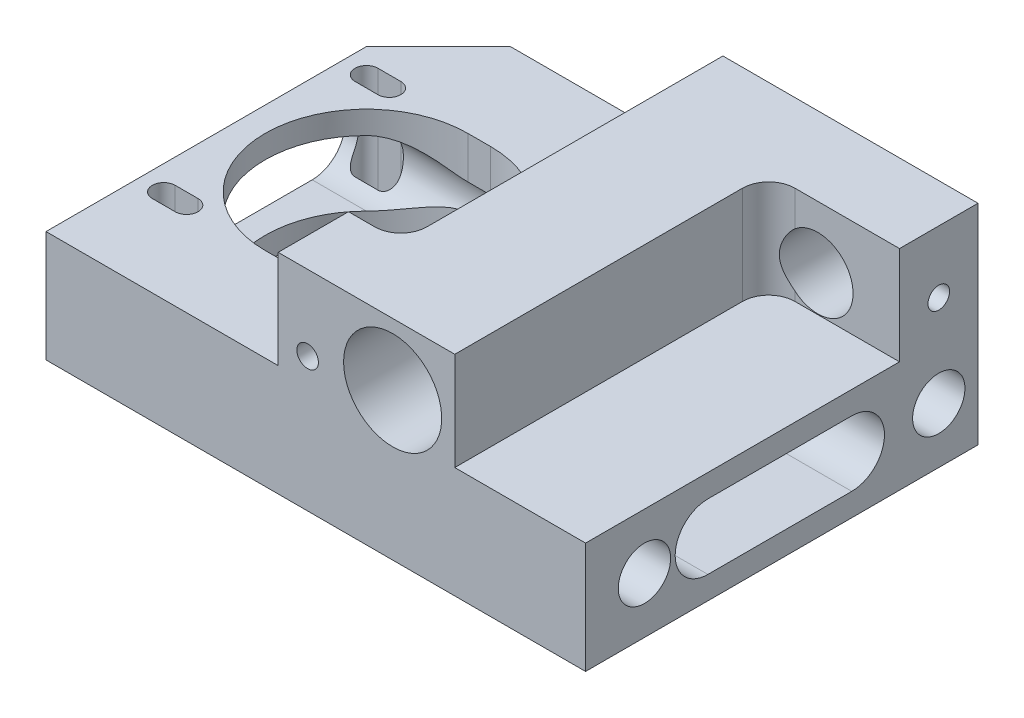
ISO-10303-21;
HEADER;
FILE_DESCRIPTION(('STEP AP214'),'2;1');
FILE_NAME('part.step','',(''),(''),'','','');
FILE_SCHEMA(('AUTOMOTIVE_DESIGN { 1 0 10303 214 1 1 1 1 }'));
ENDSEC;
DATA;
#1=APPLICATION_CONTEXT('core data for automotive mechanical design processes');
#2=APPLICATION_PROTOCOL_DEFINITION('international standard','automotive_design',2000,#1);
#3=PRODUCT_CONTEXT('',#1,'mechanical');
#4=PRODUCT('Part','Part','',(#3));
#5=PRODUCT_RELATED_PRODUCT_CATEGORY('part','',(#4));
#6=PRODUCT_DEFINITION_FORMATION('','',#4);
#7=PRODUCT_DEFINITION_CONTEXT('part definition',#1,'design');
#8=PRODUCT_DEFINITION('design','',#6,#7);
#9=PRODUCT_DEFINITION_SHAPE('','',#8);
#10=(LENGTH_UNIT() NAMED_UNIT(*) SI_UNIT(.MILLI.,.METRE.));
#11=(NAMED_UNIT(*) PLANE_ANGLE_UNIT() SI_UNIT($,.RADIAN.));
#12=(NAMED_UNIT(*) SI_UNIT($,.STERADIAN.) SOLID_ANGLE_UNIT());
#13=UNCERTAINTY_MEASURE_WITH_UNIT(LENGTH_MEASURE(1.E-05),#10,'distance_accuracy_value','');
#14=(GEOMETRIC_REPRESENTATION_CONTEXT(3) GLOBAL_UNCERTAINTY_ASSIGNED_CONTEXT((#13)) GLOBAL_UNIT_ASSIGNED_CONTEXT((#10,
#11,#12)) REPRESENTATION_CONTEXT('',''));
#15=CARTESIAN_POINT('',(0.,0.,0.));
#16=DIRECTION('',(0.,0.,1.));
#17=DIRECTION('',(1.,0.,0.));
#18=AXIS2_PLACEMENT_3D('',#15,#16,#17);
#19=CARTESIAN_POINT('',(3.75,32.,-43.5));
#20=DIRECTION('',(0.,0.,-1.));
#21=DIRECTION('',(-1.,0.,0.));
#22=AXIS2_PLACEMENT_3D('',#19,#20,#21);
#23=PLANE('',#22);
#24=DIRECTION('',(1.,0.,0.));
#25=VECTOR('',#24,1.);
#26=CARTESIAN_POINT('',(0.,12.6424630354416,-43.5));
#27=LINE('',#26,#25);
#28=CARTESIAN_POINT('',(3.75,12.6424630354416,-43.5));
#29=VERTEX_POINT('',#28);
#30=CARTESIAN_POINT('',(7.25,12.6424630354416,-43.5));
#31=VERTEX_POINT('',#30);
#32=EDGE_CURVE('E550',#29,#31,#27,.T.);
#33=ORIENTED_EDGE('',*,*,#32,.F.);
#34=DIRECTION('',(0.,-1.,0.));
#35=VECTOR('',#34,1.);
#36=CARTESIAN_POINT('',(3.75,32.,-43.5));
#37=LINE('',#36,#35);
#38=CARTESIAN_POINT('',(3.75,17.,-43.5));
#39=VERTEX_POINT('',#38);
#40=EDGE_CURVE('E669',#39,#29,#37,.T.);
#41=ORIENTED_EDGE('',*,*,#40,.F.);
#42=DIRECTION('',(-1.,0.,0.));
#43=VECTOR('',#42,1.);
#44=CARTESIAN_POINT('',(3.75,17.,-43.5));
#45=LINE('',#44,#43);
#46=CARTESIAN_POINT('',(7.25,17.,-43.5));
#47=VERTEX_POINT('',#46);
#48=EDGE_CURVE('E852',#47,#39,#45,.T.);
#49=ORIENTED_EDGE('',*,*,#48,.F.);
#50=DIRECTION('',(0.,-1.,0.));
#51=VECTOR('',#50,1.);
#52=CARTESIAN_POINT('',(7.25,32.,-43.5));
#53=LINE('',#52,#51);
#54=EDGE_CURVE('E671',#47,#31,#53,.T.);
#55=ORIENTED_EDGE('',*,*,#54,.T.);
#56=EDGE_LOOP('',(#33,#41,#49,#55));
#57=FACE_BOUND('',#56,.T.);
#58=ADVANCED_FACE('F48',(#57),#23,.T.);
#59=CARTESIAN_POINT('',(34.75,32.,-43.5));
#60=DIRECTION('',(0.,0.,-1.));
#61=DIRECTION('',(-1.,0.,0.));
#62=AXIS2_PLACEMENT_3D('',#59,#60,#61);
#63=PLANE('',#62);
#64=DIRECTION('',(1.,0.,0.));
#65=VECTOR('',#64,1.);
#66=CARTESIAN_POINT('',(0.,12.6424630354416,-43.5));
#67=LINE('',#66,#65);
#68=CARTESIAN_POINT('',(34.75,12.6424630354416,-43.5));
#69=VERTEX_POINT('',#68);
#70=CARTESIAN_POINT('',(38.25,12.6424630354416,-43.5));
#71=VERTEX_POINT('',#70);
#72=EDGE_CURVE('E1213',#69,#71,#67,.T.);
#73=ORIENTED_EDGE('',*,*,#72,.F.);
#74=DIRECTION('',(0.,-1.,0.));
#75=VECTOR('',#74,1.);
#76=CARTESIAN_POINT('',(34.75,32.,-43.5));
#77=LINE('',#76,#75);
#78=CARTESIAN_POINT('',(34.75,17.,-43.5));
#79=VERTEX_POINT('',#78);
#80=EDGE_CURVE('E952',#79,#69,#77,.T.);
#81=ORIENTED_EDGE('',*,*,#80,.F.);
#82=DIRECTION('',(-1.,0.,0.));
#83=VECTOR('',#82,1.);
#84=CARTESIAN_POINT('',(34.75,17.,-43.5));
#85=LINE('',#84,#83);
#86=CARTESIAN_POINT('',(38.25,17.,-43.5));
#87=VERTEX_POINT('',#86);
#88=EDGE_CURVE('E844',#87,#79,#85,.T.);
#89=ORIENTED_EDGE('',*,*,#88,.F.);
#90=DIRECTION('',(0.,-1.,0.));
#91=VECTOR('',#90,1.);
#92=CARTESIAN_POINT('',(38.25,32.,-43.5));
#93=LINE('',#92,#91);
#94=EDGE_CURVE('E948',#87,#71,#93,.T.);
#95=ORIENTED_EDGE('',*,*,#94,.T.);
#96=EDGE_LOOP('',(#73,#81,#89,#95));
#97=FACE_BOUND('',#96,.T.);
#98=ADVANCED_FACE('F648',(#97),#63,.T.);
#99=CARTESIAN_POINT('',(34.7500000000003,32.,-16.));
#100=DIRECTION('',(0.,0.,1.));
#101=DIRECTION('',(1.,0.,0.));
#102=AXIS2_PLACEMENT_3D('',#99,#100,#101);
#103=PLANE('',#102);
#104=DIRECTION('',(1.,0.,0.));
#105=VECTOR('',#104,1.);
#106=CARTESIAN_POINT('',(0.,4.29167491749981,-16.));
#107=LINE('',#106,#105);
#108=CARTESIAN_POINT('',(34.7500000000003,4.29167491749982,-16.));
#109=VERTEX_POINT('',#108);
#110=CARTESIAN_POINT('',(38.2500000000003,4.29167491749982,-16.));
#111=VERTEX_POINT('',#110);
#112=EDGE_CURVE('E1141',#109,#111,#107,.T.);
#113=ORIENTED_EDGE('',*,*,#112,.F.);
#114=DIRECTION('',(0.,-1.,0.));
#115=VECTOR('',#114,1.);
#116=CARTESIAN_POINT('',(34.7500000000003,32.,-16.));
#117=LINE('',#116,#115);
#118=CARTESIAN_POINT('',(34.7500000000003,0.,-16.));
#119=VERTEX_POINT('',#118);
#120=EDGE_CURVE('E919',#109,#119,#117,.T.);
#121=ORIENTED_EDGE('',*,*,#120,.T.);
#122=DIRECTION('',(-1.,0.,0.));
#123=VECTOR('',#122,1.);
#124=CARTESIAN_POINT('',(34.7500000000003,0.,-16.));
#125=LINE('',#124,#123);
#126=CARTESIAN_POINT('',(38.2500000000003,0.,-16.));
#127=VERTEX_POINT('',#126);
#128=EDGE_CURVE('E916',#127,#119,#125,.T.);
#129=ORIENTED_EDGE('',*,*,#128,.F.);
#130=DIRECTION('',(0.,-1.,0.));
#131=VECTOR('',#130,1.);
#132=CARTESIAN_POINT('',(38.2500000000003,32.,-16.));
#133=LINE('',#132,#131);
#134=EDGE_CURVE('E923',#111,#127,#133,.T.);
#135=ORIENTED_EDGE('',*,*,#134,.F.);
#136=EDGE_LOOP('',(#113,#121,#129,#135));
#137=FACE_BOUND('',#136,.T.);
#138=ADVANCED_FACE('F662',(#137),#103,.T.);
#139=CARTESIAN_POINT('',(3.75000000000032,32.,-16.));
#140=DIRECTION('',(0.,0.,1.));
#141=DIRECTION('',(1.,0.,0.));
#142=AXIS2_PLACEMENT_3D('',#139,#140,#141);
#143=PLANE('',#142);
#144=DIRECTION('',(1.,0.,0.));
#145=VECTOR('',#144,1.);
#146=CARTESIAN_POINT('',(0.,4.29167491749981,-16.));
#147=LINE('',#146,#145);
#148=CARTESIAN_POINT('',(3.75000000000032,4.29167491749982,-16.));
#149=VERTEX_POINT('',#148);
#150=CARTESIAN_POINT('',(7.25000000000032,4.29167491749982,-16.));
#151=VERTEX_POINT('',#150);
#152=EDGE_CURVE('E1162',#149,#151,#147,.T.);
#153=ORIENTED_EDGE('',*,*,#152,.F.);
#154=DIRECTION('',(0.,-1.,0.));
#155=VECTOR('',#154,1.);
#156=CARTESIAN_POINT('',(3.75000000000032,32.,-16.));
#157=LINE('',#156,#155);
#158=CARTESIAN_POINT('',(3.75000000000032,0.,-16.));
#159=VERTEX_POINT('',#158);
#160=EDGE_CURVE('E895',#149,#159,#157,.T.);
#161=ORIENTED_EDGE('',*,*,#160,.T.);
#162=DIRECTION('',(-1.,0.,0.));
#163=VECTOR('',#162,1.);
#164=CARTESIAN_POINT('',(3.75000000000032,0.,-16.));
#165=LINE('',#164,#163);
#166=CARTESIAN_POINT('',(7.25000000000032,0.,-16.));
#167=VERTEX_POINT('',#166);
#168=EDGE_CURVE('E892',#167,#159,#165,.T.);
#169=ORIENTED_EDGE('',*,*,#168,.F.);
#170=DIRECTION('',(0.,-1.,0.));
#171=VECTOR('',#170,1.);
#172=CARTESIAN_POINT('',(7.25000000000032,32.,-16.));
#173=LINE('',#172,#171);
#174=EDGE_CURVE('E899',#151,#167,#173,.T.);
#175=ORIENTED_EDGE('',*,*,#174,.F.);
#176=EDGE_LOOP('',(#153,#161,#169,#175));
#177=FACE_BOUND('',#176,.T.);
#178=ADVANCED_FACE('F1191',(#177),#143,.T.);
#179=CARTESIAN_POINT('',(19.25,32.,-29.75));
#180=DIRECTION('',(0.,-1.,0.));
#181=DIRECTION('',(0.,0.,-1.));
#182=AXIS2_PLACEMENT_3D('',#179,#180,#181);
#183=CYLINDRICAL_SURFACE('',#182,15.5);
#184=CARTESIAN_POINT('',(8.38043239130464,13.5,-18.7));
#185=CARTESIAN_POINT('',(8.4815539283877,13.4999958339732,-18.6005261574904));
#186=CARTESIAN_POINT('',(8.58401958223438,13.4970320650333,-18.5024688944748));
#187=CARTESIAN_POINT('',(8.79140811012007,13.4856565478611,-18.3093746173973));
#188=CARTESIAN_POINT('',(8.89633021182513,13.4772464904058,-18.2143366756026));
#189=CARTESIAN_POINT('',(9.21406984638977,13.4445976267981,-17.9343467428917));
#190=CARTESIAN_POINT('',(9.4303013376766,13.4129359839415,-17.7540855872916));
#191=CARTESIAN_POINT('',(9.86827600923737,13.3335700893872,-17.4085897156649));
#192=CARTESIAN_POINT('',(10.089951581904,13.2860136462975,-17.2432337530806));
#193=CARTESIAN_POINT('',(10.5397423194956,13.1776845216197,-16.9259123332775));
#194=CARTESIAN_POINT('',(10.7678618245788,13.1169027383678,-16.7739561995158));
#195=CARTESIAN_POINT('',(11.3557482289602,12.9486466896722,-16.404264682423));
#196=CARTESIAN_POINT('',(11.7193509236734,12.8338046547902,-16.195946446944));
#197=CARTESIAN_POINT('',(12.4575879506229,12.5875086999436,-15.8113286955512));
#198=CARTESIAN_POINT('',(12.8322254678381,12.4560499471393,-15.6350385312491));
#199=CARTESIAN_POINT('',(13.5926354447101,12.1844670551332,-15.313411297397));
#200=CARTESIAN_POINT('',(13.9784315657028,12.0443236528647,-15.1681464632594));
#201=CARTESIAN_POINT('',(14.5651461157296,11.8350281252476,-14.9735128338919));
#202=CARTESIAN_POINT('',(14.7621051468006,11.765398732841,-14.9124997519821));
#203=CARTESIAN_POINT('',(15.1588783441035,11.6279697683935,-14.7982324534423));
#204=CARTESIAN_POINT('',(15.3586923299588,11.5601700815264,-14.7449777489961));
#205=CARTESIAN_POINT('',(15.8533887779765,11.3979839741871,-14.6237226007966));
#206=CARTESIAN_POINT('',(16.1500372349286,11.3055868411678,-14.5600859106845));
#207=CARTESIAN_POINT('',(16.6001868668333,11.1781359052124,-14.477420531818));
#208=CARTESIAN_POINT('',(16.7509675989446,11.1375398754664,-14.4520133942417));
#209=CARTESIAN_POINT('',(17.0544269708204,11.0611413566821,-14.4055213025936));
#210=CARTESIAN_POINT('',(17.2071057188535,11.0253391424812,-14.3844365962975));
#211=CARTESIAN_POINT('',(17.5147154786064,10.9596511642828,-14.3466608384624));
#212=CARTESIAN_POINT('',(17.6696514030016,10.9297813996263,-14.3299816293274));
#213=CARTESIAN_POINT('',(17.9811541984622,10.8773332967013,-14.3012300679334));
#214=CARTESIAN_POINT('',(18.1377206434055,10.8547531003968,-14.2891565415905));
#215=CARTESIAN_POINT('',(18.4531271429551,10.8179292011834,-14.269687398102));
#216=CARTESIAN_POINT('',(18.611975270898,10.8037379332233,-14.2623211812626));
#217=CARTESIAN_POINT('',(18.9305344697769,10.7846224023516,-14.2524692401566));
#218=CARTESIAN_POINT('',(19.0902462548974,10.7797075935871,-14.2499884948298));
#219=CARTESIAN_POINT('',(19.25,10.7798026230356,-14.25));
#220=B_SPLINE_CURVE_WITH_KNOTS('',3,(#184,#185,#186,#187,#188,#189,#190,#191,#192,#193,#194,
#195,#196,#197,#198,#199,#200,#201,#202,#203,#204,#205,#206,#207,#208,#209,#210,#211,#212,#213,
#214,#215,#216,#217,#218,#219),.UNSPECIFIED.,.F.,.F.,(4,2,2,2,2,2,2,2,2,2,2,2,2,2,2,2,2,4),(0.,
0.425438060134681,0.85074410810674,1.69950975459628,2.54059254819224,3.3822560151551,
4.68373704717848,5.98559747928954,7.29045672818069,7.94321634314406,8.59593489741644,
9.54656774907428,10.0210682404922,10.495595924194,10.9713864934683,11.4470556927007,
11.925667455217,12.4047667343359),.UNSPECIFIED.);
#221=CARTESIAN_POINT('',(8.38043239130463,13.5,-18.7));
#222=VERTEX_POINT('',#221);
#223=CARTESIAN_POINT('',(19.25,10.7798026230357,-14.25));
#224=VERTEX_POINT('',#223);
#225=EDGE_CURVE('E588',#222,#224,#220,.T.);
#226=ORIENTED_EDGE('',*,*,#225,.F.);
#227=CARTESIAN_POINT('',(19.25,13.5,-29.75));
#228=DIRECTION('',(0.,1.,0.));
#229=DIRECTION('',(0.,0.,1.));
#230=AXIS2_PLACEMENT_3D('',#227,#228,#229);
#231=CIRCLE('',#230,15.5);
#232=CARTESIAN_POINT('',(8.2796991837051,13.5,-40.7));
#233=VERTEX_POINT('',#232);
#234=EDGE_CURVE('E552',#233,#222,#231,.T.);
#235=ORIENTED_EDGE('',*,*,#234,.F.);
#236=CARTESIAN_POINT('',(19.25,10.5730412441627,-45.25));
#237=CARTESIAN_POINT('',(19.1429355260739,10.5730192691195,-45.2500020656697));
#238=CARTESIAN_POINT('',(19.0358907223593,10.5754778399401,-45.2488904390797));
#239=CARTESIAN_POINT('',(18.8221011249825,10.5851665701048,-45.2444608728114));
#240=CARTESIAN_POINT('',(18.7153562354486,10.5923949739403,-45.2411437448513));
#241=CARTESIAN_POINT('',(18.3966252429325,10.6208838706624,-45.2279468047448));
#242=CARTESIAN_POINT('',(18.185354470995,10.6489507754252,-45.2148210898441));
#243=CARTESIAN_POINT('',(17.7680880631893,10.7197896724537,-45.180405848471));
#244=CARTESIAN_POINT('',(17.5620619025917,10.7624253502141,-45.1591917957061));
#245=CARTESIAN_POINT('',(17.1534315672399,10.8588689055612,-45.1089331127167));
#246=CARTESIAN_POINT('',(16.9508313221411,10.912688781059,-45.0798800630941));
#247=CARTESIAN_POINT('',(16.5437588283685,11.0297502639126,-45.0133528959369));
#248=CARTESIAN_POINT('',(16.3393831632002,11.0932066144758,-44.9756730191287));
#249=CARTESIAN_POINT('',(15.9339688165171,11.2255555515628,-44.8925481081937));
#250=CARTESIAN_POINT('',(15.7329309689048,11.2944494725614,-44.8471011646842));
#251=CARTESIAN_POINT('',(15.3337782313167,11.4354593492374,-44.7485162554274));
#252=CARTESIAN_POINT('',(15.1356649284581,11.5075769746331,-44.6953742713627));
#253=CARTESIAN_POINT('',(14.7421815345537,11.6532549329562,-44.5814366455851));
#254=CARTESIAN_POINT('',(14.5468117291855,11.7268154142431,-44.5206402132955));
#255=CARTESIAN_POINT('',(13.9616927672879,11.9485420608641,-44.3257942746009));
#256=CARTESIAN_POINT('',(13.5757808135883,12.0967018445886,-44.1799915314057));
#257=CARTESIAN_POINT('',(12.8140804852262,12.3835329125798,-43.856731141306));
#258=CARTESIAN_POINT('',(12.4382852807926,12.5222107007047,-43.6792954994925));
#259=CARTESIAN_POINT('',(11.7984605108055,12.7466616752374,-43.344740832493));
#260=CARTESIAN_POINT('',(11.5318785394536,12.8365540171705,-43.1952600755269));
#261=CARTESIAN_POINT('',(11.0050849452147,13.0038657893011,-42.8788149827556));
#262=CARTESIAN_POINT('',(10.7448747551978,13.0812824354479,-42.7118467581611));
#263=CARTESIAN_POINT('',(10.2334506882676,13.2196456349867,-42.3613994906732));
#264=CARTESIAN_POINT('',(9.98219479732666,13.2806814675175,-42.1780175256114));
#265=CARTESIAN_POINT('',(9.4888280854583,13.3827958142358,-41.7943756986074));
#266=CARTESIAN_POINT('',(9.24670949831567,13.4238916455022,-41.5941306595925));
#267=CARTESIAN_POINT('',(8.88516801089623,13.467955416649,-41.2759706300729));
#268=CARTESIAN_POINT('',(8.7617417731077,13.4797644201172,-41.1637758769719));
#269=CARTESIAN_POINT('',(8.51814517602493,13.4957880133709,-40.9350471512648));
#270=CARTESIAN_POINT('',(8.39797970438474,13.4999917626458,-40.8185072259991));
#271=CARTESIAN_POINT('',(8.2796991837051,13.5,-40.7));
#272=B_SPLINE_CURVE_WITH_KNOTS('',3,(#236,#237,#238,#239,#240,#241,#242,#243,#244,#245,#246,
#247,#248,#249,#250,#251,#252,#253,#254,#255,#256,#257,#258,#259,#260,#261,#262,#263,#264,#265,
#266,#267,#268,#269,#270,#271),.UNSPECIFIED.,.F.,.F.,(4,2,2,2,2,2,2,2,2,2,2,2,2,2,2,2,2,4),(0.,
0.321123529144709,0.642128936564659,1.28178492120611,1.91561272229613,2.55012400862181,
3.20172730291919,3.85349101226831,4.50559630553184,5.15776900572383,6.47143674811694,
7.78419419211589,8.73924515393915,9.69450894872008,10.6444554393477,11.5935754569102,
12.0949900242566,12.5971187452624),.UNSPECIFIED.);
#273=CARTESIAN_POINT('',(19.25,10.5730412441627,-45.25));
#274=VERTEX_POINT('',#273);
#275=EDGE_CURVE('E467',#274,#233,#272,.T.);
#276=ORIENTED_EDGE('',*,*,#275,.F.);
#277=DIRECTION('',(0.,-1.,0.));
#278=VECTOR('',#277,1.);
#279=CARTESIAN_POINT('',(19.25,32.,-45.25));
#280=LINE('',#279,#278);
#281=CARTESIAN_POINT('',(19.25,17.,-45.25));
#282=VERTEX_POINT('',#281);
#283=EDGE_CURVE('E868',#282,#274,#280,.T.);
#284=ORIENTED_EDGE('',*,*,#283,.F.);
#285=CARTESIAN_POINT('',(19.25,17.,-29.75));
#286=DIRECTION('',(0.,-1.,0.));
#287=DIRECTION('',(0.,0.,-1.));
#288=AXIS2_PLACEMENT_3D('',#285,#286,#287);
#289=CIRCLE('',#288,15.5);
#290=CARTESIAN_POINT('',(19.25,17.,-14.25));
#291=VERTEX_POINT('',#290);
#292=EDGE_CURVE('E822',#291,#282,#289,.T.);
#293=ORIENTED_EDGE('',*,*,#292,.F.);
#294=DIRECTION('',(0.,-1.,0.));
#295=VECTOR('',#294,1.);
#296=CARTESIAN_POINT('',(19.25,32.,-14.25));
#297=LINE('',#296,#295);
#298=EDGE_CURVE('E880',#291,#224,#297,.T.);
#299=ORIENTED_EDGE('',*,*,#298,.T.);
#300=EDGE_LOOP('',(#226,#235,#276,#284,#293,#299));
#301=FACE_BOUND('',#300,.T.);
#302=ADVANCED_FACE('F1016',(#301),#183,.F.);
#303=CARTESIAN_POINT('',(19.25,32.,-14.25));
#304=DIRECTION('',(0.,0.,-1.));
#305=DIRECTION('',(-1.,0.,0.));
#306=AXIS2_PLACEMENT_3D('',#303,#304,#305);
#307=PLANE('',#306);
#308=DIRECTION('',(1.,0.,0.));
#309=VECTOR('',#308,1.);
#310=CARTESIAN_POINT('',(0.,10.7798026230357,-14.25));
#311=LINE('',#310,#309);
#312=CARTESIAN_POINT('',(22.75,10.7798026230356,-14.25));
#313=VERTEX_POINT('',#312);
#314=EDGE_CURVE('E560',#224,#313,#311,.T.);
#315=ORIENTED_EDGE('',*,*,#314,.F.);
#316=ORIENTED_EDGE('',*,*,#298,.F.);
#317=DIRECTION('',(-1.,0.,0.));
#318=VECTOR('',#317,1.);
#319=CARTESIAN_POINT('',(19.25,17.,-14.25));
#320=LINE('',#319,#318);
#321=CARTESIAN_POINT('',(22.75,17.,-14.25));
#322=VERTEX_POINT('',#321);
#323=EDGE_CURVE('E820',#322,#291,#320,.T.);
#324=ORIENTED_EDGE('',*,*,#323,.F.);
#325=DIRECTION('',(0.,-1.,0.));
#326=VECTOR('',#325,1.);
#327=CARTESIAN_POINT('',(22.75,32.,-14.25));
#328=LINE('',#327,#326);
#329=EDGE_CURVE('E876',#322,#313,#328,.T.);
#330=ORIENTED_EDGE('',*,*,#329,.T.);
#331=EDGE_LOOP('',(#315,#316,#324,#330));
#332=FACE_BOUND('',#331,.T.);
#333=ADVANCED_FACE('F1031',(#332),#307,.T.);
#334=CARTESIAN_POINT('',(22.75,32.,-29.75));
#335=DIRECTION('',(0.,-1.,0.));
#336=DIRECTION('',(0.,0.,-1.));
#337=AXIS2_PLACEMENT_3D('',#334,#335,#336);
#338=CYLINDRICAL_SURFACE('',#337,15.5);
#339=CARTESIAN_POINT('',(22.75,10.7798026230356,-14.25));
#340=CARTESIAN_POINT('',(22.8566727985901,10.77978676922,-14.2499984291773));
#341=CARTESIAN_POINT('',(22.9633298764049,10.7819536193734,-14.2511014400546));
#342=CARTESIAN_POINT('',(23.1764029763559,10.7905145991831,-14.2555002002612));
#343=CARTESIAN_POINT('',(23.2828190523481,10.7969076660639,-14.2587953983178));
#344=CARTESIAN_POINT('',(23.6008735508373,10.8221732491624,-14.2719207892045));
#345=CARTESIAN_POINT('',(23.8119211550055,10.8471336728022,-14.284990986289));
#346=CARTESIAN_POINT('',(24.2292950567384,10.9106228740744,-14.3193422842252));
#347=CARTESIAN_POINT('',(24.4356464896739,10.9490312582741,-14.3405506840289));
#348=CARTESIAN_POINT('',(24.8452244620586,11.0365340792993,-14.3908774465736));
#349=CARTESIAN_POINT('',(25.0484483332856,11.0856371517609,-14.420002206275));
#350=CARTESIAN_POINT('',(25.4554916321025,11.1927067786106,-14.4865246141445));
#351=CARTESIAN_POINT('',(25.6592450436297,11.250827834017,-14.5240728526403));
#352=CARTESIAN_POINT('',(26.0635174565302,11.3726362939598,-14.6069095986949));
#353=CARTESIAN_POINT('',(26.2640356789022,11.4363250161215,-14.6521999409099));
#354=CARTESIAN_POINT('',(26.6621759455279,11.5671866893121,-14.7504350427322));
#355=CARTESIAN_POINT('',(26.8597960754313,11.6343618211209,-14.8033846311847));
#356=CARTESIAN_POINT('',(27.2522444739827,11.7704515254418,-14.9168780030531));
#357=CARTESIAN_POINT('',(27.4470724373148,11.8393662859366,-14.9774226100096));
#358=CARTESIAN_POINT('',(28.0303465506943,12.0474992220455,-15.1713594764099));
#359=CARTESIAN_POINT('',(28.4148393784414,12.1871606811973,-15.3163772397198));
#360=CARTESIAN_POINT('',(29.1733618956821,12.4580205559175,-15.6376004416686));
#361=CARTESIAN_POINT('',(29.5473987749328,12.5892248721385,-15.8137838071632));
#362=CARTESIAN_POINT('',(30.1887066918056,12.8030907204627,-16.148152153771));
#363=CARTESIAN_POINT('',(30.4584824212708,12.8895107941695,-16.2991323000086));
#364=CARTESIAN_POINT('',(30.9913322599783,13.0498158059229,-16.6188547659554));
#365=CARTESIAN_POINT('',(31.2544046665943,13.1236975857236,-16.7876015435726));
#366=CARTESIAN_POINT('',(31.7711446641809,13.2547350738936,-17.1418074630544));
#367=CARTESIAN_POINT('',(32.0248571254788,13.3119832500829,-17.327166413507));
#368=CARTESIAN_POINT('',(32.5227202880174,13.4060524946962,-17.7149147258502));
#369=CARTESIAN_POINT('',(32.7668797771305,13.4428927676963,-17.9172878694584));
#370=CARTESIAN_POINT('',(33.1099271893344,13.4777726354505,-18.2199765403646));
#371=CARTESIAN_POINT('',(33.2135070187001,13.4859857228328,-18.3138909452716));
#372=CARTESIAN_POINT('',(33.4183523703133,13.4971004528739,-18.5047396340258));
#373=CARTESIAN_POINT('',(33.5196151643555,13.4999961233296,-18.6016771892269));
#374=CARTESIAN_POINT('',(33.6195676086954,13.5,-18.7));
#375=B_SPLINE_CURVE_WITH_KNOTS('',3,(#339,#340,#341,#342,#343,#344,#345,#346,#347,#348,#349,
#350,#351,#352,#353,#354,#355,#356,#357,#358,#359,#360,#361,#362,#363,#364,#365,#366,#367,#368,
#369,#370,#371,#372,#373,#374),.UNSPECIFIED.,.F.,.F.,(4,2,2,2,2,2,2,2,2,2,2,2,2,2,2,2,2,4),(0.,
0.319961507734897,0.639842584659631,1.27780248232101,1.9101911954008,2.54309244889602,
3.18836576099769,3.83379219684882,4.47962733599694,5.12553256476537,6.42626011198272,
7.72607007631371,8.68838148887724,9.65093493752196,10.6080303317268,11.5642235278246,
11.9842650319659,12.4047780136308),.UNSPECIFIED.);
#376=CARTESIAN_POINT('',(33.6195676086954,13.5,-18.7));
#377=VERTEX_POINT('',#376);
#378=EDGE_CURVE('E13',#313,#377,#375,.T.);
#379=ORIENTED_EDGE('',*,*,#378,.F.);
#380=ORIENTED_EDGE('',*,*,#329,.F.);
#381=CARTESIAN_POINT('',(22.75,17.,-29.75));
#382=DIRECTION('',(0.,-1.,0.));
#383=DIRECTION('',(0.,0.,-1.));
#384=AXIS2_PLACEMENT_3D('',#381,#382,#383);
#385=CIRCLE('',#384,15.5);
#386=CARTESIAN_POINT('',(22.75,17.,-45.25));
#387=VERTEX_POINT('',#386);
#388=EDGE_CURVE('E808',#387,#322,#385,.T.);
#389=ORIENTED_EDGE('',*,*,#388,.F.);
#390=DIRECTION('',(0.,-1.,0.));
#391=VECTOR('',#390,1.);
#392=CARTESIAN_POINT('',(22.75,32.,-45.25));
#393=LINE('',#392,#391);
#394=CARTESIAN_POINT('',(22.75,10.5730412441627,-45.25));
#395=VERTEX_POINT('',#394);
#396=EDGE_CURVE('E872',#387,#395,#393,.T.);
#397=ORIENTED_EDGE('',*,*,#396,.T.);
#398=CARTESIAN_POINT('',(33.7203008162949,13.5,-40.7));
#399=CARTESIAN_POINT('',(33.621347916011,13.4999960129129,-40.7991398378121));
#400=CARTESIAN_POINT('',(33.5210718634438,13.4970519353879,-40.8969101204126));
#401=CARTESIAN_POINT('',(33.3181002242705,13.4857379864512,-41.0895243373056));
#402=CARTESIAN_POINT('',(33.2154053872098,13.4773697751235,-41.18436915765));
#403=CARTESIAN_POINT('',(32.9043805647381,13.444853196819,-41.4639290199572));
#404=CARTESIAN_POINT('',(32.6926893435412,13.4132889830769,-41.6440908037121));
#405=CARTESIAN_POINT('',(32.2644784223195,13.3341284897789,-41.9892602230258));
#406=CARTESIAN_POINT('',(32.0480452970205,13.2867259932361,-42.1544217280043));
#407=CARTESIAN_POINT('',(31.6089206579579,13.1785688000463,-42.4717516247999));
#408=CARTESIAN_POINT('',(31.38622523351,13.1178055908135,-42.6239116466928));
#409=CARTESIAN_POINT('',(30.8145675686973,12.9498970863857,-42.9932138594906));
#410=CARTESIAN_POINT('',(30.4619757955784,12.8353596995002,-43.2014104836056));
#411=CARTESIAN_POINT('',(29.7463722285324,12.5886310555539,-43.5871310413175));
#412=CARTESIAN_POINT('',(29.3833558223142,12.4564318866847,-43.7646411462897));
#413=CARTESIAN_POINT('',(28.64489234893,12.1806196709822,-44.0910110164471));
#414=CARTESIAN_POINT('',(28.2693674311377,12.0369214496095,-44.2396223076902));
#415=CARTESIAN_POINT('',(27.6989752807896,11.8198782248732,-44.4400714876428));
#416=CARTESIAN_POINT('',(27.5076832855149,11.747289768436,-44.5031371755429));
#417=CARTESIAN_POINT('',(27.1225249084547,11.6028851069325,-44.6218404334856));
#418=CARTESIAN_POINT('',(26.9286587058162,11.5310688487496,-44.67747851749));
#419=CARTESIAN_POINT('',(26.482222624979,11.3694698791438,-44.7961985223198));
#420=CARTESIAN_POINT('',(26.2287320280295,11.2804279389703,-44.8568532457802));
#421=CARTESIAN_POINT('',(25.7163177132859,11.1102546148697,-44.9657675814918));
#422=CARTESIAN_POINT('',(25.4573920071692,11.0291261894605,-45.0140225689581));
#423=CARTESIAN_POINT('',(24.935908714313,10.8812847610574,-45.0973415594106));
#424=CARTESIAN_POINT('',(24.6734065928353,10.8144457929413,-45.1325230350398));
#425=CARTESIAN_POINT('',(24.1426472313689,10.7016996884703,-45.1896084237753));
#426=CARTESIAN_POINT('',(23.8743990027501,10.6557619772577,-45.211531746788));
#427=CARTESIAN_POINT('',(23.4628992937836,10.6073620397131,-45.2342435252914));
#428=CARTESIAN_POINT('',(23.3211156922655,10.5946143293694,-45.2401252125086));
#429=CARTESIAN_POINT('',(23.0362410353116,10.5773966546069,-45.2480167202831));
#430=CARTESIAN_POINT('',(22.8931469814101,10.57296792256,-45.2500072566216));
#431=CARTESIAN_POINT('',(22.75,10.5730412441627,-45.25));
#432=B_SPLINE_CURVE_WITH_KNOTS('',3,(#398,#399,#400,#401,#402,#403,#404,#405,#406,#407,#408,
#409,#410,#411,#412,#413,#414,#415,#416,#417,#418,#419,#420,#421,#422,#423,#424,#425,#426,#427,
#428,#429,#430,#431),.UNSPECIFIED.,.F.,.F.,(4,2,2,2,2,2,2,2,2,2,2,2,2,2,2,2,4),(0.,
0.420116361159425,0.840104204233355,1.67829994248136,2.50659449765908,3.33541832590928,
4.60900679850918,5.88316771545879,7.16784154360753,7.81002784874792,8.45216969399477,
9.27809999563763,10.1043379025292,10.9229609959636,11.740382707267,12.1675381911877,
12.5968053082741),.UNSPECIFIED.);
#433=CARTESIAN_POINT('',(33.7203008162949,13.5,-40.7));
#434=VERTEX_POINT('',#433);
#435=EDGE_CURVE('E454',#434,#395,#432,.T.);
#436=ORIENTED_EDGE('',*,*,#435,.F.);
#437=CARTESIAN_POINT('',(22.75,13.5,-29.75));
#438=DIRECTION('',(0.,1.,0.));
#439=DIRECTION('',(0.,0.,1.));
#440=AXIS2_PLACEMENT_3D('',#437,#438,#439);
#441=CIRCLE('',#440,15.5);
#442=EDGE_CURVE('E61',#377,#434,#441,.T.);
#443=ORIENTED_EDGE('',*,*,#442,.F.);
#444=EDGE_LOOP('',(#379,#380,#389,#397,#436,#443));
#445=FACE_BOUND('',#444,.T.);
#446=ADVANCED_FACE('F1027',(#445),#338,.F.);
#447=CARTESIAN_POINT('',(19.25,32.,-45.25));
#448=DIRECTION('',(0.,0.,1.));
#449=DIRECTION('',(1.,0.,0.));
#450=AXIS2_PLACEMENT_3D('',#447,#448,#449);
#451=PLANE('',#450);
#452=DIRECTION('',(1.,0.,0.));
#453=VECTOR('',#452,1.);
#454=CARTESIAN_POINT('',(0.,6.42695875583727,-45.25));
#455=LINE('',#454,#453);
#456=CARTESIAN_POINT('',(19.25,6.42695875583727,-45.25));
#457=VERTEX_POINT('',#456);
#458=CARTESIAN_POINT('',(22.75,6.42695875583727,-45.25));
#459=VERTEX_POINT('',#458);
#460=EDGE_CURVE('E987',#457,#459,#455,.T.);
#461=ORIENTED_EDGE('',*,*,#460,.F.);
#462=CARTESIAN_POINT('',(19.25,0.,-45.25));
#463=VERTEX_POINT('',#462);
#464=EDGE_CURVE('E867',#457,#463,#280,.T.);
#465=ORIENTED_EDGE('',*,*,#464,.T.);
#466=DIRECTION('',(-1.,0.,0.));
#467=VECTOR('',#466,1.);
#468=CARTESIAN_POINT('',(19.25,0.,-45.25));
#469=LINE('',#468,#467);
#470=CARTESIAN_POINT('',(22.75,0.,-45.25));
#471=VERTEX_POINT('',#470);
#472=EDGE_CURVE('E864',#471,#463,#469,.T.);
#473=ORIENTED_EDGE('',*,*,#472,.F.);
#474=EDGE_CURVE('E871',#459,#471,#393,.T.);
#475=ORIENTED_EDGE('',*,*,#474,.F.);
#476=EDGE_LOOP('',(#461,#465,#473,#475));
#477=FACE_BOUND('',#476,.T.);
#478=ADVANCED_FACE('F993',(#477),#451,.T.);
#479=CARTESIAN_POINT('',(0.,32.,0.));
#480=DIRECTION('',(0.,-1.,0.));
#481=DIRECTION('',(0.,0.,-1.));
#482=AXIS2_PLACEMENT_3D('',#479,#480,#481);
#483=PLANE('',#482);
#484=DIRECTION('',(1.,0.,0.));
#485=VECTOR('',#484,1.);
#486=CARTESIAN_POINT('',(82.5,32.,0.));
#487=LINE('',#486,#485);
#488=CARTESIAN_POINT('',(35.5,32.,0.));
#489=VERTEX_POINT('',#488);
#490=CARTESIAN_POINT('',(62.5,32.,0.));
#491=VERTEX_POINT('',#490);
#492=EDGE_CURVE('E687',#489,#491,#487,.T.);
#493=ORIENTED_EDGE('',*,*,#492,.T.);
#494=DIRECTION('',(0.,0.,1.));
#495=VECTOR('',#494,1.);
#496=CARTESIAN_POINT('',(62.5,32.,0.));
#497=LINE('',#496,#495);
#498=CARTESIAN_POINT('',(62.5,32.,-44.));
#499=VERTEX_POINT('',#498);
#500=EDGE_CURVE('E766',#499,#491,#497,.T.);
#501=ORIENTED_EDGE('',*,*,#500,.F.);
#502=CARTESIAN_POINT('',(66.5,32.,-44.));
#503=DIRECTION('',(0.,1.,0.));
#504=DIRECTION('',(0.,0.,1.));
#505=AXIS2_PLACEMENT_3D('',#502,#503,#504);
#506=CIRCLE('',#505,4.);
#507=CARTESIAN_POINT('',(66.5,32.,-48.));
#508=VERTEX_POINT('',#507);
#509=EDGE_CURVE('E776',#508,#499,#506,.T.);
#510=ORIENTED_EDGE('',*,*,#509,.F.);
#511=DIRECTION('',(-1.,0.,0.));
#512=VECTOR('',#511,1.);
#513=CARTESIAN_POINT('',(66.5,32.,-48.));
#514=LINE('',#513,#512);
#515=CARTESIAN_POINT('',(82.5,32.,-48.));
#516=VERTEX_POINT('',#515);
#517=EDGE_CURVE('E1100',#516,#508,#514,.T.);
#518=ORIENTED_EDGE('',*,*,#517,.F.);
#519=DIRECTION('',(0.,0.,-1.));
#520=VECTOR('',#519,1.);
#521=CARTESIAN_POINT('',(82.5,32.,-60.));
#522=LINE('',#521,#520);
#523=CARTESIAN_POINT('',(82.5,32.,-60.));
#524=VERTEX_POINT('',#523);
#525=EDGE_CURVE('E690',#516,#524,#522,.T.);
#526=ORIENTED_EDGE('',*,*,#525,.T.);
#527=DIRECTION('',(-1.,0.,0.));
#528=VECTOR('',#527,1.);
#529=CARTESIAN_POINT('',(11.,32.,-60.));
#530=LINE('',#529,#528);
#531=CARTESIAN_POINT('',(43.5,32.,-60.));
#532=VERTEX_POINT('',#531);
#533=EDGE_CURVE('E693',#524,#532,#530,.T.);
#534=ORIENTED_EDGE('',*,*,#533,.T.);
#535=DIRECTION('',(0.,0.,-1.));
#536=VECTOR('',#535,1.);
#537=CARTESIAN_POINT('',(43.5,32.,-60.));
#538=LINE('',#537,#536);
#539=CARTESIAN_POINT('',(43.5,32.,-14.75));
#540=VERTEX_POINT('',#539);
#541=EDGE_CURVE('E802',#540,#532,#538,.T.);
#542=ORIENTED_EDGE('',*,*,#541,.F.);
#543=CARTESIAN_POINT('',(39.5,32.,-14.75));
#544=DIRECTION('',(0.,1.,0.));
#545=DIRECTION('',(0.,0.,-1.));
#546=AXIS2_PLACEMENT_3D('',#543,#544,#545);
#547=CIRCLE('',#546,4.);
#548=CARTESIAN_POINT('',(39.5,32.,-10.75));
#549=VERTEX_POINT('',#548);
#550=EDGE_CURVE('E794',#549,#540,#547,.T.);
#551=ORIENTED_EDGE('',*,*,#550,.F.);
#552=DIRECTION('',(1.,0.,0.));
#553=VECTOR('',#552,1.);
#554=CARTESIAN_POINT('',(39.5,32.,-10.75));
#555=LINE('',#554,#553);
#556=CARTESIAN_POINT('',(35.5,32.,-10.75));
#557=VERTEX_POINT('',#556);
#558=EDGE_CURVE('E791',#557,#549,#555,.T.);
#559=ORIENTED_EDGE('',*,*,#558,.F.);
#560=DIRECTION('',(0.,0.,-1.));
#561=VECTOR('',#560,1.);
#562=CARTESIAN_POINT('',(35.5,32.,-10.75));
#563=LINE('',#562,#561);
#564=EDGE_CURVE('E784',#489,#557,#563,.T.);
#565=ORIENTED_EDGE('',*,*,#564,.F.);
#566=EDGE_LOOP('',(#493,#501,#510,#518,#526,#534,#542,#551,#559,#565));
#567=FACE_BOUND('',#566,.T.);
#568=ADVANCED_FACE('F542',(#567),#483,.F.);
#569=CARTESIAN_POINT('',(0.,0.,0.));
#570=DIRECTION('',(0.,-1.,0.));
#571=DIRECTION('',(0.,0.,-1.));
#572=AXIS2_PLACEMENT_3D('',#569,#570,#571);
#573=PLANE('',#572);
#574=ORIENTED_EDGE('',*,*,#168,.T.);
#575=CARTESIAN_POINT('',(3.75000000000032,0.,-14.25));
#576=DIRECTION('',(0.,1.,0.));
#577=DIRECTION('',(0.,0.,1.));
#578=AXIS2_PLACEMENT_3D('',#575,#576,#577);
#579=CIRCLE('',#578,1.75000000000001);
#580=CARTESIAN_POINT('',(3.75000000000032,0.,-12.5));
#581=VERTEX_POINT('',#580);
#582=EDGE_CURVE('E883',#159,#581,#579,.T.);
#583=ORIENTED_EDGE('',*,*,#582,.T.);
#584=DIRECTION('',(1.,0.,0.));
#585=VECTOR('',#584,1.);
#586=CARTESIAN_POINT('',(3.75000000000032,0.,-12.5));
#587=LINE('',#586,#585);
#588=CARTESIAN_POINT('',(7.25000000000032,0.,-12.5));
#589=VERTEX_POINT('',#588);
#590=EDGE_CURVE('E886',#581,#589,#587,.T.);
#591=ORIENTED_EDGE('',*,*,#590,.T.);
#592=CARTESIAN_POINT('',(7.25000000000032,0.,-14.25));
#593=DIRECTION('',(0.,1.,0.));
#594=DIRECTION('',(0.,0.,-1.));
#595=AXIS2_PLACEMENT_3D('',#592,#593,#594);
#596=CIRCLE('',#595,1.75000000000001);
#597=EDGE_CURVE('E889',#589,#167,#596,.T.);
#598=ORIENTED_EDGE('',*,*,#597,.T.);
#599=EDGE_LOOP('',(#574,#583,#591,#598));
#600=FACE_BOUND('',#599,.T.);
#601=DIRECTION('',(-1.,0.,0.));
#602=VECTOR('',#601,1.);
#603=CARTESIAN_POINT('',(34.75,0.,-47.));
#604=LINE('',#603,#602);
#605=CARTESIAN_POINT('',(38.25,0.,-47.));
#606=VERTEX_POINT('',#605);
#607=CARTESIAN_POINT('',(34.75,0.,-47.));
#608=VERTEX_POINT('',#607);
#609=EDGE_CURVE('E940',#606,#608,#604,.T.);
#610=ORIENTED_EDGE('',*,*,#609,.T.);
#611=CARTESIAN_POINT('',(34.75,0.,-45.25));
#612=DIRECTION('',(0.,1.,0.));
#613=DIRECTION('',(0.,0.,1.));
#614=AXIS2_PLACEMENT_3D('',#611,#612,#613);
#615=CIRCLE('',#614,1.75000000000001);
#616=CARTESIAN_POINT('',(34.75,0.,-43.5));
#617=VERTEX_POINT('',#616);
#618=EDGE_CURVE('E931',#608,#617,#615,.T.);
#619=ORIENTED_EDGE('',*,*,#618,.T.);
#620=DIRECTION('',(1.,0.,0.));
#621=VECTOR('',#620,1.);
#622=CARTESIAN_POINT('',(34.75,0.,-43.5));
#623=LINE('',#622,#621);
#624=CARTESIAN_POINT('',(38.25,0.,-43.5));
#625=VERTEX_POINT('',#624);
#626=EDGE_CURVE('E934',#617,#625,#623,.T.);
#627=ORIENTED_EDGE('',*,*,#626,.T.);
#628=CARTESIAN_POINT('',(38.25,0.,-45.25));
#629=DIRECTION('',(0.,1.,0.));
#630=DIRECTION('',(0.,0.,-1.));
#631=AXIS2_PLACEMENT_3D('',#628,#629,#630);
#632=CIRCLE('',#631,1.75000000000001);
#633=EDGE_CURVE('E937',#625,#606,#632,.T.);
#634=ORIENTED_EDGE('',*,*,#633,.T.);
#635=EDGE_LOOP('',(#610,#619,#627,#634));
#636=FACE_BOUND('',#635,.T.);
#637=DIRECTION('',(1.,0.,0.));
#638=VECTOR('',#637,1.);
#639=CARTESIAN_POINT('',(82.5,0.,0.));
#640=LINE('',#639,#638);
#641=CARTESIAN_POINT('',(0.,0.,0.));
#642=VERTEX_POINT('',#641);
#643=CARTESIAN_POINT('',(82.5,0.,0.));
#644=VERTEX_POINT('',#643);
#645=EDGE_CURVE('E678',#642,#644,#640,.T.);
#646=ORIENTED_EDGE('',*,*,#645,.F.);
#647=DIRECTION('',(0.,0.,1.));
#648=VECTOR('',#647,1.);
#649=CARTESIAN_POINT('',(0.,0.,0.));
#650=LINE('',#649,#648);
#651=CARTESIAN_POINT('',(0.,0.,-49.));
#652=VERTEX_POINT('',#651);
#653=EDGE_CURVE('E691',#652,#642,#650,.T.);
#654=ORIENTED_EDGE('',*,*,#653,.F.);
#655=DIRECTION('',(-0.707106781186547,0.,0.707106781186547));
#656=VECTOR('',#655,1.);
#657=CARTESIAN_POINT('',(0.,0.,-49.));
#658=LINE('',#657,#656);
#659=CARTESIAN_POINT('',(11.,0.,-60.));
#660=VERTEX_POINT('',#659);
#661=EDGE_CURVE('E701',#660,#652,#658,.T.);
#662=ORIENTED_EDGE('',*,*,#661,.F.);
#663=DIRECTION('',(-1.,0.,0.));
#664=VECTOR('',#663,1.);
#665=CARTESIAN_POINT('',(11.,0.,-60.));
#666=LINE('',#665,#664);
#667=CARTESIAN_POINT('',(82.5,0.,-60.));
#668=VERTEX_POINT('',#667);
#669=EDGE_CURVE('E698',#668,#660,#666,.T.);
#670=ORIENTED_EDGE('',*,*,#669,.F.);
#671=DIRECTION('',(0.,0.,-1.));
#672=VECTOR('',#671,1.);
#673=CARTESIAN_POINT('',(82.5,0.,-60.));
#674=LINE('',#673,#672);
#675=EDGE_CURVE('E682',#644,#668,#674,.T.);
#676=ORIENTED_EDGE('',*,*,#675,.F.);
#677=EDGE_LOOP('',(#646,#654,#662,#670,#676));
#678=FACE_BOUND('',#677,.T.);
#679=DIRECTION('',(-1.,0.,0.));
#680=VECTOR('',#679,1.);
#681=CARTESIAN_POINT('',(3.75,0.,-47.));
#682=LINE('',#681,#680);
#683=CARTESIAN_POINT('',(7.25,0.,-47.));
#684=VERTEX_POINT('',#683);
#685=CARTESIAN_POINT('',(3.75,0.,-47.));
#686=VERTEX_POINT('',#685);
#687=EDGE_CURVE('E964',#684,#686,#682,.T.);
#688=ORIENTED_EDGE('',*,*,#687,.T.);
#689=CARTESIAN_POINT('',(3.75,0.,-45.25));
#690=DIRECTION('',(0.,1.,0.));
#691=DIRECTION('',(0.,0.,1.));
#692=AXIS2_PLACEMENT_3D('',#689,#690,#691);
#693=CIRCLE('',#692,1.75000000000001);
#694=CARTESIAN_POINT('',(3.75,0.,-43.5));
#695=VERTEX_POINT('',#694);
#696=EDGE_CURVE('E955',#686,#695,#693,.T.);
#697=ORIENTED_EDGE('',*,*,#696,.T.);
#698=DIRECTION('',(1.,0.,0.));
#699=VECTOR('',#698,1.);
#700=CARTESIAN_POINT('',(3.75,0.,-43.5));
#701=LINE('',#700,#699);
#702=CARTESIAN_POINT('',(7.25,0.,-43.5));
#703=VERTEX_POINT('',#702);
#704=EDGE_CURVE('E958',#695,#703,#701,.T.);
#705=ORIENTED_EDGE('',*,*,#704,.T.);
#706=CARTESIAN_POINT('',(7.25,0.,-45.25));
#707=DIRECTION('',(0.,1.,0.));
#708=DIRECTION('',(0.,0.,-1.));
#709=AXIS2_PLACEMENT_3D('',#706,#707,#708);
#710=CIRCLE('',#709,1.75000000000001);
#711=EDGE_CURVE('E961',#703,#684,#710,.T.);
#712=ORIENTED_EDGE('',*,*,#711,.T.);
#713=EDGE_LOOP('',(#688,#697,#705,#712));
#714=FACE_BOUND('',#713,.T.);
#715=ORIENTED_EDGE('',*,*,#128,.T.);
#716=CARTESIAN_POINT('',(34.7500000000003,0.,-14.25));
#717=DIRECTION('',(0.,1.,0.));
#718=DIRECTION('',(0.,0.,1.));
#719=AXIS2_PLACEMENT_3D('',#716,#717,#718);
#720=CIRCLE('',#719,1.75000000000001);
#721=CARTESIAN_POINT('',(34.7500000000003,0.,-12.5));
#722=VERTEX_POINT('',#721);
#723=EDGE_CURVE('E907',#119,#722,#720,.T.);
#724=ORIENTED_EDGE('',*,*,#723,.T.);
#725=DIRECTION('',(1.,0.,0.));
#726=VECTOR('',#725,1.);
#727=CARTESIAN_POINT('',(34.7500000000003,0.,-12.5));
#728=LINE('',#727,#726);
#729=CARTESIAN_POINT('',(38.2500000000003,0.,-12.5));
#730=VERTEX_POINT('',#729);
#731=EDGE_CURVE('E910',#722,#730,#728,.T.);
#732=ORIENTED_EDGE('',*,*,#731,.T.);
#733=CARTESIAN_POINT('',(38.2500000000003,0.,-14.25));
#734=DIRECTION('',(0.,1.,0.));
#735=DIRECTION('',(0.,0.,-1.));
#736=AXIS2_PLACEMENT_3D('',#733,#734,#735);
#737=CIRCLE('',#736,1.75000000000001);
#738=EDGE_CURVE('E913',#730,#127,#737,.T.);
#739=ORIENTED_EDGE('',*,*,#738,.T.);
#740=EDGE_LOOP('',(#715,#724,#732,#739));
#741=FACE_BOUND('',#740,.T.);
#742=ORIENTED_EDGE('',*,*,#472,.T.);
#743=CARTESIAN_POINT('',(19.25,0.,-29.75));
#744=DIRECTION('',(0.,1.,0.));
#745=DIRECTION('',(0.,0.,1.));
#746=AXIS2_PLACEMENT_3D('',#743,#744,#745);
#747=CIRCLE('',#746,15.5);
#748=CARTESIAN_POINT('',(19.25,0.,-14.25));
#749=VERTEX_POINT('',#748);
#750=EDGE_CURVE('E855',#463,#749,#747,.T.);
#751=ORIENTED_EDGE('',*,*,#750,.T.);
#752=DIRECTION('',(1.,0.,0.));
#753=VECTOR('',#752,1.);
#754=CARTESIAN_POINT('',(19.25,0.,-14.25));
#755=LINE('',#754,#753);
#756=CARTESIAN_POINT('',(22.75,0.,-14.25));
#757=VERTEX_POINT('',#756);
#758=EDGE_CURVE('E858',#749,#757,#755,.T.);
#759=ORIENTED_EDGE('',*,*,#758,.T.);
#760=CARTESIAN_POINT('',(22.75,0.,-29.75));
#761=DIRECTION('',(0.,1.,0.));
#762=DIRECTION('',(0.,0.,1.));
#763=AXIS2_PLACEMENT_3D('',#760,#761,#762);
#764=CIRCLE('',#763,15.5);
#765=EDGE_CURVE('E861',#757,#471,#764,.T.);
#766=ORIENTED_EDGE('',*,*,#765,.T.);
#767=EDGE_LOOP('',(#742,#751,#759,#766));
#768=FACE_BOUND('',#767,.T.);
#769=ADVANCED_FACE('F978',(#600,#636,#678,#714,#741,#768),#573,.T.);
#770=CARTESIAN_POINT('',(82.5,32.,0.));
#771=DIRECTION('',(0.,0.,-1.));
#772=DIRECTION('',(-1.,0.,0.));
#773=AXIS2_PLACEMENT_3D('',#770,#771,#772);
#774=PLANE('',#773);
#775=CARTESIAN_POINT('',(40.,20.5,0.));
#776=DIRECTION('',(0.,0.,1.));
#777=DIRECTION('',(1.,0.,0.));
#778=AXIS2_PLACEMENT_3D('',#775,#776,#777);
#779=CIRCLE('',#778,1.64999999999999);
#780=CARTESIAN_POINT('',(41.65,20.5,0.));
#781=VERTEX_POINT('',#780);
#782=EDGE_CURVE('E1127',#781,#781,#779,.T.);
#783=ORIENTED_EDGE('',*,*,#782,.F.);
#784=EDGE_LOOP('',(#783));
#785=FACE_BOUND('',#784,.T.);
#786=CARTESIAN_POINT('',(53.,22.5,0.));
#787=DIRECTION('',(0.,0.,-1.));
#788=DIRECTION('',(-1.,0.,0.));
#789=AXIS2_PLACEMENT_3D('',#786,#787,#788);
#790=CIRCLE('',#789,7.5);
#791=CARTESIAN_POINT('',(45.5,22.5,0.));
#792=VERTEX_POINT('',#791);
#793=EDGE_CURVE('E1103',#792,#792,#790,.T.);
#794=ORIENTED_EDGE('',*,*,#793,.T.);
#795=EDGE_LOOP('',(#794));
#796=FACE_BOUND('',#795,.T.);
#797=DIRECTION('',(1.,0.,0.));
#798=VECTOR('',#797,1.);
#799=CARTESIAN_POINT('',(82.5,17.,0.));
#800=LINE('',#799,#798);
#801=CARTESIAN_POINT('',(62.5,17.,0.));
#802=VERTEX_POINT('',#801);
#803=CARTESIAN_POINT('',(82.5,17.,0.));
#804=VERTEX_POINT('',#803);
#805=EDGE_CURVE('E783',#802,#804,#800,.T.);
#806=ORIENTED_EDGE('',*,*,#805,.F.);
#807=DIRECTION('',(0.,1.,0.));
#808=VECTOR('',#807,1.);
#809=CARTESIAN_POINT('',(62.5,17.,0.));
#810=LINE('',#809,#808);
#811=EDGE_CURVE('E769',#802,#491,#810,.T.);
#812=ORIENTED_EDGE('',*,*,#811,.T.);
#813=ORIENTED_EDGE('',*,*,#492,.F.);
#814=DIRECTION('',(0.,1.,0.));
#815=VECTOR('',#814,1.);
#816=CARTESIAN_POINT('',(35.5,17.,0.));
#817=LINE('',#816,#815);
#818=CARTESIAN_POINT('',(35.5,17.,0.));
#819=VERTEX_POINT('',#818);
#820=EDGE_CURVE('E817',#819,#489,#817,.T.);
#821=ORIENTED_EDGE('',*,*,#820,.F.);
#822=DIRECTION('',(1.,0.,0.));
#823=VECTOR('',#822,1.);
#824=CARTESIAN_POINT('',(35.5,17.,0.));
#825=LINE('',#824,#823);
#826=CARTESIAN_POINT('',(0.,17.,0.));
#827=VERTEX_POINT('',#826);
#828=EDGE_CURVE('E1081',#827,#819,#825,.T.);
#829=ORIENTED_EDGE('',*,*,#828,.F.);
#830=DIRECTION('',(0.,-1.,0.));
#831=VECTOR('',#830,1.);
#832=CARTESIAN_POINT('',(0.,32.,0.));
#833=LINE('',#832,#831);
#834=EDGE_CURVE('E695',#827,#642,#833,.T.);
#835=ORIENTED_EDGE('',*,*,#834,.T.);
#836=ORIENTED_EDGE('',*,*,#645,.T.);
#837=DIRECTION('',(0.,-1.,0.));
#838=VECTOR('',#837,1.);
#839=CARTESIAN_POINT('',(82.5,32.,0.));
#840=LINE('',#839,#838);
#841=EDGE_CURVE('E714',#804,#644,#840,.T.);
#842=ORIENTED_EDGE('',*,*,#841,.F.);
#843=EDGE_LOOP('',(#806,#812,#813,#821,#829,#835,#836,#842));
#844=FACE_BOUND('',#843,.T.);
#845=ADVANCED_FACE('F50',(#785,#796,#844),#774,.F.);
#846=CARTESIAN_POINT('',(82.5,32.,-60.));
#847=DIRECTION('',(-1.,0.,0.));
#848=DIRECTION('',(0.,0.,1.));
#849=AXIS2_PLACEMENT_3D('',#846,#847,#848);
#850=PLANE('',#849);
#851=CARTESIAN_POINT('',(82.5,22.5,-54.));
#852=DIRECTION('',(1.,0.,0.));
#853=DIRECTION('',(0.,0.,-1.));
#854=AXIS2_PLACEMENT_3D('',#851,#852,#853);
#855=CIRCLE('',#854,1.64999999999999);
#856=CARTESIAN_POINT('',(82.5,22.5,-55.65));
#857=VERTEX_POINT('',#856);
#858=EDGE_CURVE('E442',#857,#857,#855,.T.);
#859=ORIENTED_EDGE('',*,*,#858,.F.);
#860=EDGE_LOOP('',(#859));
#861=FACE_BOUND('',#860,.T.);
#862=DIRECTION('',(0.,0.,-1.));
#863=VECTOR('',#862,1.);
#864=CARTESIAN_POINT('',(82.5,3.5,-18.7));
#865=LINE('',#864,#863);
#866=CARTESIAN_POINT('',(82.5,3.5,-18.7));
#867=VERTEX_POINT('',#866);
#868=CARTESIAN_POINT('',(82.5,3.5,-40.7));
#869=VERTEX_POINT('',#868);
#870=EDGE_CURVE('E447',#867,#869,#865,.T.);
#871=ORIENTED_EDGE('',*,*,#870,.F.);
#872=CARTESIAN_POINT('',(82.5,8.5,-18.7));
#873=DIRECTION('',(1.,0.,0.));
#874=DIRECTION('',(0.,0.,-1.));
#875=AXIS2_PLACEMENT_3D('',#872,#873,#874);
#876=CIRCLE('',#875,5.);
#877=CARTESIAN_POINT('',(82.5,13.5,-18.7));
#878=VERTEX_POINT('',#877);
#879=EDGE_CURVE('E68',#878,#867,#876,.T.);
#880=ORIENTED_EDGE('',*,*,#879,.F.);
#881=DIRECTION('',(0.,0.,1.));
#882=VECTOR('',#881,1.);
#883=CARTESIAN_POINT('',(82.5,13.5,-18.7));
#884=LINE('',#883,#882);
#885=CARTESIAN_POINT('',(82.5,13.5,-40.7));
#886=VERTEX_POINT('',#885);
#887=EDGE_CURVE('E436',#886,#878,#884,.T.);
#888=ORIENTED_EDGE('',*,*,#887,.F.);
#889=CARTESIAN_POINT('',(82.5,8.5,-40.7));
#890=DIRECTION('',(1.,0.,0.));
#891=DIRECTION('',(0.,0.,-1.));
#892=AXIS2_PLACEMENT_3D('',#889,#890,#891);
#893=CIRCLE('',#892,5.);
#894=EDGE_CURVE('E439',#869,#886,#893,.T.);
#895=ORIENTED_EDGE('',*,*,#894,.F.);
#896=EDGE_LOOP('',(#871,#880,#888,#895));
#897=FACE_BOUND('',#896,.T.);
#898=CARTESIAN_POINT('',(82.5,8.5,-9.));
#899=DIRECTION('',(1.,0.,0.));
#900=DIRECTION('',(0.,0.,-1.));
#901=AXIS2_PLACEMENT_3D('',#898,#899,#900);
#902=CIRCLE('',#901,3.99999999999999);
#903=CARTESIAN_POINT('',(82.5,8.5,-13.));
#904=VERTEX_POINT('',#903);
#905=EDGE_CURVE('E1139',#904,#904,#902,.T.);
#906=ORIENTED_EDGE('',*,*,#905,.F.);
#907=EDGE_LOOP('',(#906));
#908=FACE_BOUND('',#907,.T.);
#909=CARTESIAN_POINT('',(82.5,8.5,-54.));
#910=DIRECTION('',(1.,0.,0.));
#911=DIRECTION('',(0.,0.,-1.));
#912=AXIS2_PLACEMENT_3D('',#909,#910,#911);
#913=CIRCLE('',#912,3.99999999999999);
#914=CARTESIAN_POINT('',(82.5,8.5,-58.));
#915=VERTEX_POINT('',#914);
#916=EDGE_CURVE('E1133',#915,#915,#913,.T.);
#917=ORIENTED_EDGE('',*,*,#916,.F.);
#918=EDGE_LOOP('',(#917));
#919=FACE_BOUND('',#918,.T.);
#920=ORIENTED_EDGE('',*,*,#525,.F.);
#921=DIRECTION('',(0.,1.,0.));
#922=VECTOR('',#921,1.);
#923=CARTESIAN_POINT('',(82.5,17.,-48.));
#924=LINE('',#923,#922);
#925=CARTESIAN_POINT('',(82.5,17.,-48.));
#926=VERTEX_POINT('',#925);
#927=EDGE_CURVE('E1092',#926,#516,#924,.T.);
#928=ORIENTED_EDGE('',*,*,#927,.F.);
#929=DIRECTION('',(0.,0.,-1.));
#930=VECTOR('',#929,1.);
#931=CARTESIAN_POINT('',(82.5,17.,-48.));
#932=LINE('',#931,#930);
#933=EDGE_CURVE('E775',#804,#926,#932,.T.);
#934=ORIENTED_EDGE('',*,*,#933,.F.);
#935=ORIENTED_EDGE('',*,*,#841,.T.);
#936=ORIENTED_EDGE('',*,*,#675,.T.);
#937=DIRECTION('',(0.,-1.,0.));
#938=VECTOR('',#937,1.);
#939=CARTESIAN_POINT('',(82.5,32.,-60.));
#940=LINE('',#939,#938);
#941=EDGE_CURVE('E711',#524,#668,#940,.T.);
#942=ORIENTED_EDGE('',*,*,#941,.F.);
#943=EDGE_LOOP('',(#920,#928,#934,#935,#936,#942));
#944=FACE_BOUND('',#943,.T.);
#945=ADVANCED_FACE('F1219',(#861,#897,#908,#919,#944),#850,.F.);
#946=CARTESIAN_POINT('',(11.,32.,-60.));
#947=DIRECTION('',(0.,0.,1.));
#948=DIRECTION('',(1.,0.,0.));
#949=AXIS2_PLACEMENT_3D('',#946,#947,#948);
#950=PLANE('',#949);
#951=CARTESIAN_POINT('',(70.,22.5,-60.));
#952=DIRECTION('',(0.,0.,-1.));
#953=DIRECTION('',(-1.,0.,0.));
#954=AXIS2_PLACEMENT_3D('',#951,#952,#953);
#955=CIRCLE('',#954,5.4);
#956=CARTESIAN_POINT('',(64.6,22.5,-60.));
#957=VERTEX_POINT('',#956);
#958=EDGE_CURVE('E1123',#957,#957,#955,.T.);
#959=ORIENTED_EDGE('',*,*,#958,.F.);
#960=EDGE_LOOP('',(#959));
#961=FACE_BOUND('',#960,.T.);
#962=CARTESIAN_POINT('',(53.,22.5,-60.));
#963=DIRECTION('',(0.,0.,-1.));
#964=DIRECTION('',(-1.,0.,0.));
#965=AXIS2_PLACEMENT_3D('',#962,#963,#964);
#966=CIRCLE('',#965,7.5);
#967=CARTESIAN_POINT('',(45.5,22.5,-60.));
#968=VERTEX_POINT('',#967);
#969=EDGE_CURVE('E1115',#968,#968,#966,.T.);
#970=ORIENTED_EDGE('',*,*,#969,.F.);
#971=EDGE_LOOP('',(#970));
#972=FACE_BOUND('',#971,.T.);
#973=DIRECTION('',(-1.,0.,0.));
#974=VECTOR('',#973,1.);
#975=CARTESIAN_POINT('',(11.,17.,-60.));
#976=LINE('',#975,#974);
#977=CARTESIAN_POINT('',(43.5,17.,-60.));
#978=VERTEX_POINT('',#977);
#979=CARTESIAN_POINT('',(11.,17.,-60.));
#980=VERTEX_POINT('',#979);
#981=EDGE_CURVE('E1065',#978,#980,#976,.T.);
#982=ORIENTED_EDGE('',*,*,#981,.F.);
#983=DIRECTION('',(0.,1.,0.));
#984=VECTOR('',#983,1.);
#985=CARTESIAN_POINT('',(43.5,17.,-60.));
#986=LINE('',#985,#984);
#987=EDGE_CURVE('E805',#978,#532,#986,.T.);
#988=ORIENTED_EDGE('',*,*,#987,.T.);
#989=ORIENTED_EDGE('',*,*,#533,.F.);
#990=ORIENTED_EDGE('',*,*,#941,.T.);
#991=ORIENTED_EDGE('',*,*,#669,.T.);
#992=DIRECTION('',(0.,-1.,0.));
#993=VECTOR('',#992,1.);
#994=CARTESIAN_POINT('',(11.,32.,-60.));
#995=LINE('',#994,#993);
#996=EDGE_CURVE('E709',#980,#660,#995,.T.);
#997=ORIENTED_EDGE('',*,*,#996,.F.);
#998=EDGE_LOOP('',(#982,#988,#989,#990,#991,#997));
#999=FACE_BOUND('',#998,.T.);
#1000=ADVANCED_FACE('F1226',(#961,#972,#999),#950,.F.);
#1001=CARTESIAN_POINT('',(0.,32.,-49.));
#1002=DIRECTION('',(0.707106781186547,0.,0.707106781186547));
#1003=DIRECTION('',(0.707106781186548,0.,-0.707106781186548));
#1004=AXIS2_PLACEMENT_3D('',#1001,#1002,#1003);
#1005=PLANE('',#1004);
#1006=DIRECTION('',(0.,-1.,0.));
#1007=VECTOR('',#1006,1.);
#1008=CARTESIAN_POINT('',(0.,32.,-49.));
#1009=LINE('',#1008,#1007);
#1010=CARTESIAN_POINT('',(0.,17.,-49.));
#1011=VERTEX_POINT('',#1010);
#1012=EDGE_CURVE('E707',#1011,#652,#1009,.T.);
#1013=ORIENTED_EDGE('',*,*,#1012,.F.);
#1014=DIRECTION('',(-0.707106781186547,0.,0.707106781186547));
#1015=VECTOR('',#1014,1.);
#1016=CARTESIAN_POINT('',(0.,17.,-49.));
#1017=LINE('',#1016,#1015);
#1018=EDGE_CURVE('E797',#980,#1011,#1017,.T.);
#1019=ORIENTED_EDGE('',*,*,#1018,.F.);
#1020=ORIENTED_EDGE('',*,*,#996,.T.);
#1021=ORIENTED_EDGE('',*,*,#661,.T.);
#1022=EDGE_LOOP('',(#1013,#1019,#1020,#1021));
#1023=FACE_BOUND('',#1022,.T.);
#1024=ADVANCED_FACE('F1083',(#1023),#1005,.F.);
#1025=CARTESIAN_POINT('',(0.,32.,0.));
#1026=DIRECTION('',(1.,0.,0.));
#1027=DIRECTION('',(0.,0.,-1.));
#1028=AXIS2_PLACEMENT_3D('',#1025,#1026,#1027);
#1029=PLANE('',#1028);
#1030=DIRECTION('',(0.,0.,1.));
#1031=VECTOR('',#1030,1.);
#1032=CARTESIAN_POINT('',(0.,13.5,-18.7));
#1033=LINE('',#1032,#1031);
#1034=CARTESIAN_POINT('',(0.,13.5,-40.7));
#1035=VERTEX_POINT('',#1034);
#1036=CARTESIAN_POINT('',(0.,13.5,-18.7));
#1037=VERTEX_POINT('',#1036);
#1038=EDGE_CURVE('E435',#1035,#1037,#1033,.T.);
#1039=ORIENTED_EDGE('',*,*,#1038,.T.);
#1040=CARTESIAN_POINT('',(0.,8.5,-18.7));
#1041=DIRECTION('',(1.,0.,0.));
#1042=DIRECTION('',(0.,0.,-1.));
#1043=AXIS2_PLACEMENT_3D('',#1040,#1041,#1042);
#1044=CIRCLE('',#1043,5.);
#1045=CARTESIAN_POINT('',(0.,3.5,-18.7));
#1046=VERTEX_POINT('',#1045);
#1047=EDGE_CURVE('E417',#1037,#1046,#1044,.T.);
#1048=ORIENTED_EDGE('',*,*,#1047,.T.);
#1049=DIRECTION('',(0.,0.,-1.));
#1050=VECTOR('',#1049,1.);
#1051=CARTESIAN_POINT('',(0.,3.5,-18.7));
#1052=LINE('',#1051,#1050);
#1053=CARTESIAN_POINT('',(0.,3.5,-40.7));
#1054=VERTEX_POINT('',#1053);
#1055=EDGE_CURVE('E427',#1046,#1054,#1052,.T.);
#1056=ORIENTED_EDGE('',*,*,#1055,.T.);
#1057=CARTESIAN_POINT('',(0.,8.5,-40.7));
#1058=DIRECTION('',(1.,0.,0.));
#1059=DIRECTION('',(0.,0.,-1.));
#1060=AXIS2_PLACEMENT_3D('',#1057,#1058,#1059);
#1061=CIRCLE('',#1060,5.);
#1062=EDGE_CURVE('E76',#1054,#1035,#1061,.T.);
#1063=ORIENTED_EDGE('',*,*,#1062,.T.);
#1064=EDGE_LOOP('',(#1039,#1048,#1056,#1063));
#1065=FACE_BOUND('',#1064,.T.);
#1066=ORIENTED_EDGE('',*,*,#834,.F.);
#1067=DIRECTION('',(0.,0.,1.));
#1068=VECTOR('',#1067,1.);
#1069=CARTESIAN_POINT('',(0.,17.,0.));
#1070=LINE('',#1069,#1068);
#1071=EDGE_CURVE('E804',#1011,#827,#1070,.T.);
#1072=ORIENTED_EDGE('',*,*,#1071,.F.);
#1073=ORIENTED_EDGE('',*,*,#1012,.T.);
#1074=ORIENTED_EDGE('',*,*,#653,.T.);
#1075=EDGE_LOOP('',(#1066,#1072,#1073,#1074));
#1076=FACE_BOUND('',#1075,.T.);
#1077=ADVANCED_FACE('F432',(#1065,#1076),#1029,.F.);
#1078=CARTESIAN_POINT('',(3.75,32.,-45.25));
#1079=DIRECTION('',(0.,-1.,0.));
#1080=DIRECTION('',(0.,0.,-1.));
#1081=AXIS2_PLACEMENT_3D('',#1078,#1079,#1080);
#1082=CYLINDRICAL_SURFACE('',#1081,1.75000000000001);
#1083=CARTESIAN_POINT('',(3.75,4.35753696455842,-43.5));
#1084=CARTESIAN_POINT('',(3.70804918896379,4.35753696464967,-43.4999926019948));
#1085=CARTESIAN_POINT('',(3.66610126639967,4.35855659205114,-43.5015082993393));
#1086=CARTESIAN_POINT('',(3.58252803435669,4.36263382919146,-43.507530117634));
#1087=CARTESIAN_POINT('',(3.54090266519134,4.36569105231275,-43.512035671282));
#1088=CARTESIAN_POINT('',(3.45840161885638,4.37382974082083,-43.5239632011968));
#1089=CARTESIAN_POINT('',(3.41752403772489,4.37890498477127,-43.5313762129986));
#1090=CARTESIAN_POINT('',(3.33669427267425,4.39107086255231,-43.5490025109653));
#1091=CARTESIAN_POINT('',(3.29674209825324,4.39816151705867,-43.5592158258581));
#1092=CARTESIAN_POINT('',(3.17870637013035,4.42244905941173,-43.5938526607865));
#1093=CARTESIAN_POINT('',(3.10235870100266,4.44266979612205,-43.6222856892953));
#1094=CARTESIAN_POINT('',(2.95643004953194,4.49098099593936,-43.6882143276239));
#1095=CARTESIAN_POINT('',(2.88685063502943,4.51907327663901,-43.7257120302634));
#1096=CARTESIAN_POINT('',(2.75400950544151,4.58366791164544,-43.8088869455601));
#1097=CARTESIAN_POINT('',(2.69097231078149,4.62037905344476,-43.8547596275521));
#1098=CARTESIAN_POINT('',(2.57424944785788,4.70116293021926,-43.9515874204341));
#1099=CARTESIAN_POINT('',(2.52056850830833,4.74523936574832,-44.0025450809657));
#1100=CARTESIAN_POINT('',(2.40435345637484,4.85775594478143,-44.1268670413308));
#1101=CARTESIAN_POINT('',(2.34601138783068,4.92914440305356,-44.2014864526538));
#1102=CARTESIAN_POINT('',(2.24577502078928,5.08229025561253,-44.3511322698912));
#1103=CARTESIAN_POINT('',(2.20390916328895,5.16406526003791,-44.4261591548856));
#1104=CARTESIAN_POINT('',(2.14424462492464,5.3110120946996,-44.5518631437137));
#1105=CARTESIAN_POINT('',(2.12298714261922,5.37417143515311,-44.6033228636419));
#1106=CARTESIAN_POINT('',(2.08653873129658,5.50404431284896,-44.7038737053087));
#1107=CARTESIAN_POINT('',(2.07135042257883,5.57075937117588,-44.7529637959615));
#1108=CARTESIAN_POINT('',(2.03335443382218,5.77563871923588,-44.8958939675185));
#1109=CARTESIAN_POINT('',(2.01817173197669,5.91838439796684,-44.9852622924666));
#1110=CARTESIAN_POINT('',(2.00299523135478,6.17777552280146,-45.1298893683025));
#1111=CARTESIAN_POINT('',(2.00026288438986,6.29263240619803,-45.1882209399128));
#1112=CARTESIAN_POINT('',(1.99977319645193,6.52657943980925,-45.2958866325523));
#1113=CARTESIAN_POINT('',(2.00201844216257,6.64567175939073,-45.3452160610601));
#1114=CARTESIAN_POINT('',(2.00917944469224,6.88729810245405,-45.4345335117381));
#1115=CARTESIAN_POINT('',(2.01409703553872,7.0098344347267,-45.474515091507));
#1116=CARTESIAN_POINT('',(2.02465782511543,7.25757748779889,-45.5448904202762));
#1117=CARTESIAN_POINT('',(2.03030091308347,7.3827837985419,-45.5752856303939));
#1118=CARTESIAN_POINT('',(2.04092946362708,7.6397064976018,-45.6272383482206));
#1119=CARTESIAN_POINT('',(2.04588432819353,7.77149588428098,-45.6484423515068));
#1120=CARTESIAN_POINT('',(2.05363493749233,8.03641729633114,-45.6802498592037));
#1121=CARTESIAN_POINT('',(2.05643064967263,8.1695493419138,-45.6908532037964));
#1122=CARTESIAN_POINT('',(2.0592034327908,8.43621919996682,-45.7013728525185));
#1123=CARTESIAN_POINT('',(2.05918151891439,8.56975684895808,-45.7012930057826));
#1124=CARTESIAN_POINT('',(2.05632707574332,8.83636306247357,-45.6904569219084));
#1125=CARTESIAN_POINT('',(2.0534945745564,8.96943163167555,-45.67970079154));
#1126=CARTESIAN_POINT('',(2.04557193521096,9.23805173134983,-45.6471314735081));
#1127=CARTESIAN_POINT('',(2.04041882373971,9.37356364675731,-45.6250072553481));
#1128=CARTESIAN_POINT('',(2.02921957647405,9.64229695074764,-45.569700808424));
#1129=CARTESIAN_POINT('',(2.02317324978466,9.77551784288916,-45.5365162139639));
#1130=CARTESIAN_POINT('',(2.01212214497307,10.0388271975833,-45.4592881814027));
#1131=CARTESIAN_POINT('',(2.00711731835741,10.1689158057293,-45.4152452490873));
#1132=CARTESIAN_POINT('',(2.00057069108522,10.4250337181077,-45.3166102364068));
#1133=CARTESIAN_POINT('',(1.99902718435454,10.5510649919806,-45.2620233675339));
#1134=CARTESIAN_POINT('',(2.00270588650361,10.831280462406,-45.1266555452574));
#1135=CARTESIAN_POINT('',(2.0098439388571,10.9840001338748,-45.0427719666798));
#1136=CARTESIAN_POINT('',(2.03349907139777,11.2047937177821,-44.9061385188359));
#1137=CARTESIAN_POINT('',(2.0435323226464,11.2769701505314,-44.858824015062));
#1138=CARTESIAN_POINT('',(2.06894487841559,11.418141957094,-44.7610116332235));
#1139=CARTESIAN_POINT('',(2.08432246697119,11.4871383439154,-44.7105147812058));
#1140=CARTESIAN_POINT('',(2.12998323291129,11.6519901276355,-44.5833159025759));
#1141=CARTESIAN_POINT('',(2.16386496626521,11.7457800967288,-44.5051458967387));
#1142=CARTESIAN_POINT('',(2.24864364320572,11.9231363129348,-44.3464011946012));
#1143=CARTESIAN_POINT('',(2.29951807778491,12.006715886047,-44.2658298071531));
#1144=CARTESIAN_POINT('',(2.40819951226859,12.1448849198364,-44.1238142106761));
#1145=CARTESIAN_POINT('',(2.46231306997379,12.2018777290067,-44.0619033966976));
#1146=CARTESIAN_POINT('',(2.58333410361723,12.3065814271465,-43.9428707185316));
#1147=CARTESIAN_POINT('',(2.65023428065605,12.3542975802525,-43.885746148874));
#1148=CARTESIAN_POINT('',(2.79691116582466,12.4397129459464,-43.7795072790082));
#1149=CARTESIAN_POINT('',(2.8767805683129,12.4773344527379,-43.7304561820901));
#1150=CARTESIAN_POINT('',(3.00429159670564,12.5252836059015,-43.6661104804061));
#1151=CARTESIAN_POINT('',(3.04810189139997,12.5398575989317,-43.6461933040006));
#1152=CARTESIAN_POINT('',(3.13794618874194,12.5661435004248,-43.6098075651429));
#1153=CARTESIAN_POINT('',(3.18397883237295,12.5778571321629,-43.5933369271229));
#1154=CARTESIAN_POINT('',(3.27218480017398,12.5971505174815,-43.565938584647));
#1155=CARTESIAN_POINT('',(3.31415445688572,12.6050583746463,-43.5545820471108));
#1156=CARTESIAN_POINT('',(3.39916613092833,12.6186247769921,-43.5349728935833));
#1157=CARTESIAN_POINT('',(3.44220799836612,12.6242836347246,-43.5267198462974));
#1158=CARTESIAN_POINT('',(3.52917911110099,12.633362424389,-43.513429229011));
#1159=CARTESIAN_POINT('',(3.57311099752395,12.6367742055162,-43.5084033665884));
#1160=CARTESIAN_POINT('',(3.66136098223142,12.6413250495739,-43.5016833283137));
#1161=CARTESIAN_POINT('',(3.70567921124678,12.6424633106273,-43.4999903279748));
#1162=CARTESIAN_POINT('',(3.75,12.6424630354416,-43.5));
#1163=B_SPLINE_CURVE_WITH_KNOTS('',3,(#1083,#1084,#1085,#1086,#1087,#1088,#1089,#1090,#1091,
#1092,#1093,#1094,#1095,#1096,#1097,#1098,#1099,#1100,#1101,#1102,#1103,#1104,#1105,#1106,#1107,
#1108,#1109,#1110,#1111,#1112,#1113,#1114,#1115,#1116,#1117,#1118,#1119,#1120,#1121,#1122,#1123,
#1124,#1125,#1126,#1127,#1128,#1129,#1130,#1131,#1132,#1133,#1134,#1135,#1136,#1137,#1138,#1139,
#1140,#1141,#1142,#1143,#1144,#1145,#1146,#1147,#1148,#1149,#1150,#1151,#1152,#1153,#1154,#1155,
#1156,#1157,#1158,#1159,#1160,#1161,#1162),.UNSPECIFIED.,.F.,.F.,(4,2,2,2,2,2,2,2,2,2,2,2,2,2,2,
2,2,2,2,2,2,2,2,2,2,2,2,2,2,2,2,2,2,2,2,2,2,2,2,4),(0.,0.125807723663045,0.251591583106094,
0.376990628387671,0.502390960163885,0.752936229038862,1.00353939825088,1.2609887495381,
1.51856784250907,1.87243587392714,2.22691209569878,2.47916612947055,2.73152895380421,
3.23687503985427,3.62298572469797,4.00929710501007,4.39587394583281,4.78239183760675,
5.18268243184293,5.58297906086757,5.98313146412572,6.38327986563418,6.79501039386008,
7.20682904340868,7.61862851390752,8.03022496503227,8.55168308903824,8.81210277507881,
9.07243892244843,9.45124468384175,9.82955064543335,10.1284920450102,10.4272633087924,
10.7282724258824,10.8789169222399,11.0294704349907,11.161875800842,11.2942627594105,
11.4271273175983,11.5600387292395),.UNSPECIFIED.);
#1164=CARTESIAN_POINT('',(3.75,4.35753696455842,-43.5));
#1165=VERTEX_POINT('',#1164);
#1166=EDGE_CURVE('E544',#1165,#29,#1163,.T.);
#1167=ORIENTED_EDGE('',*,*,#1166,.F.);
#1168=EDGE_CURVE('E679',#1165,#695,#37,.T.);
#1169=ORIENTED_EDGE('',*,*,#1168,.T.);
#1170=ORIENTED_EDGE('',*,*,#696,.F.);
#1171=DIRECTION('',(0.,-1.,0.));
#1172=VECTOR('',#1171,1.);
#1173=CARTESIAN_POINT('',(3.75,32.,-47.));
#1174=LINE('',#1173,#1172);
#1175=CARTESIAN_POINT('',(3.75,17.,-47.));
#1176=VERTEX_POINT('',#1175);
#1177=EDGE_CURVE('E967',#1176,#686,#1174,.T.);
#1178=ORIENTED_EDGE('',*,*,#1177,.F.);
#1179=CARTESIAN_POINT('',(3.75,17.,-45.25));
#1180=DIRECTION('',(0.,-1.,0.));
#1181=DIRECTION('',(0.,0.,-1.));
#1182=AXIS2_PLACEMENT_3D('',#1179,#1180,#1181);
#1183=CIRCLE('',#1182,1.75000000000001);
#1184=EDGE_CURVE('E677',#39,#1176,#1183,.T.);
#1185=ORIENTED_EDGE('',*,*,#1184,.F.);
#1186=ORIENTED_EDGE('',*,*,#40,.T.);
#1187=EDGE_LOOP('',(#1167,#1169,#1170,#1178,#1185,#1186));
#1188=FACE_BOUND('',#1187,.T.);
#1189=ADVANCED_FACE('F536',(#1188),#1082,.F.);
#1190=DIRECTION('',(1.,0.,0.));
#1191=VECTOR('',#1190,1.);
#1192=CARTESIAN_POINT('',(0.,4.35753696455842,-43.5));
#1193=LINE('',#1192,#1191);
#1194=CARTESIAN_POINT('',(7.25,4.35753696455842,-43.5));
#1195=VERTEX_POINT('',#1194);
#1196=EDGE_CURVE('E524',#1195,#1165,#1193,.F.);
#1197=ORIENTED_EDGE('',*,*,#1196,.F.);
#1198=EDGE_CURVE('E969',#1195,#703,#53,.T.);
#1199=ORIENTED_EDGE('',*,*,#1198,.T.);
#1200=ORIENTED_EDGE('',*,*,#704,.F.);
#1201=ORIENTED_EDGE('',*,*,#1168,.F.);
#1202=EDGE_LOOP('',(#1197,#1199,#1200,#1201));
#1203=FACE_BOUND('',#1202,.T.);
#1204=ADVANCED_FACE('F532',(#1203),#23,.T.);
#1205=CARTESIAN_POINT('',(7.25,32.,-45.25));
#1206=DIRECTION('',(0.,-1.,0.));
#1207=DIRECTION('',(0.,0.,-1.));
#1208=AXIS2_PLACEMENT_3D('',#1205,#1206,#1207);
#1209=CYLINDRICAL_SURFACE('',#1208,1.75000000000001);
#1210=CARTESIAN_POINT('',(7.25,12.6424630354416,-43.5));
#1211=CARTESIAN_POINT('',(7.2919508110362,12.6424630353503,-43.4999926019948));
#1212=CARTESIAN_POINT('',(7.33389873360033,12.6414434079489,-43.5015082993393));
#1213=CARTESIAN_POINT('',(7.41747196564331,12.6373661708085,-43.507530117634));
#1214=CARTESIAN_POINT('',(7.45909733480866,12.6343089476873,-43.512035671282));
#1215=CARTESIAN_POINT('',(7.54159838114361,12.6261702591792,-43.5239632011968));
#1216=CARTESIAN_POINT('',(7.58247596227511,12.6210950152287,-43.5313762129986));
#1217=CARTESIAN_POINT('',(7.66330572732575,12.6089291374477,-43.5490025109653));
#1218=CARTESIAN_POINT('',(7.70325790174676,12.6018384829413,-43.5592158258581));
#1219=CARTESIAN_POINT('',(7.82129362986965,12.5775509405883,-43.5938526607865));
#1220=CARTESIAN_POINT('',(7.89764129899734,12.5573302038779,-43.6222856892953));
#1221=CARTESIAN_POINT('',(8.04356995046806,12.5090190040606,-43.6882143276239));
#1222=CARTESIAN_POINT('',(8.11314936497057,12.480926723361,-43.7257120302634));
#1223=CARTESIAN_POINT('',(8.24599049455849,12.4163320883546,-43.8088869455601));
#1224=CARTESIAN_POINT('',(8.30902768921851,12.3796209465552,-43.8547596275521));
#1225=CARTESIAN_POINT('',(8.42575055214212,12.2988370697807,-43.9515874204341));
#1226=CARTESIAN_POINT('',(8.47943149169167,12.2547606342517,-44.0025450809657));
#1227=CARTESIAN_POINT('',(8.59564654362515,12.1422440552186,-44.1268670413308));
#1228=CARTESIAN_POINT('',(8.65398861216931,12.0708555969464,-44.2014864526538));
#1229=CARTESIAN_POINT('',(8.75422497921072,11.9177097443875,-44.3511322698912));
#1230=CARTESIAN_POINT('',(8.79609083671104,11.8359347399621,-44.4261591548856));
#1231=CARTESIAN_POINT('',(8.85575537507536,11.6889879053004,-44.5518631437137));
#1232=CARTESIAN_POINT('',(8.87701285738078,11.6258285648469,-44.6033228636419));
#1233=CARTESIAN_POINT('',(8.91346126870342,11.495955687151,-44.7038737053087));
#1234=CARTESIAN_POINT('',(8.92864957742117,11.4292406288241,-44.7529637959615));
#1235=CARTESIAN_POINT('',(8.96664556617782,11.2243612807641,-44.8958939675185));
#1236=CARTESIAN_POINT('',(8.98182826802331,11.0816156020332,-44.9852622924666));
#1237=CARTESIAN_POINT('',(8.99700476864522,10.8222244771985,-45.1298893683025));
#1238=CARTESIAN_POINT('',(8.99973711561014,10.707367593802,-45.1882209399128));
#1239=CARTESIAN_POINT('',(9.00022680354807,10.4734205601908,-45.2958866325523));
#1240=CARTESIAN_POINT('',(8.99798155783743,10.3543282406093,-45.3452160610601));
#1241=CARTESIAN_POINT('',(8.99082055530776,10.112701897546,-45.4345335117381));
#1242=CARTESIAN_POINT('',(8.98590296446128,9.99016556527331,-45.474515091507));
#1243=CARTESIAN_POINT('',(8.97534217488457,9.74242251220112,-45.5448904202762));
#1244=CARTESIAN_POINT('',(8.96969908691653,9.61721620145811,-45.5752856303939));
#1245=CARTESIAN_POINT('',(8.95907053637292,9.3602935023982,-45.6272383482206));
#1246=CARTESIAN_POINT('',(8.95411567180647,9.22850411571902,-45.6484423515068));
#1247=CARTESIAN_POINT('',(8.94636506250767,8.96358270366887,-45.6802498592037));
#1248=CARTESIAN_POINT('',(8.94356935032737,8.8304506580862,-45.6908532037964));
#1249=CARTESIAN_POINT('',(8.9407965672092,8.56378080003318,-45.7013728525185));
#1250=CARTESIAN_POINT('',(8.94081848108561,8.43024315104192,-45.7012930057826));
#1251=CARTESIAN_POINT('',(8.94367292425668,8.16363693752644,-45.6904569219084));
#1252=CARTESIAN_POINT('',(8.9465054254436,8.03056836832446,-45.67970079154));
#1253=CARTESIAN_POINT('',(8.95442806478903,7.76194826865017,-45.6471314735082));
#1254=CARTESIAN_POINT('',(8.95958117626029,7.6264363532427,-45.6250072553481));
#1255=CARTESIAN_POINT('',(8.97078042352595,7.35770304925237,-45.569700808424));
#1256=CARTESIAN_POINT('',(8.97682675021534,7.22448215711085,-45.5365162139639));
#1257=CARTESIAN_POINT('',(8.98787785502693,6.96117280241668,-45.4592881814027));
#1258=CARTESIAN_POINT('',(8.99288268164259,6.83108419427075,-45.4152452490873));
#1259=CARTESIAN_POINT('',(8.99942930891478,6.57496628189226,-45.3166102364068));
#1260=CARTESIAN_POINT('',(9.00097281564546,6.44893500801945,-45.2620233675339));
#1261=CARTESIAN_POINT('',(8.99729411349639,6.16871953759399,-45.1266555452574));
#1262=CARTESIAN_POINT('',(8.9901560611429,6.01599986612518,-45.0427719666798));
#1263=CARTESIAN_POINT('',(8.96650092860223,5.79520628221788,-44.9061385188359));
#1264=CARTESIAN_POINT('',(8.9564676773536,5.72302984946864,-44.858824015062));
#1265=CARTESIAN_POINT('',(8.93105512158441,5.58185804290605,-44.7610116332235));
#1266=CARTESIAN_POINT('',(8.91567753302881,5.51286165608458,-44.7105147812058));
#1267=CARTESIAN_POINT('',(8.87001676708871,5.34800987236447,-44.5833159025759));
#1268=CARTESIAN_POINT('',(8.83613503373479,5.25421990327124,-44.5051458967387));
#1269=CARTESIAN_POINT('',(8.75135635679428,5.07686368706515,-44.3464011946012));
#1270=CARTESIAN_POINT('',(8.70048192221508,4.99328411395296,-44.2658298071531));
#1271=CARTESIAN_POINT('',(8.59180048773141,4.85511508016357,-44.1238142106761));
#1272=CARTESIAN_POINT('',(8.53768693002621,4.79812227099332,-44.0619033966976));
#1273=CARTESIAN_POINT('',(8.41666589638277,4.69341857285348,-43.9428707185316));
#1274=CARTESIAN_POINT('',(8.34976571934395,4.64570241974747,-43.885746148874));
#1275=CARTESIAN_POINT('',(8.20308883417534,4.56028705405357,-43.7795072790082));
#1276=CARTESIAN_POINT('',(8.1232194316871,4.52266554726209,-43.7304561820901));
#1277=CARTESIAN_POINT('',(7.99570840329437,4.47471639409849,-43.6661104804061));
#1278=CARTESIAN_POINT('',(7.95189810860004,4.46014240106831,-43.6461933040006));
#1279=CARTESIAN_POINT('',(7.86205381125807,4.43385649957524,-43.6098075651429));
#1280=CARTESIAN_POINT('',(7.81602116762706,4.42214286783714,-43.5933369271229));
#1281=CARTESIAN_POINT('',(7.72781519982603,4.40284948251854,-43.565938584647));
#1282=CARTESIAN_POINT('',(7.68584554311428,4.39494162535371,-43.5545820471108));
#1283=CARTESIAN_POINT('',(7.60083386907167,4.38137522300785,-43.5349728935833));
#1284=CARTESIAN_POINT('',(7.55779200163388,4.37571636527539,-43.5267198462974));
#1285=CARTESIAN_POINT('',(7.47082088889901,4.36663757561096,-43.513429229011));
#1286=CARTESIAN_POINT('',(7.42688900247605,4.36322579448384,-43.5084033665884));
#1287=CARTESIAN_POINT('',(7.33863901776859,4.3586749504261,-43.5016833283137));
#1288=CARTESIAN_POINT('',(7.29432078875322,4.35753668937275,-43.4999903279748));
#1289=CARTESIAN_POINT('',(7.25,4.35753696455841,-43.5));
#1290=B_SPLINE_CURVE_WITH_KNOTS('',3,(#1210,#1211,#1212,#1213,#1214,#1215,#1216,#1217,#1218,
#1219,#1220,#1221,#1222,#1223,#1224,#1225,#1226,#1227,#1228,#1229,#1230,#1231,#1232,#1233,#1234,
#1235,#1236,#1237,#1238,#1239,#1240,#1241,#1242,#1243,#1244,#1245,#1246,#1247,#1248,#1249,#1250,
#1251,#1252,#1253,#1254,#1255,#1256,#1257,#1258,#1259,#1260,#1261,#1262,#1263,#1264,#1265,#1266,
#1267,#1268,#1269,#1270,#1271,#1272,#1273,#1274,#1275,#1276,#1277,#1278,#1279,#1280,#1281,#1282,
#1283,#1284,#1285,#1286,#1287,#1288,#1289),.UNSPECIFIED.,.F.,.F.,(4,2,2,2,2,2,2,2,2,2,2,2,2,2,2,
2,2,2,2,2,2,2,2,2,2,2,2,2,2,2,2,2,2,2,2,2,2,2,2,4),(0.,0.125807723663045,0.251591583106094,
0.37699062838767,0.502390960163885,0.752936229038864,1.00353939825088,1.26098874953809,
1.51856784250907,1.87243587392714,2.22691209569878,2.47916612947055,2.73152895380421,
3.23687503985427,3.62298572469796,4.00929710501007,4.39587394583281,4.78239183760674,
5.18268243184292,5.58297906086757,5.98313146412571,6.38327986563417,6.79501039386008,
7.20682904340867,7.61862851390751,8.03022496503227,8.55168308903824,8.81210277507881,
9.07243892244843,9.45124468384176,9.82955064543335,10.1284920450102,10.4272633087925,
10.7282724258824,10.8789169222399,11.0294704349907,11.161875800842,11.2942627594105,
11.4271273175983,11.5600387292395),.UNSPECIFIED.);
#1291=EDGE_CURVE('E518',#31,#1195,#1290,.T.);
#1292=ORIENTED_EDGE('',*,*,#1291,.F.);
#1293=ORIENTED_EDGE('',*,*,#54,.F.);
#1294=CARTESIAN_POINT('',(7.25,17.,-45.25));
#1295=DIRECTION('',(0.,-1.,0.));
#1296=DIRECTION('',(0.,0.,-1.));
#1297=AXIS2_PLACEMENT_3D('',#1294,#1295,#1296);
#1298=CIRCLE('',#1297,1.75000000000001);
#1299=CARTESIAN_POINT('',(7.25,17.,-47.));
#1300=VERTEX_POINT('',#1299);
#1301=EDGE_CURVE('E850',#1300,#47,#1298,.T.);
#1302=ORIENTED_EDGE('',*,*,#1301,.F.);
#1303=DIRECTION('',(0.,-1.,0.));
#1304=VECTOR('',#1303,1.);
#1305=CARTESIAN_POINT('',(7.25,32.,-47.));
#1306=LINE('',#1305,#1304);
#1307=EDGE_CURVE('E968',#1300,#684,#1306,.T.);
#1308=ORIENTED_EDGE('',*,*,#1307,.T.);
#1309=ORIENTED_EDGE('',*,*,#711,.F.);
#1310=ORIENTED_EDGE('',*,*,#1198,.F.);
#1311=EDGE_LOOP('',(#1292,#1293,#1302,#1308,#1309,#1310));
#1312=FACE_BOUND('',#1311,.T.);
#1313=ADVANCED_FACE('F526',(#1312),#1209,.F.);
#1314=CARTESIAN_POINT('',(3.75,32.,-47.));
#1315=DIRECTION('',(0.,0.,1.));
#1316=DIRECTION('',(1.,0.,0.));
#1317=AXIS2_PLACEMENT_3D('',#1314,#1315,#1316);
#1318=PLANE('',#1317);
#1319=DIRECTION('',(1.,0.,0.));
#1320=VECTOR('',#1319,1.);
#1321=CARTESIAN_POINT('',(3.75,17.,-47.));
#1322=LINE('',#1321,#1320);
#1323=EDGE_CURVE('E848',#1176,#1300,#1322,.T.);
#1324=ORIENTED_EDGE('',*,*,#1323,.F.);
#1325=ORIENTED_EDGE('',*,*,#1177,.T.);
#1326=ORIENTED_EDGE('',*,*,#687,.F.);
#1327=ORIENTED_EDGE('',*,*,#1307,.F.);
#1328=EDGE_LOOP('',(#1324,#1325,#1326,#1327));
#1329=FACE_BOUND('',#1328,.T.);
#1330=ADVANCED_FACE('F531',(#1329),#1318,.T.);
#1331=CARTESIAN_POINT('',(34.75,32.,-45.25));
#1332=DIRECTION('',(0.,-1.,0.));
#1333=DIRECTION('',(0.,0.,-1.));
#1334=AXIS2_PLACEMENT_3D('',#1331,#1332,#1333);
#1335=CYLINDRICAL_SURFACE('',#1334,1.75000000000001);
#1336=CARTESIAN_POINT('',(34.75,4.35753696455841,-43.5));
#1337=CARTESIAN_POINT('',(34.7080491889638,4.35753696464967,-43.4999926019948));
#1338=CARTESIAN_POINT('',(34.6661012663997,4.35855659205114,-43.5015082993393));
#1339=CARTESIAN_POINT('',(34.5825280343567,4.36263382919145,-43.507530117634));
#1340=CARTESIAN_POINT('',(34.5409026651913,4.36569105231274,-43.512035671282));
#1341=CARTESIAN_POINT('',(34.4584016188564,4.37382974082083,-43.5239632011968));
#1342=CARTESIAN_POINT('',(34.4175240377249,4.37890498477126,-43.5313762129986));
#1343=CARTESIAN_POINT('',(34.3366942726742,4.3910708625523,-43.5490025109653));
#1344=CARTESIAN_POINT('',(34.2967420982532,4.39816151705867,-43.5592158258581));
#1345=CARTESIAN_POINT('',(34.1787063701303,4.42244905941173,-43.5938526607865));
#1346=CARTESIAN_POINT('',(34.1023587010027,4.44266979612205,-43.6222856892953));
#1347=CARTESIAN_POINT('',(33.9564300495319,4.49098099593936,-43.6882143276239));
#1348=CARTESIAN_POINT('',(33.8868506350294,4.51907327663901,-43.7257120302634));
#1349=CARTESIAN_POINT('',(33.7540095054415,4.58366791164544,-43.8088869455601));
#1350=CARTESIAN_POINT('',(33.6909723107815,4.62037905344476,-43.8547596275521));
#1351=CARTESIAN_POINT('',(33.5742494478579,4.70116293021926,-43.9515874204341));
#1352=CARTESIAN_POINT('',(33.5205685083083,4.74523936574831,-44.0025450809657));
#1353=CARTESIAN_POINT('',(33.4043534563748,4.85775594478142,-44.1268670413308));
#1354=CARTESIAN_POINT('',(33.3460113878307,4.92914440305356,-44.2014864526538));
#1355=CARTESIAN_POINT('',(33.2457750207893,5.08229025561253,-44.3511322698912));
#1356=CARTESIAN_POINT('',(33.2039091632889,5.16406526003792,-44.4261591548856));
#1357=CARTESIAN_POINT('',(33.1442446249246,5.31101209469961,-44.5518631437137));
#1358=CARTESIAN_POINT('',(33.1229871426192,5.37417143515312,-44.6033228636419));
#1359=CARTESIAN_POINT('',(33.0865387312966,5.50404431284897,-44.7038737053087));
#1360=CARTESIAN_POINT('',(33.0713504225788,5.57075937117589,-44.7529637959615));
#1361=CARTESIAN_POINT('',(33.0333544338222,5.77563871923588,-44.8958939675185));
#1362=CARTESIAN_POINT('',(33.0181717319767,5.91838439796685,-44.9852622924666));
#1363=CARTESIAN_POINT('',(33.0029952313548,6.17777552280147,-45.1298893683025));
#1364=CARTESIAN_POINT('',(33.0002628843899,6.29263240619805,-45.1882209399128));
#1365=CARTESIAN_POINT('',(32.9997731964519,6.52657943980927,-45.2958866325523));
#1366=CARTESIAN_POINT('',(33.0020184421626,6.64567175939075,-45.3452160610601));
#1367=CARTESIAN_POINT('',(33.0091794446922,6.88729810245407,-45.4345335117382));
#1368=CARTESIAN_POINT('',(33.0140970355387,7.00983443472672,-45.474515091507));
#1369=CARTESIAN_POINT('',(33.0246578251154,7.25757748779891,-45.5448904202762));
#1370=CARTESIAN_POINT('',(33.0303009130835,7.38278379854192,-45.5752856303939));
#1371=CARTESIAN_POINT('',(33.0409294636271,7.63970649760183,-45.6272383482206));
#1372=CARTESIAN_POINT('',(33.0458843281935,7.77149588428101,-45.6484423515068));
#1373=CARTESIAN_POINT('',(33.0536349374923,8.03641729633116,-45.6802498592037));
#1374=CARTESIAN_POINT('',(33.0564306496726,8.16954934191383,-45.6908532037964));
#1375=CARTESIAN_POINT('',(33.0592034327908,8.43621919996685,-45.7013728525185));
#1376=CARTESIAN_POINT('',(33.0591815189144,8.56975684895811,-45.7012930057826));
#1377=CARTESIAN_POINT('',(33.0563270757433,8.83636306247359,-45.6904569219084));
#1378=CARTESIAN_POINT('',(33.0534945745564,8.96943163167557,-45.67970079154));
#1379=CARTESIAN_POINT('',(33.045571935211,9.23805173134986,-45.6471314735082));
#1380=CARTESIAN_POINT('',(33.0404188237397,9.37356364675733,-45.6250072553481));
#1381=CARTESIAN_POINT('',(33.0292195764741,9.64229695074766,-45.569700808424));
#1382=CARTESIAN_POINT('',(33.0231732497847,9.77551784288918,-45.5365162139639));
#1383=CARTESIAN_POINT('',(33.0121221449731,10.0388271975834,-45.4592881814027));
#1384=CARTESIAN_POINT('',(33.0071173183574,10.1689158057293,-45.4152452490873));
#1385=CARTESIAN_POINT('',(33.0005706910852,10.4250337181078,-45.3166102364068));
#1386=CARTESIAN_POINT('',(32.9990271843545,10.5510649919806,-45.2620233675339));
#1387=CARTESIAN_POINT('',(33.0027058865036,10.831280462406,-45.1266555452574));
#1388=CARTESIAN_POINT('',(33.0098439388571,10.9840001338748,-45.0427719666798));
#1389=CARTESIAN_POINT('',(33.0334990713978,11.2047937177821,-44.9061385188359));
#1390=CARTESIAN_POINT('',(33.0435323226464,11.2769701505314,-44.858824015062));
#1391=CARTESIAN_POINT('',(33.0689448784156,11.418141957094,-44.7610116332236));
#1392=CARTESIAN_POINT('',(33.0843224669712,11.4871383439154,-44.7105147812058));
#1393=CARTESIAN_POINT('',(33.1299832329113,11.6519901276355,-44.5833159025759));
#1394=CARTESIAN_POINT('',(33.1638649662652,11.7457800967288,-44.5051458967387));
#1395=CARTESIAN_POINT('',(33.2486436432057,11.9231363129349,-44.3464011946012));
#1396=CARTESIAN_POINT('',(33.2995180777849,12.006715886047,-44.2658298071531));
#1397=CARTESIAN_POINT('',(33.4081995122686,12.1448849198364,-44.1238142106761));
#1398=CARTESIAN_POINT('',(33.4623130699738,12.2018777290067,-44.0619033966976));
#1399=CARTESIAN_POINT('',(33.5833341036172,12.3065814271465,-43.9428707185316));
#1400=CARTESIAN_POINT('',(33.650234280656,12.3542975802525,-43.885746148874));
#1401=CARTESIAN_POINT('',(33.7969111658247,12.4397129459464,-43.7795072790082));
#1402=CARTESIAN_POINT('',(33.8767805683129,12.4773344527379,-43.7304561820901));
#1403=CARTESIAN_POINT('',(34.0042915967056,12.5252836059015,-43.6661104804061));
#1404=CARTESIAN_POINT('',(34.0481018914,12.5398575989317,-43.6461933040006));
#1405=CARTESIAN_POINT('',(34.1379461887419,12.5661435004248,-43.6098075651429));
#1406=CARTESIAN_POINT('',(34.1839788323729,12.5778571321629,-43.5933369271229));
#1407=CARTESIAN_POINT('',(34.272184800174,12.5971505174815,-43.565938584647));
#1408=CARTESIAN_POINT('',(34.3141544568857,12.6050583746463,-43.5545820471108));
#1409=CARTESIAN_POINT('',(34.3991661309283,12.6186247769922,-43.5349728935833));
#1410=CARTESIAN_POINT('',(34.4422079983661,12.6242836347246,-43.5267198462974));
#1411=CARTESIAN_POINT('',(34.529179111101,12.633362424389,-43.513429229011));
#1412=CARTESIAN_POINT('',(34.5731109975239,12.6367742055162,-43.5084033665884));
#1413=CARTESIAN_POINT('',(34.6613609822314,12.6413250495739,-43.5016833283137));
#1414=CARTESIAN_POINT('',(34.7056792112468,12.6424633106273,-43.4999903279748));
#1415=CARTESIAN_POINT('',(34.75,12.6424630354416,-43.5));
#1416=B_SPLINE_CURVE_WITH_KNOTS('',3,(#1336,#1337,#1338,#1339,#1340,#1341,#1342,#1343,#1344,
#1345,#1346,#1347,#1348,#1349,#1350,#1351,#1352,#1353,#1354,#1355,#1356,#1357,#1358,#1359,#1360,
#1361,#1362,#1363,#1364,#1365,#1366,#1367,#1368,#1369,#1370,#1371,#1372,#1373,#1374,#1375,#1376,
#1377,#1378,#1379,#1380,#1381,#1382,#1383,#1384,#1385,#1386,#1387,#1388,#1389,#1390,#1391,#1392,
#1393,#1394,#1395,#1396,#1397,#1398,#1399,#1400,#1401,#1402,#1403,#1404,#1405,#1406,#1407,#1408,
#1409,#1410,#1411,#1412,#1413,#1414,#1415),.UNSPECIFIED.,.F.,.F.,(4,2,2,2,2,2,2,2,2,2,2,2,2,2,2,
2,2,2,2,2,2,2,2,2,2,2,2,2,2,2,2,2,2,2,2,2,2,2,2,4),(0.,0.125807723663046,0.251591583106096,
0.376990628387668,0.502390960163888,0.752936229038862,1.00353939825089,1.26098874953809,
1.51856784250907,1.87243587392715,2.2269120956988,2.47916612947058,2.73152895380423,
3.23687503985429,3.62298572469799,4.0092971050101,4.39587394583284,4.78239183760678,
5.18268243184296,5.58297906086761,5.98313146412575,6.38327986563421,6.79501039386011,
7.20682904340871,7.61862851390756,8.03022496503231,8.55168308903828,8.81210277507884,
9.07243892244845,9.45124468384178,9.82955064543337,10.1284920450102,10.4272633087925,
10.7282724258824,10.87891692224,11.0294704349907,11.161875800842,11.2942627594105,
11.4271273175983,11.5600387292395),.UNSPECIFIED.);
#1417=CARTESIAN_POINT('',(34.75,4.35753696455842,-43.5));
#1418=VERTEX_POINT('',#1417);
#1419=EDGE_CURVE('E511',#1418,#69,#1416,.T.);
#1420=ORIENTED_EDGE('',*,*,#1419,.F.);
#1421=EDGE_CURVE('E951',#1418,#617,#77,.T.);
#1422=ORIENTED_EDGE('',*,*,#1421,.T.);
#1423=ORIENTED_EDGE('',*,*,#618,.F.);
#1424=DIRECTION('',(0.,-1.,0.));
#1425=VECTOR('',#1424,1.);
#1426=CARTESIAN_POINT('',(34.75,32.,-47.));
#1427=LINE('',#1426,#1425);
#1428=CARTESIAN_POINT('',(34.75,17.,-47.));
#1429=VERTEX_POINT('',#1428);
#1430=EDGE_CURVE('E943',#1429,#608,#1427,.T.);
#1431=ORIENTED_EDGE('',*,*,#1430,.F.);
#1432=CARTESIAN_POINT('',(34.75,17.,-45.25));
#1433=DIRECTION('',(0.,-1.,0.));
#1434=DIRECTION('',(0.,0.,-1.));
#1435=AXIS2_PLACEMENT_3D('',#1432,#1433,#1434);
#1436=CIRCLE('',#1435,1.75000000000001);
#1437=EDGE_CURVE('E846',#79,#1429,#1436,.T.);
#1438=ORIENTED_EDGE('',*,*,#1437,.F.);
#1439=ORIENTED_EDGE('',*,*,#80,.T.);
#1440=EDGE_LOOP('',(#1420,#1422,#1423,#1431,#1438,#1439));
#1441=FACE_BOUND('',#1440,.T.);
#1442=ADVANCED_FACE('F646',(#1441),#1335,.F.);
#1443=DIRECTION('',(1.,0.,0.));
#1444=VECTOR('',#1443,1.);
#1445=CARTESIAN_POINT('',(0.,4.35753696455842,-43.5));
#1446=LINE('',#1445,#1444);
#1447=CARTESIAN_POINT('',(38.25,4.35753696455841,-43.5));
#1448=VERTEX_POINT('',#1447);
#1449=EDGE_CURVE('E1206',#1448,#1418,#1446,.F.);
#1450=ORIENTED_EDGE('',*,*,#1449,.F.);
#1451=EDGE_CURVE('E947',#1448,#625,#93,.T.);
#1452=ORIENTED_EDGE('',*,*,#1451,.T.);
#1453=ORIENTED_EDGE('',*,*,#626,.F.);
#1454=ORIENTED_EDGE('',*,*,#1421,.F.);
#1455=EDGE_LOOP('',(#1450,#1452,#1453,#1454));
#1456=FACE_BOUND('',#1455,.T.);
#1457=ADVANCED_FACE('F643',(#1456),#63,.T.);
#1458=CARTESIAN_POINT('',(38.25,32.,-45.25));
#1459=DIRECTION('',(0.,-1.,0.));
#1460=DIRECTION('',(0.,0.,-1.));
#1461=AXIS2_PLACEMENT_3D('',#1458,#1459,#1460);
#1462=CYLINDRICAL_SURFACE('',#1461,1.75000000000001);
#1463=CARTESIAN_POINT('',(38.25,12.6424630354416,-43.5));
#1464=CARTESIAN_POINT('',(38.2919508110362,12.6424630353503,-43.4999926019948));
#1465=CARTESIAN_POINT('',(38.3338987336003,12.6414434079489,-43.5015082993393));
#1466=CARTESIAN_POINT('',(38.4174719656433,12.6373661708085,-43.507530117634));
#1467=CARTESIAN_POINT('',(38.4590973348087,12.6343089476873,-43.512035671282));
#1468=CARTESIAN_POINT('',(38.5415983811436,12.6261702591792,-43.5239632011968));
#1469=CARTESIAN_POINT('',(38.5824759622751,12.6210950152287,-43.5313762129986));
#1470=CARTESIAN_POINT('',(38.6633057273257,12.6089291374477,-43.5490025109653));
#1471=CARTESIAN_POINT('',(38.7032579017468,12.6018384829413,-43.5592158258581));
#1472=CARTESIAN_POINT('',(38.8212936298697,12.5775509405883,-43.5938526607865));
#1473=CARTESIAN_POINT('',(38.8976412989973,12.557330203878,-43.6222856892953));
#1474=CARTESIAN_POINT('',(39.0435699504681,12.5090190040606,-43.6882143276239));
#1475=CARTESIAN_POINT('',(39.1131493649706,12.480926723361,-43.7257120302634));
#1476=CARTESIAN_POINT('',(39.2459904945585,12.4163320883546,-43.8088869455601));
#1477=CARTESIAN_POINT('',(39.3090276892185,12.3796209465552,-43.8547596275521));
#1478=CARTESIAN_POINT('',(39.4257505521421,12.2988370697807,-43.9515874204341));
#1479=CARTESIAN_POINT('',(39.4794314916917,12.2547606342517,-44.0025450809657));
#1480=CARTESIAN_POINT('',(39.5956465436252,12.1422440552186,-44.1268670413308));
#1481=CARTESIAN_POINT('',(39.6539886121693,12.0708555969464,-44.2014864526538));
#1482=CARTESIAN_POINT('',(39.7542249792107,11.9177097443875,-44.3511322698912));
#1483=CARTESIAN_POINT('',(39.796090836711,11.8359347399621,-44.4261591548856));
#1484=CARTESIAN_POINT('',(39.8557553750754,11.6889879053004,-44.5518631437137));
#1485=CARTESIAN_POINT('',(39.8770128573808,11.6258285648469,-44.6033228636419));
#1486=CARTESIAN_POINT('',(39.9134612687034,11.495955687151,-44.7038737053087));
#1487=CARTESIAN_POINT('',(39.9286495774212,11.4292406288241,-44.7529637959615));
#1488=CARTESIAN_POINT('',(39.9666455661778,11.2243612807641,-44.8958939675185));
#1489=CARTESIAN_POINT('',(39.9818282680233,11.0816156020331,-44.9852622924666));
#1490=CARTESIAN_POINT('',(39.9970047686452,10.8222244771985,-45.1298893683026));
#1491=CARTESIAN_POINT('',(39.9997371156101,10.707367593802,-45.1882209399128));
#1492=CARTESIAN_POINT('',(40.0002268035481,10.4734205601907,-45.2958866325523));
#1493=CARTESIAN_POINT('',(39.9979815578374,10.3543282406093,-45.3452160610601));
#1494=CARTESIAN_POINT('',(39.9908205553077,10.1127018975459,-45.4345335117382));
#1495=CARTESIAN_POINT('',(39.9859029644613,9.99016556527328,-45.474515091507));
#1496=CARTESIAN_POINT('',(39.9753421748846,9.74242251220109,-45.5448904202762));
#1497=CARTESIAN_POINT('',(39.9696990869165,9.61721620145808,-45.5752856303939));
#1498=CARTESIAN_POINT('',(39.9590705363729,9.36029350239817,-45.6272383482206));
#1499=CARTESIAN_POINT('',(39.9541156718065,9.22850411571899,-45.6484423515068));
#1500=CARTESIAN_POINT('',(39.9463650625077,8.96358270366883,-45.6802498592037));
#1501=CARTESIAN_POINT('',(39.9435693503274,8.83045065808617,-45.6908532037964));
#1502=CARTESIAN_POINT('',(39.9407965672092,8.56378080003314,-45.7013728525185));
#1503=CARTESIAN_POINT('',(39.9408184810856,8.43024315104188,-45.7012930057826));
#1504=CARTESIAN_POINT('',(39.9436729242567,8.16363693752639,-45.6904569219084));
#1505=CARTESIAN_POINT('',(39.9465054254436,8.03056836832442,-45.67970079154));
#1506=CARTESIAN_POINT('',(39.954428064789,7.76194826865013,-45.6471314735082));
#1507=CARTESIAN_POINT('',(39.9595811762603,7.62643635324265,-45.6250072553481));
#1508=CARTESIAN_POINT('',(39.9707804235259,7.35770304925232,-45.569700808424));
#1509=CARTESIAN_POINT('',(39.9768267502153,7.2244821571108,-45.5365162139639));
#1510=CARTESIAN_POINT('',(39.9878778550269,6.96117280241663,-45.4592881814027));
#1511=CARTESIAN_POINT('',(39.9928826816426,6.8310841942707,-45.4152452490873));
#1512=CARTESIAN_POINT('',(39.9994293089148,6.57496628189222,-45.3166102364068));
#1513=CARTESIAN_POINT('',(40.0009728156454,6.44893500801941,-45.2620233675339));
#1514=CARTESIAN_POINT('',(39.9972941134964,6.16871953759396,-45.1266555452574));
#1515=CARTESIAN_POINT('',(39.9901560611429,6.01599986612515,-45.0427719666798));
#1516=CARTESIAN_POINT('',(39.9665009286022,5.79520628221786,-44.9061385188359));
#1517=CARTESIAN_POINT('',(39.9564676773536,5.72302984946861,-44.858824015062));
#1518=CARTESIAN_POINT('',(39.9310551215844,5.58185804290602,-44.7610116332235));
#1519=CARTESIAN_POINT('',(39.9156775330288,5.51286165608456,-44.7105147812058));
#1520=CARTESIAN_POINT('',(39.8700167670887,5.34800987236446,-44.5833159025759));
#1521=CARTESIAN_POINT('',(39.8361350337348,5.25421990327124,-44.5051458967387));
#1522=CARTESIAN_POINT('',(39.7513563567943,5.07686368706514,-44.3464011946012));
#1523=CARTESIAN_POINT('',(39.7004819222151,4.99328411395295,-44.2658298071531));
#1524=CARTESIAN_POINT('',(39.5918004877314,4.85511508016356,-44.1238142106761));
#1525=CARTESIAN_POINT('',(39.5376869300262,4.79812227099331,-44.0619033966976));
#1526=CARTESIAN_POINT('',(39.4166658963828,4.69341857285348,-43.9428707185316));
#1527=CARTESIAN_POINT('',(39.3497657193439,4.64570241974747,-43.885746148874));
#1528=CARTESIAN_POINT('',(39.2030888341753,4.56028705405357,-43.7795072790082));
#1529=CARTESIAN_POINT('',(39.1232194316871,4.52266554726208,-43.7304561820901));
#1530=CARTESIAN_POINT('',(38.9957084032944,4.47471639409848,-43.6661104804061));
#1531=CARTESIAN_POINT('',(38.9518981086,4.46014240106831,-43.6461933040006));
#1532=CARTESIAN_POINT('',(38.8620538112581,4.43385649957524,-43.6098075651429));
#1533=CARTESIAN_POINT('',(38.816021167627,4.42214286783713,-43.5933369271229));
#1534=CARTESIAN_POINT('',(38.727815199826,4.40284948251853,-43.565938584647));
#1535=CARTESIAN_POINT('',(38.6858455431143,4.39494162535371,-43.5545820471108));
#1536=CARTESIAN_POINT('',(38.6008338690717,4.38137522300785,-43.5349728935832));
#1537=CARTESIAN_POINT('',(38.5577920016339,4.37571636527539,-43.5267198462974));
#1538=CARTESIAN_POINT('',(38.470820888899,4.36663757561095,-43.513429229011));
#1539=CARTESIAN_POINT('',(38.4268890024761,4.36322579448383,-43.5084033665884));
#1540=CARTESIAN_POINT('',(38.3386390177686,4.3586749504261,-43.5016833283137));
#1541=CARTESIAN_POINT('',(38.2943207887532,4.35753668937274,-43.4999903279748));
#1542=CARTESIAN_POINT('',(38.25,4.35753696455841,-43.5));
#1543=B_SPLINE_CURVE_WITH_KNOTS('',3,(#1463,#1464,#1465,#1466,#1467,#1468,#1469,#1470,#1471,
#1472,#1473,#1474,#1475,#1476,#1477,#1478,#1479,#1480,#1481,#1482,#1483,#1484,#1485,#1486,#1487,
#1488,#1489,#1490,#1491,#1492,#1493,#1494,#1495,#1496,#1497,#1498,#1499,#1500,#1501,#1502,#1503,
#1504,#1505,#1506,#1507,#1508,#1509,#1510,#1511,#1512,#1513,#1514,#1515,#1516,#1517,#1518,#1519,
#1520,#1521,#1522,#1523,#1524,#1525,#1526,#1527,#1528,#1529,#1530,#1531,#1532,#1533,#1534,#1535,
#1536,#1537,#1538,#1539,#1540,#1541,#1542),.UNSPECIFIED.,.F.,.F.,(4,2,2,2,2,2,2,2,2,2,2,2,2,2,2,
2,2,2,2,2,2,2,2,2,2,2,2,2,2,2,2,2,2,2,2,2,2,2,2,4),(0.,0.125807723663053,0.251591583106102,
0.376990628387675,0.502390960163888,0.752936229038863,1.00353939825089,1.2609887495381,
1.51856784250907,1.87243587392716,2.2269120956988,2.47916612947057,2.73152895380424,
3.2368750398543,3.622985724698,4.0092971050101,4.39587394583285,4.78239183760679,
5.18268243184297,5.58297906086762,5.98313146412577,6.38327986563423,6.79501039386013,
7.20682904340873,7.61862851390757,8.03022496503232,8.55168308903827,8.81210277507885,
9.07243892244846,9.45124468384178,9.82955064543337,10.1284920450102,10.4272633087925,
10.7282724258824,10.87891692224,11.0294704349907,11.161875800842,11.2942627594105,
11.4271273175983,11.5600387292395),.UNSPECIFIED.);
#1544=EDGE_CURVE('E504',#71,#1448,#1543,.T.);
#1545=ORIENTED_EDGE('',*,*,#1544,.F.);
#1546=ORIENTED_EDGE('',*,*,#94,.F.);
#1547=CARTESIAN_POINT('',(38.25,17.,-45.25));
#1548=DIRECTION('',(0.,-1.,0.));
#1549=DIRECTION('',(0.,0.,-1.));
#1550=AXIS2_PLACEMENT_3D('',#1547,#1548,#1549);
#1551=CIRCLE('',#1550,1.75000000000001);
#1552=CARTESIAN_POINT('',(38.25,17.,-47.));
#1553=VERTEX_POINT('',#1552);
#1554=EDGE_CURVE('E842',#1553,#87,#1551,.T.);
#1555=ORIENTED_EDGE('',*,*,#1554,.F.);
#1556=DIRECTION('',(0.,-1.,0.));
#1557=VECTOR('',#1556,1.);
#1558=CARTESIAN_POINT('',(38.25,32.,-47.));
#1559=LINE('',#1558,#1557);
#1560=EDGE_CURVE('E945',#1553,#606,#1559,.T.);
#1561=ORIENTED_EDGE('',*,*,#1560,.T.);
#1562=ORIENTED_EDGE('',*,*,#633,.F.);
#1563=ORIENTED_EDGE('',*,*,#1451,.F.);
#1564=EDGE_LOOP('',(#1545,#1546,#1555,#1561,#1562,#1563));
#1565=FACE_BOUND('',#1564,.T.);
#1566=ADVANCED_FACE('F638',(#1565),#1462,.F.);
#1567=CARTESIAN_POINT('',(34.75,32.,-47.));
#1568=DIRECTION('',(0.,0.,1.));
#1569=DIRECTION('',(1.,0.,0.));
#1570=AXIS2_PLACEMENT_3D('',#1567,#1568,#1569);
#1571=PLANE('',#1570);
#1572=DIRECTION('',(1.,0.,0.));
#1573=VECTOR('',#1572,1.);
#1574=CARTESIAN_POINT('',(34.75,17.,-47.));
#1575=LINE('',#1574,#1573);
#1576=EDGE_CURVE('E840',#1429,#1553,#1575,.T.);
#1577=ORIENTED_EDGE('',*,*,#1576,.F.);
#1578=ORIENTED_EDGE('',*,*,#1430,.T.);
#1579=ORIENTED_EDGE('',*,*,#609,.F.);
#1580=ORIENTED_EDGE('',*,*,#1560,.F.);
#1581=EDGE_LOOP('',(#1577,#1578,#1579,#1580));
#1582=FACE_BOUND('',#1581,.T.);
#1583=ADVANCED_FACE('F635',(#1582),#1571,.T.);
#1584=CARTESIAN_POINT('',(34.7500000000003,32.,-14.25));
#1585=DIRECTION('',(0.,-1.,0.));
#1586=DIRECTION('',(0.,0.,-1.));
#1587=AXIS2_PLACEMENT_3D('',#1584,#1585,#1586);
#1588=CYLINDRICAL_SURFACE('',#1587,1.75000000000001);
#1589=CARTESIAN_POINT('',(34.7500000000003,12.7083250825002,-16.));
#1590=CARTESIAN_POINT('',(34.7075442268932,12.7083247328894,-16.0000072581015));
#1591=CARTESIAN_POINT('',(34.6650912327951,12.7073338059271,-15.9984551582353));
#1592=CARTESIAN_POINT('',(34.5805086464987,12.7033694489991,-15.9922869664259));
#1593=CARTESIAN_POINT('',(34.5383790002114,12.7003963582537,-15.9876713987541));
#1594=CARTESIAN_POINT('',(34.4548636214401,12.6924774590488,-15.9754481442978));
#1595=CARTESIAN_POINT('',(34.4134761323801,12.6875372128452,-15.9678488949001));
#1596=CARTESIAN_POINT('',(34.3316333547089,12.6756877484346,-15.9497731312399));
#1597=CARTESIAN_POINT('',(34.2911780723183,12.6687785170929,-15.9392965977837));
#1598=CARTESIAN_POINT('',(34.1716424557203,12.6450944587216,-15.9037501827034));
#1599=CARTESIAN_POINT('',(34.0943129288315,12.6253558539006,-15.8745515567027));
#1600=CARTESIAN_POINT('',(33.9465126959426,12.5781021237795,-15.8067705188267));
#1601=CARTESIAN_POINT('',(33.8760431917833,12.5505856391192,-15.7681864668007));
#1602=CARTESIAN_POINT('',(33.7417024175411,12.4872512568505,-15.6825968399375));
#1603=CARTESIAN_POINT('',(33.6780404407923,12.4512428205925,-15.6354046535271));
#1604=CARTESIAN_POINT('',(33.5602552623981,12.3718393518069,-15.5356800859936));
#1605=CARTESIAN_POINT('',(33.5061357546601,12.3284414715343,-15.4831456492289));
#1606=CARTESIAN_POINT('',(33.4021714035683,12.2298218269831,-15.3691283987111));
#1607=CARTESIAN_POINT('',(33.3534511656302,12.1738246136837,-15.3072968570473));
#1608=CARTESIAN_POINT('',(33.26731469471,12.0547015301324,-15.1826807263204));
#1609=CARTESIAN_POINT('',(33.2299041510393,11.9915720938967,-15.119895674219));
#1610=CARTESIAN_POINT('',(33.1714983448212,11.8722167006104,-15.007641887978));
#1611=CARTESIAN_POINT('',(33.1487252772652,11.8170389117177,-14.9579599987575));
#1612=CARTESIAN_POINT('',(33.1089624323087,11.7033082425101,-14.860148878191));
#1613=CARTESIAN_POINT('',(33.0919755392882,11.6447536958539,-14.8120204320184));
#1614=CARTESIAN_POINT('',(33.0484592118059,11.4644855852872,-14.6707224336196));
#1615=CARTESIAN_POINT('',(33.0294557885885,11.3383481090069,-14.5808115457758));
#1616=CARTESIAN_POINT('',(33.0083041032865,11.1078776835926,-14.432301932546));
#1617=CARTESIAN_POINT('',(33.0032657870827,11.0052867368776,-14.3712813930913));
#1618=CARTESIAN_POINT('',(32.9990732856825,10.7958508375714,-14.2566562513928));
#1619=CARTESIAN_POINT('',(32.999922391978,10.6890035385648,-14.2030558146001));
#1620=CARTESIAN_POINT('',(33.0054206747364,10.471707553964,-14.1036233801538));
#1621=CARTESIAN_POINT('',(33.0100749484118,10.3612542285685,-14.0578019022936));
#1622=CARTESIAN_POINT('',(33.0213521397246,10.1374622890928,-13.9742216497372));
#1623=CARTESIAN_POINT('',(33.0279747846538,10.0241240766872,-13.9364617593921));
#1624=CARTESIAN_POINT('',(33.0419631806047,9.78891923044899,-13.8673500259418));
#1625=CARTESIAN_POINT('',(33.049349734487,9.66692097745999,-13.836449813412));
#1626=CARTESIAN_POINT('',(33.0629879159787,9.42087549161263,-13.7839231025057));
#1627=CARTESIAN_POINT('',(33.0692395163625,9.29682820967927,-13.7622968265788));
#1628=CARTESIAN_POINT('',(33.0794216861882,9.04754045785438,-13.728481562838));
#1629=CARTESIAN_POINT('',(33.083355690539,8.92230203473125,-13.7162786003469));
#1630=CARTESIAN_POINT('',(33.088210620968,8.67120356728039,-13.701349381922));
#1631=CARTESIAN_POINT('',(33.089131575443,8.54534352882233,-13.698623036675));
#1632=CARTESIAN_POINT('',(33.087728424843,8.28209300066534,-13.7028591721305));
#1633=CARTESIAN_POINT('',(33.085094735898,8.14471814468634,-13.7107457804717));
#1634=CARTESIAN_POINT('',(33.0765770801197,7.87117106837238,-13.7377957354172));
#1635=CARTESIAN_POINT('',(33.0706925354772,7.73499906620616,-13.756961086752));
#1636=CARTESIAN_POINT('',(33.0569470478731,7.46453953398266,-13.8064572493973));
#1637=CARTESIAN_POINT('',(33.0490823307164,7.33025612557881,-13.8368094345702));
#1638=CARTESIAN_POINT('',(33.0332577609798,7.06467166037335,-13.9084715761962));
#1639=CARTESIAN_POINT('',(33.0252979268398,6.9333700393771,-13.9497794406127));
#1640=CARTESIAN_POINT('',(33.0129683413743,6.69981237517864,-14.0339972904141));
#1641=CARTESIAN_POINT('',(33.0082010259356,6.59689303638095,-14.075017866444));
#1642=CARTESIAN_POINT('',(33.0015547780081,6.39393417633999,-14.1638395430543));
#1643=CARTESIAN_POINT('',(32.9996752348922,6.29389405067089,-14.2116392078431));
#1644=CARTESIAN_POINT('',(33.0004162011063,6.09745226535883,-14.313660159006));
#1645=CARTESIAN_POINT('',(33.0030253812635,6.00104207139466,-14.3678649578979));
#1646=CARTESIAN_POINT('',(33.0145395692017,5.81233391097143,-14.4823437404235));
#1647=CARTESIAN_POINT('',(33.0234409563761,5.72003361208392,-14.5426142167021));
#1648=CARTESIAN_POINT('',(33.0526054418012,5.51950755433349,-14.6831734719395));
#1649=CARTESIAN_POINT('',(33.075023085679,5.41254665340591,-14.7648649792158));
#1650=CARTESIAN_POINT('',(33.1367055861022,5.20838725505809,-14.9339977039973));
#1651=CARTESIAN_POINT('',(33.1759507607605,5.11117751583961,-15.0214321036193));
#1652=CARTESIAN_POINT('',(33.2653581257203,4.94756618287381,-15.179985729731));
#1653=CARTESIAN_POINT('',(33.311754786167,4.87889510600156,-15.2508619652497));
#1654=CARTESIAN_POINT('',(33.4194110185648,4.75124078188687,-15.3900624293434));
#1655=CARTESIAN_POINT('',(33.4806533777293,4.69224644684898,-15.4583895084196));
#1656=CARTESIAN_POINT('',(33.6077239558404,4.5936648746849,-15.5782001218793));
#1657=CARTESIAN_POINT('',(33.6713953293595,4.55248814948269,-15.6306574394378));
#1658=CARTESIAN_POINT('',(33.8089396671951,4.47881484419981,-15.7278304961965));
#1659=CARTESIAN_POINT('',(33.8828117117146,4.44631748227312,-15.7725469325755));
#1660=CARTESIAN_POINT('',(34.0394826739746,4.39031676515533,-15.8516882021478));
#1661=CARTESIAN_POINT('',(34.1223199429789,4.36685417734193,-15.8860662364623));
#1662=CARTESIAN_POINT('',(34.2941969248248,4.32931416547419,-15.9420059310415));
#1663=CARTESIAN_POINT('',(34.3832297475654,4.31522649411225,-15.9635815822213));
#1664=CARTESIAN_POINT('',(34.5193224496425,4.3011043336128,-15.9853468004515));
#1665=CARTESIAN_POINT('',(34.5652507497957,4.29756519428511,-15.9908358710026));
#1666=CARTESIAN_POINT('',(34.6574440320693,4.29285400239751,-15.9981613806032));
#1667=CARTESIAN_POINT('',(34.7037083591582,4.29167817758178,-16.0000036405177));
#1668=CARTESIAN_POINT('',(34.7500000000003,4.29167491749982,-16.));
#1669=B_SPLINE_CURVE_WITH_KNOTS('',3,(#1589,#1590,#1591,#1592,#1593,#1594,#1595,#1596,#1597,
#1598,#1599,#1600,#1601,#1602,#1603,#1604,#1605,#1606,#1607,#1608,#1609,#1610,#1611,#1612,#1613,
#1614,#1615,#1616,#1617,#1618,#1619,#1620,#1621,#1622,#1623,#1624,#1625,#1626,#1627,#1628,#1629,
#1630,#1631,#1632,#1633,#1634,#1635,#1636,#1637,#1638,#1639,#1640,#1641,#1642,#1643,#1644,#1645,
#1646,#1647,#1648,#1649,#1650,#1651,#1652,#1653,#1654,#1655,#1656,#1657,#1658,#1659,#1660,#1661,
#1662,#1663,#1664,#1665,#1666,#1667,#1668),.UNSPECIFIED.,.F.,.F.,(4,2,2,2,2,2,2,2,2,2,2,2,2,2,2,
2,2,2,2,2,2,2,2,2,2,2,2,2,2,2,2,2,2,2,2,2,2,2,2,4),(0.,0.127322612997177,0.254623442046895,
0.381566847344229,0.508511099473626,0.76216073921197,1.01585473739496,1.27589845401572,
1.53604261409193,1.8247953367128,2.11369307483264,2.34635616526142,2.57913506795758,
3.04546912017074,3.40346869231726,3.76166842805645,4.12034877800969,4.47897945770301,
4.85682164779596,5.23467290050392,5.61196272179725,5.98924898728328,6.40160387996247,
6.81403208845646,7.22725241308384,7.64039388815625,7.97282678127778,8.30518937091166,
8.63671433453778,8.9680486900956,9.37614896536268,9.78377321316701,10.1096840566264,
10.4352188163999,10.7106462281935,10.986048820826,11.2626799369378,11.5390081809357,
11.6779999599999,11.8167697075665),.UNSPECIFIED.);
#1670=CARTESIAN_POINT('',(34.7500000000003,12.7083250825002,-16.));
#1671=VERTEX_POINT('',#1670);
#1672=EDGE_CURVE('E614',#1671,#109,#1669,.T.);
#1673=ORIENTED_EDGE('',*,*,#1672,.F.);
#1674=CARTESIAN_POINT('',(34.7500000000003,17.,-16.));
#1675=VERTEX_POINT('',#1674);
#1676=EDGE_CURVE('E920',#1675,#1671,#117,.T.);
#1677=ORIENTED_EDGE('',*,*,#1676,.F.);
#1678=CARTESIAN_POINT('',(34.7500000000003,17.,-14.25));
#1679=DIRECTION('',(0.,-1.,0.));
#1680=DIRECTION('',(0.,0.,-1.));
#1681=AXIS2_PLACEMENT_3D('',#1678,#1679,#1680);
#1682=CIRCLE('',#1681,1.75000000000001);
#1683=CARTESIAN_POINT('',(34.7500000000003,17.,-12.5));
#1684=VERTEX_POINT('',#1683);
#1685=EDGE_CURVE('E838',#1684,#1675,#1682,.T.);
#1686=ORIENTED_EDGE('',*,*,#1685,.F.);
#1687=DIRECTION('',(0.,-1.,0.));
#1688=VECTOR('',#1687,1.);
#1689=CARTESIAN_POINT('',(34.7500000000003,32.,-12.5));
#1690=LINE('',#1689,#1688);
#1691=EDGE_CURVE('E929',#1684,#722,#1690,.T.);
#1692=ORIENTED_EDGE('',*,*,#1691,.T.);
#1693=ORIENTED_EDGE('',*,*,#723,.F.);
#1694=ORIENTED_EDGE('',*,*,#120,.F.);
#1695=EDGE_LOOP('',(#1673,#1677,#1686,#1692,#1693,#1694));
#1696=FACE_BOUND('',#1695,.T.);
#1697=ADVANCED_FACE('F630',(#1696),#1588,.F.);
#1698=CARTESIAN_POINT('',(34.7500000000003,32.,-12.5));
#1699=DIRECTION('',(0.,0.,-1.));
#1700=DIRECTION('',(-1.,0.,0.));
#1701=AXIS2_PLACEMENT_3D('',#1698,#1699,#1700);
#1702=PLANE('',#1701);
#1703=DIRECTION('',(-1.,0.,0.));
#1704=VECTOR('',#1703,1.);
#1705=CARTESIAN_POINT('',(34.7500000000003,17.,-12.5));
#1706=LINE('',#1705,#1704);
#1707=CARTESIAN_POINT('',(38.2500000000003,17.,-12.5));
#1708=VERTEX_POINT('',#1707);
#1709=EDGE_CURVE('E836',#1708,#1684,#1706,.T.);
#1710=ORIENTED_EDGE('',*,*,#1709,.F.);
#1711=DIRECTION('',(0.,-1.,0.));
#1712=VECTOR('',#1711,1.);
#1713=CARTESIAN_POINT('',(38.2500000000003,32.,-12.5));
#1714=LINE('',#1713,#1712);
#1715=EDGE_CURVE('E927',#1708,#730,#1714,.T.);
#1716=ORIENTED_EDGE('',*,*,#1715,.T.);
#1717=ORIENTED_EDGE('',*,*,#731,.F.);
#1718=ORIENTED_EDGE('',*,*,#1691,.F.);
#1719=EDGE_LOOP('',(#1710,#1716,#1717,#1718));
#1720=FACE_BOUND('',#1719,.T.);
#1721=ADVANCED_FACE('F627',(#1720),#1702,.T.);
#1722=CARTESIAN_POINT('',(38.2500000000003,32.,-14.25));
#1723=DIRECTION('',(0.,-1.,0.));
#1724=DIRECTION('',(0.,0.,-1.));
#1725=AXIS2_PLACEMENT_3D('',#1722,#1723,#1724);
#1726=CYLINDRICAL_SURFACE('',#1725,1.75000000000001);
#1727=CARTESIAN_POINT('',(38.2500000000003,4.29167491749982,-16.));
#1728=CARTESIAN_POINT('',(38.2924557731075,4.29167526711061,-16.0000072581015));
#1729=CARTESIAN_POINT('',(38.3349087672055,4.29266619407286,-15.9984551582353));
#1730=CARTESIAN_POINT('',(38.4194913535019,4.29663055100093,-15.9922869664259));
#1731=CARTESIAN_POINT('',(38.4616209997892,4.29960364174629,-15.9876713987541));
#1732=CARTESIAN_POINT('',(38.5451363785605,4.30752254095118,-15.9754481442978));
#1733=CARTESIAN_POINT('',(38.5865238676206,4.31246278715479,-15.9678488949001));
#1734=CARTESIAN_POINT('',(38.6683666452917,4.32431225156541,-15.9497731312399));
#1735=CARTESIAN_POINT('',(38.7088219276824,4.33122148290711,-15.9392965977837));
#1736=CARTESIAN_POINT('',(38.8283575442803,4.35490554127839,-15.9037501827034));
#1737=CARTESIAN_POINT('',(38.9056870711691,4.37464414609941,-15.8745515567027));
#1738=CARTESIAN_POINT('',(39.0534873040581,4.42189787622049,-15.8067705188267));
#1739=CARTESIAN_POINT('',(39.1239568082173,4.44941436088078,-15.7681864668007));
#1740=CARTESIAN_POINT('',(39.2582975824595,4.51274874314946,-15.6825968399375));
#1741=CARTESIAN_POINT('',(39.3219595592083,4.54875717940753,-15.6354046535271));
#1742=CARTESIAN_POINT('',(39.4397447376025,4.62816064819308,-15.5356800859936));
#1743=CARTESIAN_POINT('',(39.4938642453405,4.67155852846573,-15.4831456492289));
#1744=CARTESIAN_POINT('',(39.5978285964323,4.77017817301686,-15.3691283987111));
#1745=CARTESIAN_POINT('',(39.6465488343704,4.82617538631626,-15.3072968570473));
#1746=CARTESIAN_POINT('',(39.7326853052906,4.94529846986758,-15.1826807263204));
#1747=CARTESIAN_POINT('',(39.7700958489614,5.00842790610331,-15.119895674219));
#1748=CARTESIAN_POINT('',(39.8285016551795,5.1277832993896,-15.007641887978));
#1749=CARTESIAN_POINT('',(39.8512747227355,5.18296108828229,-14.9579599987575));
#1750=CARTESIAN_POINT('',(39.891037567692,5.29669175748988,-14.860148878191));
#1751=CARTESIAN_POINT('',(39.9080244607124,5.35524630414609,-14.8120204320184));
#1752=CARTESIAN_POINT('',(39.9515407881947,5.53551441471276,-14.6707224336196));
#1753=CARTESIAN_POINT('',(39.9705442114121,5.66165189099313,-14.5808115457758));
#1754=CARTESIAN_POINT('',(39.9916958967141,5.89212231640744,-14.432301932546));
#1755=CARTESIAN_POINT('',(39.996734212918,5.99471326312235,-14.3712813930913));
#1756=CARTESIAN_POINT('',(40.0009267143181,6.20414916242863,-14.2566562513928));
#1757=CARTESIAN_POINT('',(40.0000776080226,6.31099646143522,-14.2030558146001));
#1758=CARTESIAN_POINT('',(39.9945793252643,6.52829244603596,-14.1036233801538));
#1759=CARTESIAN_POINT('',(39.9899250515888,6.63874577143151,-14.0578019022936));
#1760=CARTESIAN_POINT('',(39.9786478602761,6.8625377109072,-13.9742216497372));
#1761=CARTESIAN_POINT('',(39.9720252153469,6.97587592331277,-13.9364617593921));
#1762=CARTESIAN_POINT('',(39.9580368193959,7.21108076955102,-13.8673500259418));
#1763=CARTESIAN_POINT('',(39.9506502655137,7.33307902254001,-13.836449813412));
#1764=CARTESIAN_POINT('',(39.9370120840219,7.57912450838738,-13.7839231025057));
#1765=CARTESIAN_POINT('',(39.9307604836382,7.70317179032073,-13.7622968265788));
#1766=CARTESIAN_POINT('',(39.9205783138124,7.95245954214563,-13.728481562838));
#1767=CARTESIAN_POINT('',(39.9166443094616,8.07769796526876,-13.7162786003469));
#1768=CARTESIAN_POINT('',(39.9117893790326,8.32879643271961,-13.701349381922));
#1769=CARTESIAN_POINT('',(39.9108684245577,8.45465647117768,-13.698623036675));
#1770=CARTESIAN_POINT('',(39.9122715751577,8.71790699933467,-13.7028591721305));
#1771=CARTESIAN_POINT('',(39.9149052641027,8.85528185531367,-13.7107457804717));
#1772=CARTESIAN_POINT('',(39.9234229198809,9.12882893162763,-13.7377957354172));
#1773=CARTESIAN_POINT('',(39.9293074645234,9.26500093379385,-13.756961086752));
#1774=CARTESIAN_POINT('',(39.9430529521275,9.53546046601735,-13.8064572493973));
#1775=CARTESIAN_POINT('',(39.9509176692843,9.6697438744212,-13.8368094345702));
#1776=CARTESIAN_POINT('',(39.9667422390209,9.93532833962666,-13.9084715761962));
#1777=CARTESIAN_POINT('',(39.9747020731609,10.0666299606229,-13.9497794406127));
#1778=CARTESIAN_POINT('',(39.9870316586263,10.3001876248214,-14.0339972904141));
#1779=CARTESIAN_POINT('',(39.991798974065,10.4031069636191,-14.075017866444));
#1780=CARTESIAN_POINT('',(39.9984452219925,10.60606582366,-14.1638395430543));
#1781=CARTESIAN_POINT('',(40.0003247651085,10.7061059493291,-14.2116392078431));
#1782=CARTESIAN_POINT('',(39.9995837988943,10.9025477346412,-14.313660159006));
#1783=CARTESIAN_POINT('',(39.9969746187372,10.9989579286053,-14.3678649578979));
#1784=CARTESIAN_POINT('',(39.985460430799,11.1876660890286,-14.4823437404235));
#1785=CARTESIAN_POINT('',(39.9765590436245,11.2799663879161,-14.5426142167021));
#1786=CARTESIAN_POINT('',(39.9473945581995,11.4804924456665,-14.6831734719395));
#1787=CARTESIAN_POINT('',(39.9249769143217,11.5874533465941,-14.7648649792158));
#1788=CARTESIAN_POINT('',(39.8632944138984,11.7916127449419,-14.9339977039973));
#1789=CARTESIAN_POINT('',(39.8240492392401,11.8888224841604,-15.0214321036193));
#1790=CARTESIAN_POINT('',(39.7346418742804,12.0524338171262,-15.179985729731));
#1791=CARTESIAN_POINT('',(39.6882452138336,12.1211048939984,-15.2508619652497));
#1792=CARTESIAN_POINT('',(39.5805889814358,12.2487592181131,-15.3900624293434));
#1793=CARTESIAN_POINT('',(39.5193466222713,12.307753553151,-15.4583895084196));
#1794=CARTESIAN_POINT('',(39.3922760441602,12.4063351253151,-15.5782001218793));
#1795=CARTESIAN_POINT('',(39.3286046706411,12.4475118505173,-15.6306574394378));
#1796=CARTESIAN_POINT('',(39.1910603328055,12.5211851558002,-15.7278304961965));
#1797=CARTESIAN_POINT('',(39.1171882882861,12.5536825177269,-15.7725469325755));
#1798=CARTESIAN_POINT('',(38.960517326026,12.6096832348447,-15.8516882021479));
#1799=CARTESIAN_POINT('',(38.8776800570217,12.6331458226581,-15.8860662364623));
#1800=CARTESIAN_POINT('',(38.7058030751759,12.6706858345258,-15.9420059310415));
#1801=CARTESIAN_POINT('',(38.6167702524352,12.6847735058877,-15.9635815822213));
#1802=CARTESIAN_POINT('',(38.4806775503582,12.6988956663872,-15.9853468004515));
#1803=CARTESIAN_POINT('',(38.4347492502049,12.7024348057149,-15.9908358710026));
#1804=CARTESIAN_POINT('',(38.3425559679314,12.7071459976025,-15.9981613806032));
#1805=CARTESIAN_POINT('',(38.2962916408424,12.7083218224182,-16.0000036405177));
#1806=CARTESIAN_POINT('',(38.2500000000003,12.7083250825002,-16.));
#1807=B_SPLINE_CURVE_WITH_KNOTS('',3,(#1727,#1728,#1729,#1730,#1731,#1732,#1733,#1734,#1735,
#1736,#1737,#1738,#1739,#1740,#1741,#1742,#1743,#1744,#1745,#1746,#1747,#1748,#1749,#1750,#1751,
#1752,#1753,#1754,#1755,#1756,#1757,#1758,#1759,#1760,#1761,#1762,#1763,#1764,#1765,#1766,#1767,
#1768,#1769,#1770,#1771,#1772,#1773,#1774,#1775,#1776,#1777,#1778,#1779,#1780,#1781,#1782,#1783,
#1784,#1785,#1786,#1787,#1788,#1789,#1790,#1791,#1792,#1793,#1794,#1795,#1796,#1797,#1798,#1799,
#1800,#1801,#1802,#1803,#1804,#1805,#1806),.UNSPECIFIED.,.F.,.F.,(4,2,2,2,2,2,2,2,2,2,2,2,2,2,2,
2,2,2,2,2,2,2,2,2,2,2,2,2,2,2,2,2,2,2,2,2,2,2,2,4),(0.,0.12732261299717,0.254623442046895,
0.381566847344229,0.508511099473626,0.762160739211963,1.01585473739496,1.27589845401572,
1.53604261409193,1.8247953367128,2.11369307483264,2.34635616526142,2.57913506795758,
3.04546912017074,3.40346869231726,3.76166842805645,4.1203487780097,4.47897945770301,
4.85682164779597,5.23467290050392,5.61196272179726,5.98924898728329,6.40160387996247,
6.81403208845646,7.22725241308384,7.64039388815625,7.97282678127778,8.30518937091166,
8.63671433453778,8.96804869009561,9.37614896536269,9.78377321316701,10.1096840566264,
10.4352188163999,10.7106462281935,10.986048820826,11.2626799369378,11.5390081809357,
11.6779999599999,11.8167697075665),.UNSPECIFIED.);
#1808=CARTESIAN_POINT('',(38.2500000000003,12.7083250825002,-16.));
#1809=VERTEX_POINT('',#1808);
#1810=EDGE_CURVE('E608',#111,#1809,#1807,.T.);
#1811=ORIENTED_EDGE('',*,*,#1810,.F.);
#1812=ORIENTED_EDGE('',*,*,#134,.T.);
#1813=ORIENTED_EDGE('',*,*,#738,.F.);
#1814=ORIENTED_EDGE('',*,*,#1715,.F.);
#1815=CARTESIAN_POINT('',(38.2500000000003,17.,-14.25));
#1816=DIRECTION('',(0.,-1.,0.));
#1817=DIRECTION('',(0.,0.,-1.));
#1818=AXIS2_PLACEMENT_3D('',#1815,#1816,#1817);
#1819=CIRCLE('',#1818,1.75000000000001);
#1820=CARTESIAN_POINT('',(38.2500000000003,17.,-16.));
#1821=VERTEX_POINT('',#1820);
#1822=EDGE_CURVE('E834',#1821,#1708,#1819,.T.);
#1823=ORIENTED_EDGE('',*,*,#1822,.F.);
#1824=EDGE_CURVE('E924',#1821,#1809,#133,.T.);
#1825=ORIENTED_EDGE('',*,*,#1824,.T.);
#1826=EDGE_LOOP('',(#1811,#1812,#1813,#1814,#1823,#1825));
#1827=FACE_BOUND('',#1826,.T.);
#1828=ADVANCED_FACE('F621',(#1827),#1726,.F.);
#1829=DIRECTION('',(1.,0.,0.));
#1830=VECTOR('',#1829,1.);
#1831=CARTESIAN_POINT('',(0.,12.7083250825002,-16.));
#1832=LINE('',#1831,#1830);
#1833=EDGE_CURVE('E615',#1809,#1671,#1832,.F.);
#1834=ORIENTED_EDGE('',*,*,#1833,.F.);
#1835=ORIENTED_EDGE('',*,*,#1824,.F.);
#1836=DIRECTION('',(1.,0.,0.));
#1837=VECTOR('',#1836,1.);
#1838=CARTESIAN_POINT('',(34.7500000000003,17.,-16.));
#1839=LINE('',#1838,#1837);
#1840=EDGE_CURVE('E832',#1675,#1821,#1839,.T.);
#1841=ORIENTED_EDGE('',*,*,#1840,.F.);
#1842=ORIENTED_EDGE('',*,*,#1676,.T.);
#1843=EDGE_LOOP('',(#1834,#1835,#1841,#1842));
#1844=FACE_BOUND('',#1843,.T.);
#1845=ADVANCED_FACE('F626',(#1844),#103,.T.);
#1846=CARTESIAN_POINT('',(3.75000000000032,32.,-14.25));
#1847=DIRECTION('',(0.,-1.,0.));
#1848=DIRECTION('',(0.,0.,-1.));
#1849=AXIS2_PLACEMENT_3D('',#1846,#1847,#1848);
#1850=CYLINDRICAL_SURFACE('',#1849,1.75000000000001);
#1851=CARTESIAN_POINT('',(3.75000000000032,12.7083250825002,-16.));
#1852=CARTESIAN_POINT('',(3.70754422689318,12.7083247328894,-16.0000072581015));
#1853=CARTESIAN_POINT('',(3.66509123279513,12.7073338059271,-15.9984551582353));
#1854=CARTESIAN_POINT('',(3.58050864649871,12.7033694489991,-15.9922869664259));
#1855=CARTESIAN_POINT('',(3.5383790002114,12.7003963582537,-15.9876713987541));
#1856=CARTESIAN_POINT('',(3.45486362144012,12.6924774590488,-15.9754481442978));
#1857=CARTESIAN_POINT('',(3.41347613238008,12.6875372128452,-15.9678488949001));
#1858=CARTESIAN_POINT('',(3.3316333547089,12.6756877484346,-15.9497731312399));
#1859=CARTESIAN_POINT('',(3.29117807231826,12.6687785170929,-15.9392965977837));
#1860=CARTESIAN_POINT('',(3.17164245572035,12.6450944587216,-15.9037501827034));
#1861=CARTESIAN_POINT('',(3.09431292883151,12.6253558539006,-15.8745515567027));
#1862=CARTESIAN_POINT('',(2.94651269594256,12.5781021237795,-15.8067705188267));
#1863=CARTESIAN_POINT('',(2.87604319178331,12.5505856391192,-15.7681864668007));
#1864=CARTESIAN_POINT('',(2.74170241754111,12.4872512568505,-15.6825968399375));
#1865=CARTESIAN_POINT('',(2.67804044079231,12.4512428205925,-15.6354046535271));
#1866=CARTESIAN_POINT('',(2.56025526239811,12.3718393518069,-15.5356800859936));
#1867=CARTESIAN_POINT('',(2.50613575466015,12.3284414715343,-15.4831456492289));
#1868=CARTESIAN_POINT('',(2.40217140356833,12.2298218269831,-15.3691283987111));
#1869=CARTESIAN_POINT('',(2.35345116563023,12.1738246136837,-15.3072968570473));
#1870=CARTESIAN_POINT('',(2.26731469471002,12.0547015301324,-15.1826807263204));
#1871=CARTESIAN_POINT('',(2.22990415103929,11.9915720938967,-15.119895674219));
#1872=CARTESIAN_POINT('',(2.17149834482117,11.8722167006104,-15.007641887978));
#1873=CARTESIAN_POINT('',(2.14872527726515,11.8170389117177,-14.9579599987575));
#1874=CARTESIAN_POINT('',(2.1089624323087,11.7033082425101,-14.860148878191));
#1875=CARTESIAN_POINT('',(2.09197553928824,11.6447536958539,-14.8120204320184));
#1876=CARTESIAN_POINT('',(2.0484592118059,11.4644855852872,-14.6707224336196));
#1877=CARTESIAN_POINT('',(2.02945578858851,11.3383481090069,-14.5808115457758));
#1878=CARTESIAN_POINT('',(2.0083041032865,11.1078776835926,-14.432301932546));
#1879=CARTESIAN_POINT('',(2.00326578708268,11.0052867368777,-14.3712813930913));
#1880=CARTESIAN_POINT('',(1.99907328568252,10.7958508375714,-14.2566562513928));
#1881=CARTESIAN_POINT('',(1.99992239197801,10.6890035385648,-14.2030558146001));
#1882=CARTESIAN_POINT('',(2.00542067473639,10.471707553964,-14.1036233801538));
#1883=CARTESIAN_POINT('',(2.0100749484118,10.3612542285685,-14.0578019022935));
#1884=CARTESIAN_POINT('',(2.02135213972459,10.1374622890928,-13.9742216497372));
#1885=CARTESIAN_POINT('',(2.02797478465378,10.0241240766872,-13.9364617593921));
#1886=CARTESIAN_POINT('',(2.04196318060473,9.788919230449,-13.8673500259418));
#1887=CARTESIAN_POINT('',(2.049349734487,9.66692097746,-13.836449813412));
#1888=CARTESIAN_POINT('',(2.06298791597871,9.42087549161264,-13.7839231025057));
#1889=CARTESIAN_POINT('',(2.06923951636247,9.29682820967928,-13.7622968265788));
#1890=CARTESIAN_POINT('',(2.07942168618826,9.04754045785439,-13.728481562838));
#1891=CARTESIAN_POINT('',(2.08335569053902,8.92230203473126,-13.7162786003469));
#1892=CARTESIAN_POINT('',(2.08821062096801,8.67120356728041,-13.701349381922));
#1893=CARTESIAN_POINT('',(2.08913157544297,8.54534352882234,-13.698623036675));
#1894=CARTESIAN_POINT('',(2.08772842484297,8.28209300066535,-13.7028591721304));
#1895=CARTESIAN_POINT('',(2.085094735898,8.14471814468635,-13.7107457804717));
#1896=CARTESIAN_POINT('',(2.07657708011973,7.87117106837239,-13.7377957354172));
#1897=CARTESIAN_POINT('',(2.07069253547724,7.73499906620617,-13.756961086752));
#1898=CARTESIAN_POINT('',(2.05694704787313,7.46453953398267,-13.8064572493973));
#1899=CARTESIAN_POINT('',(2.04908233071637,7.33025612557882,-13.8368094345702));
#1900=CARTESIAN_POINT('',(2.03325776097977,7.06467166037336,-13.9084715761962));
#1901=CARTESIAN_POINT('',(2.02529792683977,6.93337003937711,-13.9497794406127));
#1902=CARTESIAN_POINT('',(2.01296834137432,6.69981237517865,-14.0339972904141));
#1903=CARTESIAN_POINT('',(2.00820102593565,6.59689303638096,-14.0750178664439));
#1904=CARTESIAN_POINT('',(2.0015547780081,6.39393417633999,-14.1638395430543));
#1905=CARTESIAN_POINT('',(1.99967523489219,6.2938940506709,-14.2116392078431));
#1906=CARTESIAN_POINT('',(2.00041620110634,6.09745226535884,-14.313660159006));
#1907=CARTESIAN_POINT('',(2.00302538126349,6.00104207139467,-14.3678649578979));
#1908=CARTESIAN_POINT('',(2.01453956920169,5.81233391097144,-14.4823437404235));
#1909=CARTESIAN_POINT('',(2.02344095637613,5.72003361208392,-14.5426142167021));
#1910=CARTESIAN_POINT('',(2.05260544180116,5.5195075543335,-14.6831734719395));
#1911=CARTESIAN_POINT('',(2.075023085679,5.41254665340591,-14.7648649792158));
#1912=CARTESIAN_POINT('',(2.13670558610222,5.20838725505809,-14.9339977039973));
#1913=CARTESIAN_POINT('',(2.17595076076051,5.11117751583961,-15.0214321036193));
#1914=CARTESIAN_POINT('',(2.26535812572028,4.94756618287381,-15.179985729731));
#1915=CARTESIAN_POINT('',(2.31175478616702,4.87889510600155,-15.2508619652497));
#1916=CARTESIAN_POINT('',(2.41941101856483,4.75124078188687,-15.3900624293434));
#1917=CARTESIAN_POINT('',(2.48065337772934,4.69224644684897,-15.4583895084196));
#1918=CARTESIAN_POINT('',(2.60772395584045,4.59366487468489,-15.5782001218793));
#1919=CARTESIAN_POINT('',(2.67139532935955,4.55248814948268,-15.6306574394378));
#1920=CARTESIAN_POINT('',(2.80893966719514,4.47881484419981,-15.7278304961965));
#1921=CARTESIAN_POINT('',(2.88281171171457,4.44631748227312,-15.7725469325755));
#1922=CARTESIAN_POINT('',(3.03948267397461,4.39031676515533,-15.8516882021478));
#1923=CARTESIAN_POINT('',(3.12231994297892,4.36685417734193,-15.8860662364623));
#1924=CARTESIAN_POINT('',(3.29419692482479,4.32931416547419,-15.9420059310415));
#1925=CARTESIAN_POINT('',(3.38322974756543,4.31522649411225,-15.9635815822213));
#1926=CARTESIAN_POINT('',(3.51932244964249,4.3011043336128,-15.9853468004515));
#1927=CARTESIAN_POINT('',(3.56525074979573,4.29756519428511,-15.9908358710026));
#1928=CARTESIAN_POINT('',(3.65744403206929,4.2928540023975,-15.9981613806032));
#1929=CARTESIAN_POINT('',(3.70370835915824,4.29167817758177,-16.0000036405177));
#1930=CARTESIAN_POINT('',(3.75000000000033,4.29167491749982,-16.));
#1931=B_SPLINE_CURVE_WITH_KNOTS('',3,(#1851,#1852,#1853,#1854,#1855,#1856,#1857,#1858,#1859,
#1860,#1861,#1862,#1863,#1864,#1865,#1866,#1867,#1868,#1869,#1870,#1871,#1872,#1873,#1874,#1875,
#1876,#1877,#1878,#1879,#1880,#1881,#1882,#1883,#1884,#1885,#1886,#1887,#1888,#1889,#1890,#1891,
#1892,#1893,#1894,#1895,#1896,#1897,#1898,#1899,#1900,#1901,#1902,#1903,#1904,#1905,#1906,#1907,
#1908,#1909,#1910,#1911,#1912,#1913,#1914,#1915,#1916,#1917,#1918,#1919,#1920,#1921,#1922,#1923,
#1924,#1925,#1926,#1927,#1928,#1929,#1930),.UNSPECIFIED.,.F.,.F.,(4,2,2,2,2,2,2,2,2,2,2,2,2,2,2,
2,2,2,2,2,2,2,2,2,2,2,2,2,2,2,2,2,2,2,2,2,2,2,2,4),(0.,0.127322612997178,0.254623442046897,
0.381566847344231,0.508511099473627,0.762160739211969,1.01585473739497,1.27589845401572,
1.53604261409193,1.8247953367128,2.11369307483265,2.34635616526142,2.57913506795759,
3.04546912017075,3.40346869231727,3.76166842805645,4.1203487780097,4.47897945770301,
4.85682164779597,5.23467290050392,5.61196272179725,5.98924898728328,6.40160387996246,
6.81403208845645,7.22725241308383,7.64039388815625,7.97282678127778,8.30518937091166,
8.63671433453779,8.96804869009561,9.37614896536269,9.78377321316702,10.1096840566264,
10.4352188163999,10.7106462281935,10.986048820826,11.2626799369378,11.5390081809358,
11.6779999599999,11.8167697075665),.UNSPECIFIED.);
#1932=CARTESIAN_POINT('',(3.75000000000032,12.7083250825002,-16.));
#1933=VERTEX_POINT('',#1932);
#1934=EDGE_CURVE('E601',#1933,#149,#1931,.T.);
#1935=ORIENTED_EDGE('',*,*,#1934,.F.);
#1936=CARTESIAN_POINT('',(3.75000000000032,17.,-16.));
#1937=VERTEX_POINT('',#1936);
#1938=EDGE_CURVE('E896',#1937,#1933,#157,.T.);
#1939=ORIENTED_EDGE('',*,*,#1938,.F.);
#1940=CARTESIAN_POINT('',(3.75000000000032,17.,-14.25));
#1941=DIRECTION('',(0.,-1.,0.));
#1942=DIRECTION('',(0.,0.,-1.));
#1943=AXIS2_PLACEMENT_3D('',#1940,#1941,#1942);
#1944=CIRCLE('',#1943,1.75000000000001);
#1945=CARTESIAN_POINT('',(3.75000000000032,17.,-12.5));
#1946=VERTEX_POINT('',#1945);
#1947=EDGE_CURVE('E830',#1946,#1937,#1944,.T.);
#1948=ORIENTED_EDGE('',*,*,#1947,.F.);
#1949=DIRECTION('',(0.,-1.,0.));
#1950=VECTOR('',#1949,1.);
#1951=CARTESIAN_POINT('',(3.75000000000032,32.,-12.5));
#1952=LINE('',#1951,#1950);
#1953=EDGE_CURVE('E905',#1946,#581,#1952,.T.);
#1954=ORIENTED_EDGE('',*,*,#1953,.T.);
#1955=ORIENTED_EDGE('',*,*,#582,.F.);
#1956=ORIENTED_EDGE('',*,*,#160,.F.);
#1957=EDGE_LOOP('',(#1935,#1939,#1948,#1954,#1955,#1956));
#1958=FACE_BOUND('',#1957,.T.);
#1959=ADVANCED_FACE('F1187',(#1958),#1850,.F.);
#1960=CARTESIAN_POINT('',(3.75000000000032,32.,-12.5));
#1961=DIRECTION('',(0.,0.,-1.));
#1962=DIRECTION('',(-1.,0.,0.));
#1963=AXIS2_PLACEMENT_3D('',#1960,#1961,#1962);
#1964=PLANE('',#1963);
#1965=DIRECTION('',(-1.,0.,0.));
#1966=VECTOR('',#1965,1.);
#1967=CARTESIAN_POINT('',(3.75000000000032,17.,-12.5));
#1968=LINE('',#1967,#1966);
#1969=CARTESIAN_POINT('',(7.25000000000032,17.,-12.5));
#1970=VERTEX_POINT('',#1969);
#1971=EDGE_CURVE('E828',#1970,#1946,#1968,.T.);
#1972=ORIENTED_EDGE('',*,*,#1971,.F.);
#1973=DIRECTION('',(0.,-1.,0.));
#1974=VECTOR('',#1973,1.);
#1975=CARTESIAN_POINT('',(7.25000000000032,32.,-12.5));
#1976=LINE('',#1975,#1974);
#1977=EDGE_CURVE('E903',#1970,#589,#1976,.T.);
#1978=ORIENTED_EDGE('',*,*,#1977,.T.);
#1979=ORIENTED_EDGE('',*,*,#590,.F.);
#1980=ORIENTED_EDGE('',*,*,#1953,.F.);
#1981=EDGE_LOOP('',(#1972,#1978,#1979,#1980));
#1982=FACE_BOUND('',#1981,.T.);
#1983=ADVANCED_FACE('F1183',(#1982),#1964,.T.);
#1984=CARTESIAN_POINT('',(7.25000000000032,32.,-14.25));
#1985=DIRECTION('',(0.,-1.,0.));
#1986=DIRECTION('',(0.,0.,-1.));
#1987=AXIS2_PLACEMENT_3D('',#1984,#1985,#1986);
#1988=CYLINDRICAL_SURFACE('',#1987,1.75000000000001);
#1989=CARTESIAN_POINT('',(7.25000000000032,4.29167491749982,-16.));
#1990=CARTESIAN_POINT('',(7.29245577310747,4.2916752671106,-16.0000072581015));
#1991=CARTESIAN_POINT('',(7.33490876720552,4.29266619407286,-15.9984551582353));
#1992=CARTESIAN_POINT('',(7.41949135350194,4.29663055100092,-15.9922869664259));
#1993=CARTESIAN_POINT('',(7.46162099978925,4.29960364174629,-15.9876713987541));
#1994=CARTESIAN_POINT('',(7.54513637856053,4.30752254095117,-15.9754481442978));
#1995=CARTESIAN_POINT('',(7.58652386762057,4.31246278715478,-15.9678488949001));
#1996=CARTESIAN_POINT('',(7.66836664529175,4.32431225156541,-15.9497731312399));
#1997=CARTESIAN_POINT('',(7.70882192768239,4.33122148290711,-15.9392965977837));
#1998=CARTESIAN_POINT('',(7.8283575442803,4.35490554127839,-15.9037501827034));
#1999=CARTESIAN_POINT('',(7.90568707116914,4.37464414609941,-15.8745515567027));
#2000=CARTESIAN_POINT('',(8.05348730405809,4.42189787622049,-15.8067705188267));
#2001=CARTESIAN_POINT('',(8.12395680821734,4.44941436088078,-15.7681864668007));
#2002=CARTESIAN_POINT('',(8.25829758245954,4.51274874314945,-15.6825968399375));
#2003=CARTESIAN_POINT('',(8.32195955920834,4.54875717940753,-15.6354046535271));
#2004=CARTESIAN_POINT('',(8.43974473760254,4.62816064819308,-15.5356800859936));
#2005=CARTESIAN_POINT('',(8.4938642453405,4.67155852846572,-15.4831456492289));
#2006=CARTESIAN_POINT('',(8.59782859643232,4.77017817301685,-15.3691283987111));
#2007=CARTESIAN_POINT('',(8.64654883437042,4.82617538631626,-15.3072968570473));
#2008=CARTESIAN_POINT('',(8.73268530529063,4.94529846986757,-15.1826807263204));
#2009=CARTESIAN_POINT('',(8.77009584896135,5.0084279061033,-15.119895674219));
#2010=CARTESIAN_POINT('',(8.82850165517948,5.12778329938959,-15.007641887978));
#2011=CARTESIAN_POINT('',(8.8512747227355,5.18296108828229,-14.9579599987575));
#2012=CARTESIAN_POINT('',(8.89103756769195,5.29669175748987,-14.860148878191));
#2013=CARTESIAN_POINT('',(8.90802446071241,5.35524630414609,-14.8120204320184));
#2014=CARTESIAN_POINT('',(8.95154078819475,5.53551441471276,-14.6707224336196));
#2015=CARTESIAN_POINT('',(8.97054421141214,5.66165189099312,-14.5808115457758));
#2016=CARTESIAN_POINT('',(8.99169589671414,5.89212231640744,-14.432301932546));
#2017=CARTESIAN_POINT('',(8.99673421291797,5.99471326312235,-14.3712813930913));
#2018=CARTESIAN_POINT('',(9.00092671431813,6.20414916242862,-14.2566562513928));
#2019=CARTESIAN_POINT('',(9.00007760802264,6.31099646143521,-14.2030558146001));
#2020=CARTESIAN_POINT('',(8.99457932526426,6.52829244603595,-14.1036233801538));
#2021=CARTESIAN_POINT('',(8.98992505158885,6.63874577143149,-14.0578019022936));
#2022=CARTESIAN_POINT('',(8.97864786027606,6.86253771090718,-13.9742216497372));
#2023=CARTESIAN_POINT('',(8.97202521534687,6.97587592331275,-13.9364617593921));
#2024=CARTESIAN_POINT('',(8.95803681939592,7.211080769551,-13.8673500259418));
#2025=CARTESIAN_POINT('',(8.95065026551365,7.33307902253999,-13.836449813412));
#2026=CARTESIAN_POINT('',(8.93701208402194,7.57912450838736,-13.7839231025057));
#2027=CARTESIAN_POINT('',(8.93076048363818,7.70317179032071,-13.7622968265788));
#2028=CARTESIAN_POINT('',(8.92057831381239,7.95245954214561,-13.728481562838));
#2029=CARTESIAN_POINT('',(8.91664430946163,8.07769796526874,-13.7162786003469));
#2030=CARTESIAN_POINT('',(8.91178937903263,8.32879643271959,-13.701349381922));
#2031=CARTESIAN_POINT('',(8.91086842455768,8.45465647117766,-13.698623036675));
#2032=CARTESIAN_POINT('',(8.91227157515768,8.71790699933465,-13.7028591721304));
#2033=CARTESIAN_POINT('',(8.91490526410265,8.85528185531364,-13.7107457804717));
#2034=CARTESIAN_POINT('',(8.92342291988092,9.1288289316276,-13.7377957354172));
#2035=CARTESIAN_POINT('',(8.9293074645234,9.26500093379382,-13.756961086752));
#2036=CARTESIAN_POINT('',(8.94305295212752,9.53546046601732,-13.8064572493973));
#2037=CARTESIAN_POINT('',(8.95091766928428,9.66974387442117,-13.8368094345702));
#2038=CARTESIAN_POINT('',(8.96674223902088,9.93532833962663,-13.9084715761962));
#2039=CARTESIAN_POINT('',(8.97470207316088,10.0666299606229,-13.9497794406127));
#2040=CARTESIAN_POINT('',(8.98703165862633,10.3001876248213,-14.0339972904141));
#2041=CARTESIAN_POINT('',(8.991798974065,10.403106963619,-14.0750178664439));
#2042=CARTESIAN_POINT('',(8.99844522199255,10.60606582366,-14.1638395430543));
#2043=CARTESIAN_POINT('',(9.00032476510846,10.7061059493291,-14.2116392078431));
#2044=CARTESIAN_POINT('',(8.99958379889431,10.9025477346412,-14.313660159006));
#2045=CARTESIAN_POINT('',(8.99697461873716,10.9989579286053,-14.3678649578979));
#2046=CARTESIAN_POINT('',(8.98546043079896,11.1876660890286,-14.4823437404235));
#2047=CARTESIAN_POINT('',(8.97655904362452,11.2799663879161,-14.5426142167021));
#2048=CARTESIAN_POINT('',(8.94739455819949,11.4804924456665,-14.6831734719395));
#2049=CARTESIAN_POINT('',(8.92497691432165,11.5874533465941,-14.7648649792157));
#2050=CARTESIAN_POINT('',(8.86329441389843,11.7916127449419,-14.9339977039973));
#2051=CARTESIAN_POINT('',(8.82404923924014,11.8888224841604,-15.0214321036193));
#2052=CARTESIAN_POINT('',(8.73464187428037,12.0524338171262,-15.179985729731));
#2053=CARTESIAN_POINT('',(8.68824521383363,12.1211048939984,-15.2508619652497));
#2054=CARTESIAN_POINT('',(8.58058898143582,12.2487592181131,-15.3900624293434));
#2055=CARTESIAN_POINT('',(8.51934662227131,12.307753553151,-15.4583895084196));
#2056=CARTESIAN_POINT('',(8.3922760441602,12.4063351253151,-15.5782001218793));
#2057=CARTESIAN_POINT('',(8.3286046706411,12.4475118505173,-15.6306574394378));
#2058=CARTESIAN_POINT('',(8.19106033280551,12.5211851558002,-15.7278304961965));
#2059=CARTESIAN_POINT('',(8.11718828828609,12.5536825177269,-15.7725469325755));
#2060=CARTESIAN_POINT('',(7.96051732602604,12.6096832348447,-15.8516882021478));
#2061=CARTESIAN_POINT('',(7.87768005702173,12.6331458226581,-15.8860662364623));
#2062=CARTESIAN_POINT('',(7.70580307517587,12.6706858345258,-15.9420059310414));
#2063=CARTESIAN_POINT('',(7.61677025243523,12.6847735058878,-15.9635815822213));
#2064=CARTESIAN_POINT('',(7.48067755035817,12.6988956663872,-15.9853468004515));
#2065=CARTESIAN_POINT('',(7.43474925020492,12.7024348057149,-15.9908358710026));
#2066=CARTESIAN_POINT('',(7.34255596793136,12.7071459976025,-15.9981613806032));
#2067=CARTESIAN_POINT('',(7.29629164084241,12.7083218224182,-16.0000036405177));
#2068=CARTESIAN_POINT('',(7.25000000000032,12.7083250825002,-16.));
#2069=B_SPLINE_CURVE_WITH_KNOTS('',3,(#1989,#1990,#1991,#1992,#1993,#1994,#1995,#1996,#1997,
#1998,#1999,#2000,#2001,#2002,#2003,#2004,#2005,#2006,#2007,#2008,#2009,#2010,#2011,#2012,#2013,
#2014,#2015,#2016,#2017,#2018,#2019,#2020,#2021,#2022,#2023,#2024,#2025,#2026,#2027,#2028,#2029,
#2030,#2031,#2032,#2033,#2034,#2035,#2036,#2037,#2038,#2039,#2040,#2041,#2042,#2043,#2044,#2045,
#2046,#2047,#2048,#2049,#2050,#2051,#2052,#2053,#2054,#2055,#2056,#2057,#2058,#2059,#2060,#2061,
#2062,#2063,#2064,#2065,#2066,#2067,#2068),.UNSPECIFIED.,.F.,.F.,(4,2,2,2,2,2,2,2,2,2,2,2,2,2,2,
2,2,2,2,2,2,2,2,2,2,2,2,2,2,2,2,2,2,2,2,2,2,2,2,4),(0.,0.127322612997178,0.254623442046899,
0.381566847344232,0.508511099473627,0.762160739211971,1.01585473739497,1.27589845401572,
1.53604261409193,1.8247953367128,2.11369307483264,2.34635616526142,2.57913506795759,
3.04546912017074,3.40346869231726,3.76166842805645,4.12034877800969,4.478979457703,
4.85682164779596,5.23467290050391,5.61196272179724,5.98924898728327,6.40160387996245,
6.81403208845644,7.22725241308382,7.64039388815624,7.97282678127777,8.30518937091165,
8.63671433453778,8.9680486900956,9.37614896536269,9.78377321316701,10.1096840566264,
10.4352188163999,10.7106462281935,10.986048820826,11.2626799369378,11.5390081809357,
11.6779999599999,11.8167697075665),.UNSPECIFIED.);
#2070=CARTESIAN_POINT('',(7.25000000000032,12.7083250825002,-16.));
#2071=VERTEX_POINT('',#2070);
#2072=EDGE_CURVE('E595',#151,#2071,#2069,.T.);
#2073=ORIENTED_EDGE('',*,*,#2072,.F.);
#2074=ORIENTED_EDGE('',*,*,#174,.T.);
#2075=ORIENTED_EDGE('',*,*,#597,.F.);
#2076=ORIENTED_EDGE('',*,*,#1977,.F.);
#2077=CARTESIAN_POINT('',(7.25000000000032,17.,-14.25));
#2078=DIRECTION('',(0.,-1.,0.));
#2079=DIRECTION('',(0.,0.,-1.));
#2080=AXIS2_PLACEMENT_3D('',#2077,#2078,#2079);
#2081=CIRCLE('',#2080,1.75000000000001);
#2082=CARTESIAN_POINT('',(7.25000000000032,17.,-16.));
#2083=VERTEX_POINT('',#2082);
#2084=EDGE_CURVE('E826',#2083,#1970,#2081,.T.);
#2085=ORIENTED_EDGE('',*,*,#2084,.F.);
#2086=EDGE_CURVE('E900',#2083,#2071,#173,.T.);
#2087=ORIENTED_EDGE('',*,*,#2086,.T.);
#2088=EDGE_LOOP('',(#2073,#2074,#2075,#2076,#2085,#2087));
#2089=FACE_BOUND('',#2088,.T.);
#2090=ADVANCED_FACE('F1175',(#2089),#1988,.F.);
#2091=DIRECTION('',(1.,0.,0.));
#2092=VECTOR('',#2091,1.);
#2093=CARTESIAN_POINT('',(0.,12.7083250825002,-16.));
#2094=LINE('',#2093,#2092);
#2095=EDGE_CURVE('E1020',#2071,#1933,#2094,.F.);
#2096=ORIENTED_EDGE('',*,*,#2095,.F.);
#2097=ORIENTED_EDGE('',*,*,#2086,.F.);
#2098=DIRECTION('',(1.,0.,0.));
#2099=VECTOR('',#2098,1.);
#2100=CARTESIAN_POINT('',(3.75000000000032,17.,-16.));
#2101=LINE('',#2100,#2099);
#2102=EDGE_CURVE('E824',#1937,#2083,#2101,.T.);
#2103=ORIENTED_EDGE('',*,*,#2102,.F.);
#2104=ORIENTED_EDGE('',*,*,#1938,.T.);
#2105=EDGE_LOOP('',(#2096,#2097,#2103,#2104));
#2106=FACE_BOUND('',#2105,.T.);
#2107=ADVANCED_FACE('F1171',(#2106),#143,.T.);
#2108=CARTESIAN_POINT('',(19.25,6.22019737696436,-14.25));
#2109=CARTESIAN_POINT('',(19.14332720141,6.22021323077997,-14.2499984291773));
#2110=CARTESIAN_POINT('',(19.0366701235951,6.21804638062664,-14.2511014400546));
#2111=CARTESIAN_POINT('',(18.8235970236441,6.20948540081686,-14.2555002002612));
#2112=CARTESIAN_POINT('',(18.7171809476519,6.20309233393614,-14.2587953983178));
#2113=CARTESIAN_POINT('',(18.3991264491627,6.17782675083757,-14.2719207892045));
#2114=CARTESIAN_POINT('',(18.1880788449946,6.15286632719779,-14.284990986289));
#2115=CARTESIAN_POINT('',(17.7707049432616,6.08937712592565,-14.3193422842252));
#2116=CARTESIAN_POINT('',(17.5643535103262,6.05096874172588,-14.3405506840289));
#2117=CARTESIAN_POINT('',(17.1547755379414,5.96346592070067,-14.3908774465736));
#2118=CARTESIAN_POINT('',(16.9515516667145,5.91436284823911,-14.420002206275));
#2119=CARTESIAN_POINT('',(16.5445083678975,5.80729322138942,-14.4865246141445));
#2120=CARTESIAN_POINT('',(16.3407549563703,5.74917216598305,-14.5240728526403));
#2121=CARTESIAN_POINT('',(15.9364825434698,5.62736370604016,-14.6069095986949));
#2122=CARTESIAN_POINT('',(15.7359643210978,5.56367498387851,-14.6521999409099));
#2123=CARTESIAN_POINT('',(15.3378240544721,5.43281331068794,-14.7504350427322));
#2124=CARTESIAN_POINT('',(15.1402039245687,5.36563817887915,-14.8033846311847));
#2125=CARTESIAN_POINT('',(14.7477555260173,5.22954847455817,-14.9168780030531));
#2126=CARTESIAN_POINT('',(14.5529275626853,5.16063371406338,-14.9774226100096));
#2127=CARTESIAN_POINT('',(13.9696534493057,4.95250077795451,-15.1713594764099));
#2128=CARTESIAN_POINT('',(13.5851606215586,4.81283931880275,-15.3163772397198));
#2129=CARTESIAN_POINT('',(12.8266381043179,4.54197944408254,-15.6376004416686));
#2130=CARTESIAN_POINT('',(12.4526012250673,4.41077512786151,-15.8137838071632));
#2131=CARTESIAN_POINT('',(11.8112933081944,4.19690927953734,-16.148152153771));
#2132=CARTESIAN_POINT('',(11.5415175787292,4.11048920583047,-16.2991323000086));
#2133=CARTESIAN_POINT('',(11.0086677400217,3.9501841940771,-16.6188547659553));
#2134=CARTESIAN_POINT('',(10.7455953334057,3.87630241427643,-16.7876015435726));
#2135=CARTESIAN_POINT('',(10.2288553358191,3.74526492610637,-17.1418074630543));
#2136=CARTESIAN_POINT('',(9.97514287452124,3.68801674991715,-17.3271664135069));
#2137=CARTESIAN_POINT('',(9.47727971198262,3.59394750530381,-17.7149147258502));
#2138=CARTESIAN_POINT('',(9.23312022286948,3.55710723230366,-17.9172878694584));
#2139=CARTESIAN_POINT('',(8.89007281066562,3.52222736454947,-18.2199765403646));
#2140=CARTESIAN_POINT('',(8.78649298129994,3.51401427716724,-18.3138909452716));
#2141=CARTESIAN_POINT('',(8.58164762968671,3.50289954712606,-18.5047396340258));
#2142=CARTESIAN_POINT('',(8.48038483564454,3.50000387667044,-18.6016771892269));
#2143=CARTESIAN_POINT('',(8.38043239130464,3.5,-18.7));
#2144=B_SPLINE_CURVE_WITH_KNOTS('',3,(#2108,#2109,#2110,#2111,#2112,#2113,#2114,#2115,#2116,
#2117,#2118,#2119,#2120,#2121,#2122,#2123,#2124,#2125,#2126,#2127,#2128,#2129,#2130,#2131,#2132,
#2133,#2134,#2135,#2136,#2137,#2138,#2139,#2140,#2141,#2142,#2143),.UNSPECIFIED.,.F.,.F.,(4,2,2,
2,2,2,2,2,2,2,2,2,2,2,2,2,2,4),(0.,0.3199615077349,0.639842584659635,1.27780248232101,
1.9101911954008,2.54309244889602,3.18836576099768,3.83379219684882,4.47962733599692,
5.12553256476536,6.4262601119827,7.72607007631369,8.68838148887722,9.65093493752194,
10.6080303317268,11.5642235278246,11.9842650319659,12.4047780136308),.UNSPECIFIED.);
#2145=CARTESIAN_POINT('',(19.25,6.22019737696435,-14.25));
#2146=VERTEX_POINT('',#2145);
#2147=CARTESIAN_POINT('',(8.38043239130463,3.5,-18.7));
#2148=VERTEX_POINT('',#2147);
#2149=EDGE_CURVE('E420',#2146,#2148,#2144,.T.);
#2150=ORIENTED_EDGE('',*,*,#2149,.F.);
#2151=EDGE_CURVE('E879',#2146,#749,#297,.T.);
#2152=ORIENTED_EDGE('',*,*,#2151,.T.);
#2153=ORIENTED_EDGE('',*,*,#750,.F.);
#2154=ORIENTED_EDGE('',*,*,#464,.F.);
#2155=CARTESIAN_POINT('',(8.2796991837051,3.5,-40.7));
#2156=CARTESIAN_POINT('',(8.378652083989,3.50000398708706,-40.7991398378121));
#2157=CARTESIAN_POINT('',(8.47892813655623,3.50294806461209,-40.8969101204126));
#2158=CARTESIAN_POINT('',(8.68189977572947,3.51426201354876,-41.0895243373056));
#2159=CARTESIAN_POINT('',(8.7845946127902,3.52263022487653,-41.18436915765));
#2160=CARTESIAN_POINT('',(9.09561943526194,3.55514680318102,-41.4639290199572));
#2161=CARTESIAN_POINT('',(9.30731065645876,3.58671101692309,-41.6440908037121));
#2162=CARTESIAN_POINT('',(9.73552157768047,3.66587151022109,-41.9892602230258));
#2163=CARTESIAN_POINT('',(9.9519547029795,3.71327400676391,-42.1544217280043));
#2164=CARTESIAN_POINT('',(10.3910793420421,3.82143119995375,-42.4717516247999));
#2165=CARTESIAN_POINT('',(10.61377476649,3.8821944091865,-42.6239116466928));
#2166=CARTESIAN_POINT('',(11.1854324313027,4.05010291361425,-42.9932138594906));
#2167=CARTESIAN_POINT('',(11.5380242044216,4.16464030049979,-43.2014104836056));
#2168=CARTESIAN_POINT('',(12.2536277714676,4.41136894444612,-43.5871310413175));
#2169=CARTESIAN_POINT('',(12.6166441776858,4.54356811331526,-43.7646411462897));
#2170=CARTESIAN_POINT('',(13.35510765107,4.81938032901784,-44.0910110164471));
#2171=CARTESIAN_POINT('',(13.7306325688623,4.96307855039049,-44.2396223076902));
#2172=CARTESIAN_POINT('',(14.3010247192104,5.18012177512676,-44.4400714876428));
#2173=CARTESIAN_POINT('',(14.4923167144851,5.25271023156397,-44.5031371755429));
#2174=CARTESIAN_POINT('',(14.8774750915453,5.39711489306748,-44.6218404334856));
#2175=CARTESIAN_POINT('',(15.0713412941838,5.46893115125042,-44.67747851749));
#2176=CARTESIAN_POINT('',(15.517777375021,5.63053012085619,-44.7961985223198));
#2177=CARTESIAN_POINT('',(15.7712679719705,5.71957206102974,-44.8568532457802));
#2178=CARTESIAN_POINT('',(16.2836822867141,5.88974538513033,-44.9657675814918));
#2179=CARTESIAN_POINT('',(16.5426079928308,5.97087381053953,-45.0140225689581));
#2180=CARTESIAN_POINT('',(17.064091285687,6.11871523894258,-45.0973415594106));
#2181=CARTESIAN_POINT('',(17.3265934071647,6.18555420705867,-45.1325230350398));
#2182=CARTESIAN_POINT('',(17.8573527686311,6.29830031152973,-45.1896084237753));
#2183=CARTESIAN_POINT('',(18.1256009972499,6.34423802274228,-45.211531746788));
#2184=CARTESIAN_POINT('',(18.5371007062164,6.39263796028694,-45.2342435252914));
#2185=CARTESIAN_POINT('',(18.6788843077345,6.40538567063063,-45.2401252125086));
#2186=CARTESIAN_POINT('',(18.9637589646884,6.4226033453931,-45.2480167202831));
#2187=CARTESIAN_POINT('',(19.1068530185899,6.42703207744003,-45.2500072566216));
#2188=CARTESIAN_POINT('',(19.25,6.42695875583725,-45.25));
#2189=B_SPLINE_CURVE_WITH_KNOTS('',3,(#2155,#2156,#2157,#2158,#2159,#2160,#2161,#2162,#2163,
#2164,#2165,#2166,#2167,#2168,#2169,#2170,#2171,#2172,#2173,#2174,#2175,#2176,#2177,#2178,#2179,
#2180,#2181,#2182,#2183,#2184,#2185,#2186,#2187,#2188),.UNSPECIFIED.,.F.,.F.,(4,2,2,2,2,2,2,2,2,
2,2,2,2,2,2,2,4),(0.,0.420116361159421,0.840104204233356,1.67829994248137,2.50659449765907,
3.33541832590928,4.60900679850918,5.8831677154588,7.16784154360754,7.81002784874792,
8.45216969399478,9.27809999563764,10.1043379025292,10.9229609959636,11.740382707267,
12.1675381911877,12.5968053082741),.UNSPECIFIED.);
#2190=CARTESIAN_POINT('',(8.2796991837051,3.5,-40.7));
#2191=VERTEX_POINT('',#2190);
#2192=EDGE_CURVE('E498',#2191,#457,#2189,.T.);
#2193=ORIENTED_EDGE('',*,*,#2192,.F.);
#2194=CARTESIAN_POINT('',(19.25,3.5,-29.75));
#2195=DIRECTION('',(0.,-1.,0.));
#2196=DIRECTION('',(0.,0.,-1.));
#2197=AXIS2_PLACEMENT_3D('',#2194,#2195,#2196);
#2198=CIRCLE('',#2197,15.5);
#2199=EDGE_CURVE('E549',#2148,#2191,#2198,.T.);
#2200=ORIENTED_EDGE('',*,*,#2199,.F.);
#2201=EDGE_LOOP('',(#2150,#2152,#2153,#2154,#2193,#2200));
#2202=FACE_BOUND('',#2201,.T.);
#2203=ADVANCED_FACE('F562',(#2202),#183,.F.);
#2204=DIRECTION('',(1.,0.,0.));
#2205=VECTOR('',#2204,1.);
#2206=CARTESIAN_POINT('',(0.,6.22019737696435,-14.25));
#2207=LINE('',#2206,#2205);
#2208=CARTESIAN_POINT('',(22.75,6.22019737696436,-14.25));
#2209=VERTEX_POINT('',#2208);
#2210=EDGE_CURVE('E554',#2209,#2146,#2207,.F.);
#2211=ORIENTED_EDGE('',*,*,#2210,.F.);
#2212=EDGE_CURVE('E875',#2209,#757,#328,.T.);
#2213=ORIENTED_EDGE('',*,*,#2212,.T.);
#2214=ORIENTED_EDGE('',*,*,#758,.F.);
#2215=ORIENTED_EDGE('',*,*,#2151,.F.);
#2216=EDGE_LOOP('',(#2211,#2213,#2214,#2215));
#2217=FACE_BOUND('',#2216,.T.);
#2218=ADVANCED_FACE('F1268',(#2217),#307,.T.);
#2219=CARTESIAN_POINT('',(33.6195676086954,3.5,-18.7));
#2220=CARTESIAN_POINT('',(33.5184460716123,3.50000416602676,-18.6005261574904));
#2221=CARTESIAN_POINT('',(33.4159804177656,3.50296793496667,-18.5024688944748));
#2222=CARTESIAN_POINT('',(33.2085918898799,3.51434345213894,-18.3093746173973));
#2223=CARTESIAN_POINT('',(33.1036697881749,3.52275350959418,-18.2143366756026));
#2224=CARTESIAN_POINT('',(32.7859301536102,3.55540237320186,-17.9343467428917));
#2225=CARTESIAN_POINT('',(32.5696986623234,3.58706401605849,-17.7540855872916));
#2226=CARTESIAN_POINT('',(32.1317239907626,3.66642991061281,-17.4085897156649));
#2227=CARTESIAN_POINT('',(31.9100484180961,3.71398635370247,-17.2432337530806));
#2228=CARTESIAN_POINT('',(31.4602576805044,3.82231547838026,-16.9259123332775));
#2229=CARTESIAN_POINT('',(31.2321381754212,3.88309726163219,-16.7739561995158));
#2230=CARTESIAN_POINT('',(30.6442517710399,4.05135331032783,-16.404264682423));
#2231=CARTESIAN_POINT('',(30.2806490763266,4.16619534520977,-16.195946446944));
#2232=CARTESIAN_POINT('',(29.5424120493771,4.4124913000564,-15.8113286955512));
#2233=CARTESIAN_POINT('',(29.1677745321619,4.5439500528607,-15.6350385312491));
#2234=CARTESIAN_POINT('',(28.4073645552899,4.81553294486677,-15.3134112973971));
#2235=CARTESIAN_POINT('',(28.0215684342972,4.95567634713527,-15.1681464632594));
#2236=CARTESIAN_POINT('',(27.4348538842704,5.16497187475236,-14.973512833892));
#2237=CARTESIAN_POINT('',(27.2378948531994,5.23460126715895,-14.9124997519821));
#2238=CARTESIAN_POINT('',(26.8411216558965,5.37203023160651,-14.7982324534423));
#2239=CARTESIAN_POINT('',(26.6413076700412,5.43982991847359,-14.7449777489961));
#2240=CARTESIAN_POINT('',(26.1466112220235,5.60201602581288,-14.6237226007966));
#2241=CARTESIAN_POINT('',(25.8499627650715,5.69441315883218,-14.5600859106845));
#2242=CARTESIAN_POINT('',(25.3998131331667,5.82186409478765,-14.477420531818));
#2243=CARTESIAN_POINT('',(25.2490324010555,5.86246012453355,-14.4520133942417));
#2244=CARTESIAN_POINT('',(24.9455730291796,5.93885864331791,-14.4055213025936));
#2245=CARTESIAN_POINT('',(24.7928942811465,5.97466085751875,-14.3844365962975));
#2246=CARTESIAN_POINT('',(24.4852845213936,6.04034883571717,-14.3466608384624));
#2247=CARTESIAN_POINT('',(24.3303485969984,6.07021860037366,-14.3299816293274));
#2248=CARTESIAN_POINT('',(24.0188458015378,6.12266670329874,-14.3012300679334));
#2249=CARTESIAN_POINT('',(23.8622793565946,6.14524689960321,-14.2891565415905));
#2250=CARTESIAN_POINT('',(23.5468728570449,6.18207079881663,-14.269687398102));
#2251=CARTESIAN_POINT('',(23.388024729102,6.19626206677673,-14.2623211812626));
#2252=CARTESIAN_POINT('',(23.0694655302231,6.21537759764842,-14.2524692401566));
#2253=CARTESIAN_POINT('',(22.9097537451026,6.22029240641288,-14.2499884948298));
#2254=CARTESIAN_POINT('',(22.75,6.22019737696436,-14.25));
#2255=B_SPLINE_CURVE_WITH_KNOTS('',3,(#2219,#2220,#2221,#2222,#2223,#2224,#2225,#2226,#2227,
#2228,#2229,#2230,#2231,#2232,#2233,#2234,#2235,#2236,#2237,#2238,#2239,#2240,#2241,#2242,#2243,
#2244,#2245,#2246,#2247,#2248,#2249,#2250,#2251,#2252,#2253,#2254),.UNSPECIFIED.,.F.,.F.,(4,2,2,
2,2,2,2,2,2,2,2,2,2,2,2,2,2,4),(0.,0.425438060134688,0.850744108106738,1.69950975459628,
2.54059254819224,3.3822560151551,4.68373704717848,5.98559747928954,7.29045672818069,
7.94321634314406,8.59593489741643,9.54656774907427,10.0210682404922,10.495595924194,
10.9713864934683,11.4470556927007,11.925667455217,12.4047667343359),.UNSPECIFIED.);
#2256=CARTESIAN_POINT('',(33.6195676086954,3.5,-18.7));
#2257=VERTEX_POINT('',#2256);
#2258=EDGE_CURVE('E574',#2257,#2209,#2255,.T.);
#2259=ORIENTED_EDGE('',*,*,#2258,.F.);
#2260=CARTESIAN_POINT('',(22.75,3.5,-29.75));
#2261=DIRECTION('',(0.,-1.,0.));
#2262=DIRECTION('',(0.,0.,-1.));
#2263=AXIS2_PLACEMENT_3D('',#2260,#2261,#2262);
#2264=CIRCLE('',#2263,15.5);
#2265=CARTESIAN_POINT('',(33.7203008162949,3.5,-40.7));
#2266=VERTEX_POINT('',#2265);
#2267=EDGE_CURVE('E996',#2266,#2257,#2264,.T.);
#2268=ORIENTED_EDGE('',*,*,#2267,.F.);
#2269=CARTESIAN_POINT('',(22.75,6.42695875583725,-45.25));
#2270=CARTESIAN_POINT('',(22.8570644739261,6.42698073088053,-45.2500020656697));
#2271=CARTESIAN_POINT('',(22.9641092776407,6.42452216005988,-45.2488904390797));
#2272=CARTESIAN_POINT('',(23.1778988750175,6.41483342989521,-45.2444608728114));
#2273=CARTESIAN_POINT('',(23.2846437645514,6.4076050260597,-45.2411437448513));
#2274=CARTESIAN_POINT('',(23.6033747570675,6.37911612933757,-45.2279468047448));
#2275=CARTESIAN_POINT('',(23.814645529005,6.35104922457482,-45.2148210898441));
#2276=CARTESIAN_POINT('',(24.2319119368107,6.28021032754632,-45.180405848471));
#2277=CARTESIAN_POINT('',(24.4379380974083,6.23757464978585,-45.1591917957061));
#2278=CARTESIAN_POINT('',(24.8465684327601,6.14113109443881,-45.1089331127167));
#2279=CARTESIAN_POINT('',(25.0491686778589,6.08731121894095,-45.0798800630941));
#2280=CARTESIAN_POINT('',(25.4562411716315,5.97024973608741,-45.0133528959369));
#2281=CARTESIAN_POINT('',(25.6606168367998,5.90679338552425,-44.9756730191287));
#2282=CARTESIAN_POINT('',(26.0660311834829,5.77444444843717,-44.8925481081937));
#2283=CARTESIAN_POINT('',(26.2670690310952,5.7055505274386,-44.8471011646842));
#2284=CARTESIAN_POINT('',(26.6662217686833,5.56454065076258,-44.7485162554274));
#2285=CARTESIAN_POINT('',(26.8643350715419,5.4924230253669,-44.6953742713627));
#2286=CARTESIAN_POINT('',(27.2578184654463,5.3467450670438,-44.5814366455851));
#2287=CARTESIAN_POINT('',(27.4531882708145,5.27318458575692,-44.5206402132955));
#2288=CARTESIAN_POINT('',(28.0383072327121,5.0514579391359,-44.3257942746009));
#2289=CARTESIAN_POINT('',(28.4242191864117,4.90329815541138,-44.1799915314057));
#2290=CARTESIAN_POINT('',(29.1859195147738,4.6164670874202,-43.856731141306));
#2291=CARTESIAN_POINT('',(29.5617147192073,4.47778929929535,-43.6792954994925));
#2292=CARTESIAN_POINT('',(30.2015394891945,4.25333832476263,-43.344740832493));
#2293=CARTESIAN_POINT('',(30.4681214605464,4.16344598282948,-43.195260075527));
#2294=CARTESIAN_POINT('',(30.9949150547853,3.99613421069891,-42.8788149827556));
#2295=CARTESIAN_POINT('',(31.2551252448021,3.91871756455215,-42.7118467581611));
#2296=CARTESIAN_POINT('',(31.7665493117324,3.78035436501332,-42.3613994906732));
#2297=CARTESIAN_POINT('',(32.0178052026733,3.71931853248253,-42.1780175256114));
#2298=CARTESIAN_POINT('',(32.5111719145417,3.61720418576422,-41.7943756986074));
#2299=CARTESIAN_POINT('',(32.7532905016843,3.57610835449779,-41.5941306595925));
#2300=CARTESIAN_POINT('',(33.1148319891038,3.53204458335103,-41.2759706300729));
#2301=CARTESIAN_POINT('',(33.2382582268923,3.52023557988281,-41.1637758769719));
#2302=CARTESIAN_POINT('',(33.4818548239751,3.50421198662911,-40.9350471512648));
#2303=CARTESIAN_POINT('',(33.6020202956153,3.50000823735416,-40.8185072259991));
#2304=CARTESIAN_POINT('',(33.7203008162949,3.5,-40.7));
#2305=B_SPLINE_CURVE_WITH_KNOTS('',3,(#2269,#2270,#2271,#2272,#2273,#2274,#2275,#2276,#2277,
#2278,#2279,#2280,#2281,#2282,#2283,#2284,#2285,#2286,#2287,#2288,#2289,#2290,#2291,#2292,#2293,
#2294,#2295,#2296,#2297,#2298,#2299,#2300,#2301,#2302,#2303,#2304),.UNSPECIFIED.,.F.,.F.,(4,2,2,
2,2,2,2,2,2,2,2,2,2,2,2,2,2,4),(0.,0.321123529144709,0.642128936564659,1.28178492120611,
1.91561272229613,2.55012400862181,3.2017273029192,3.85349101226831,4.50559630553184,
5.15776900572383,6.47143674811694,7.78419419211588,8.73924515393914,9.69450894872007,
10.6444554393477,11.5935754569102,12.0949900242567,12.5971187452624),.UNSPECIFIED.);
#2306=EDGE_CURVE('E492',#459,#2266,#2305,.T.);
#2307=ORIENTED_EDGE('',*,*,#2306,.F.);
#2308=ORIENTED_EDGE('',*,*,#474,.T.);
#2309=ORIENTED_EDGE('',*,*,#765,.F.);
#2310=ORIENTED_EDGE('',*,*,#2212,.F.);
#2311=EDGE_LOOP('',(#2259,#2268,#2307,#2308,#2309,#2310));
#2312=FACE_BOUND('',#2311,.T.);
#2313=ADVANCED_FACE('F473',(#2312),#338,.F.);
#2314=DIRECTION('',(1.,0.,0.));
#2315=VECTOR('',#2314,1.);
#2316=CARTESIAN_POINT('',(0.,10.5730412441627,-45.25));
#2317=LINE('',#2316,#2315);
#2318=EDGE_CURVE('E997',#395,#274,#2317,.F.);
#2319=ORIENTED_EDGE('',*,*,#2318,.F.);
#2320=ORIENTED_EDGE('',*,*,#396,.F.);
#2321=DIRECTION('',(1.,0.,0.));
#2322=VECTOR('',#2321,1.);
#2323=CARTESIAN_POINT('',(19.25,17.,-45.25));
#2324=LINE('',#2323,#2322);
#2325=EDGE_CURVE('E716',#282,#387,#2324,.T.);
#2326=ORIENTED_EDGE('',*,*,#2325,.F.);
#2327=ORIENTED_EDGE('',*,*,#283,.T.);
#2328=EDGE_LOOP('',(#2319,#2320,#2326,#2327));
#2329=FACE_BOUND('',#2328,.T.);
#2330=ADVANCED_FACE('F1036',(#2329),#451,.T.);
#2331=CARTESIAN_POINT('',(43.5,17.,-60.));
#2332=DIRECTION('',(1.,0.,0.));
#2333=DIRECTION('',(0.,0.,-1.));
#2334=AXIS2_PLACEMENT_3D('',#2331,#2332,#2333);
#2335=PLANE('',#2334);
#2336=ORIENTED_EDGE('',*,*,#541,.T.);
#2337=ORIENTED_EDGE('',*,*,#987,.F.);
#2338=DIRECTION('',(0.,0.,-1.));
#2339=VECTOR('',#2338,1.);
#2340=CARTESIAN_POINT('',(43.5,17.,-60.));
#2341=LINE('',#2340,#2339);
#2342=CARTESIAN_POINT('',(43.5,17.,-14.75));
#2343=VERTEX_POINT('',#2342);
#2344=EDGE_CURVE('E1062',#2343,#978,#2341,.T.);
#2345=ORIENTED_EDGE('',*,*,#2344,.F.);
#2346=DIRECTION('',(0.,1.,0.));
#2347=VECTOR('',#2346,1.);
#2348=CARTESIAN_POINT('',(43.5,17.,-14.75));
#2349=LINE('',#2348,#2347);
#2350=EDGE_CURVE('E809',#2343,#540,#2349,.T.);
#2351=ORIENTED_EDGE('',*,*,#2350,.T.);
#2352=EDGE_LOOP('',(#2336,#2337,#2345,#2351));
#2353=FACE_BOUND('',#2352,.T.);
#2354=ADVANCED_FACE('F1063',(#2353),#2335,.F.);
#2355=CARTESIAN_POINT('',(39.5,17.,-14.75));
#2356=DIRECTION('',(0.,1.,0.));
#2357=DIRECTION('',(0.,0.,1.));
#2358=AXIS2_PLACEMENT_3D('',#2355,#2356,#2357);
#2359=CYLINDRICAL_SURFACE('',#2358,4.);
#2360=DIRECTION('',(0.,1.,0.));
#2361=VECTOR('',#2360,1.);
#2362=CARTESIAN_POINT('',(39.5,17.,-10.75));
#2363=LINE('',#2362,#2361);
#2364=CARTESIAN_POINT('',(39.5,17.,-10.75));
#2365=VERTEX_POINT('',#2364);
#2366=CARTESIAN_POINT('',(39.5,18.9275814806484,-10.75));
#2367=VERTEX_POINT('',#2366);
#2368=EDGE_CURVE('E811',#2365,#2367,#2363,.T.);
#2369=ORIENTED_EDGE('',*,*,#2368,.T.);
#2370=CARTESIAN_POINT('',(39.5,18.9275814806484,-10.75));
#2371=CARTESIAN_POINT('',(39.5416721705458,18.914329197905,-10.7499970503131));
#2372=CARTESIAN_POINT('',(39.583853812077,18.9027430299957,-10.7506521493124));
#2373=CARTESIAN_POINT('',(39.6689564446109,18.882959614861,-10.7533434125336));
#2374=CARTESIAN_POINT('',(39.7118773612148,18.8747620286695,-10.7553794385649));
#2375=CARTESIAN_POINT('',(39.8410036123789,18.8553845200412,-10.7636348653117));
#2376=CARTESIAN_POINT('',(39.9279039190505,18.8493150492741,-10.7720006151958));
#2377=CARTESIAN_POINT('',(40.1008033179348,18.8508098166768,-10.7944149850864));
#2378=CARTESIAN_POINT('',(40.1868022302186,18.8583767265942,-10.8084647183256));
#2379=CARTESIAN_POINT('',(40.3556456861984,18.8865118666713,-10.8416400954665));
#2380=CARTESIAN_POINT('',(40.4384890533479,18.9070848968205,-10.8607676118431));
#2381=CARTESIAN_POINT('',(40.6013958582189,18.9610393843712,-10.9036732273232));
#2382=CARTESIAN_POINT('',(40.6813112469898,18.9947715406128,-10.9275690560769));
#2383=CARTESIAN_POINT('',(40.8342163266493,19.0738164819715,-10.9782146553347));
#2384=CARTESIAN_POINT('',(40.9072024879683,19.1191351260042,-11.0049658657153));
#2385=CARTESIAN_POINT('',(41.0513928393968,19.2249343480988,-11.0622176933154));
#2386=CARTESIAN_POINT('',(41.121806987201,19.2864299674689,-11.0928361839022));
#2387=CARTESIAN_POINT('',(41.2515150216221,19.4206804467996,-11.1531512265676));
#2388=CARTESIAN_POINT('',(41.3108011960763,19.4934430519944,-11.1828471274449));
#2389=CARTESIAN_POINT('',(41.4188719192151,19.6521301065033,-11.2397561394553));
#2390=CARTESIAN_POINT('',(41.4671329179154,19.7384687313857,-11.2668196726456));
#2391=CARTESIAN_POINT('',(41.547891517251,19.920029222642,-11.313673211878));
#2392=CARTESIAN_POINT('',(41.5804107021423,20.0152387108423,-11.3334731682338));
#2393=CARTESIAN_POINT('',(41.6251694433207,20.2009408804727,-11.3611537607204));
#2394=CARTESIAN_POINT('',(41.6392167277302,20.2908362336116,-11.3700889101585));
#2395=CARTESIAN_POINT('',(41.6522588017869,20.4721218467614,-11.3783751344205));
#2396=CARTESIAN_POINT('',(41.6512669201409,20.5635107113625,-11.377734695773));
#2397=CARTESIAN_POINT('',(41.63543066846,20.7327115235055,-11.3676941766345));
#2398=CARTESIAN_POINT('',(41.6223687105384,20.8107688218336,-11.3594214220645));
#2399=CARTESIAN_POINT('',(41.5855467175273,20.9633620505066,-11.3366497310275));
#2400=CARTESIAN_POINT('',(41.5617834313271,21.0378969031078,-11.3221489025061));
#2401=CARTESIAN_POINT('',(41.5033106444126,21.1848904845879,-11.2876398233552));
#2402=CARTESIAN_POINT('',(41.468189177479,21.2571359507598,-11.2674286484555));
#2403=CARTESIAN_POINT('',(41.3884493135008,21.3950191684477,-11.223552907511));
#2404=CARTESIAN_POINT('',(41.3438267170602,21.4606539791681,-11.1998868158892));
#2405=CARTESIAN_POINT('',(41.2389052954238,21.5935191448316,-11.1472051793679));
#2406=CARTESIAN_POINT('',(41.1772694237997,21.6595867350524,-11.1179127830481));
#2407=CARTESIAN_POINT('',(41.0440510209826,21.7808508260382,-11.0593080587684));
#2408=CARTESIAN_POINT('',(40.9724619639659,21.8360401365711,-11.0299957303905));
#2409=CARTESIAN_POINT('',(40.8146125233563,21.9382011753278,-10.9711873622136));
#2410=CARTESIAN_POINT('',(40.7276397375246,21.9841784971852,-10.9418599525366));
#2411=CARTESIAN_POINT('',(40.5456446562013,22.0602831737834,-10.8879263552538));
#2412=CARTESIAN_POINT('',(40.4506259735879,22.0904175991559,-10.8633180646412));
#2413=CARTESIAN_POINT('',(40.2607663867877,22.1319963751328,-10.8218776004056));
#2414=CARTESIAN_POINT('',(40.1662130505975,22.1443922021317,-10.8046873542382));
#2415=CARTESIAN_POINT('',(39.9754352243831,22.1525663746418,-10.7771916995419));
#2416=CARTESIAN_POINT('',(39.8792131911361,22.1483673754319,-10.7668769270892));
#2417=CARTESIAN_POINT('',(39.7358512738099,22.1294458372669,-10.756665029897));
#2418=CARTESIAN_POINT('',(39.6879888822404,22.1209601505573,-10.7541385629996));
#2419=CARTESIAN_POINT('',(39.5932094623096,22.0998043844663,-10.7508049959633));
#2420=CARTESIAN_POINT('',(39.5462911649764,22.0871403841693,-10.7499954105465));
#2421=CARTESIAN_POINT('',(39.5,22.0724185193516,-10.75));
#2422=B_SPLINE_CURVE_WITH_KNOTS('',3,(#2370,#2371,#2372,#2373,#2374,#2375,#2376,#2377,#2378,
#2379,#2380,#2381,#2382,#2383,#2384,#2385,#2386,#2387,#2388,#2389,#2390,#2391,#2392,#2393,#2394,
#2395,#2396,#2397,#2398,#2399,#2400,#2401,#2402,#2403,#2404,#2405,#2406,#2407,#2408,#2409,#2410,
#2411,#2412,#2413,#2414,#2415,#2416,#2417,#2418,#2419,#2420,#2421),.UNSPECIFIED.,.F.,.F.,(4,2,2,
2,2,2,2,2,2,2,2,2,2,2,2,2,2,2,2,2,2,2,2,2,2,4),(0.,0.131106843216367,0.26220056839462,
0.5233588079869,0.78456822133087,1.04587409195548,1.31468040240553,1.58362290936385,
1.87745530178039,2.17149058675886,2.4774533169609,2.78299533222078,3.05561179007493,
3.32798665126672,3.56563187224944,3.80334933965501,4.05089566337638,4.2985516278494,
4.58231800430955,4.86627131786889,5.17267003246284,5.47893188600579,5.76805639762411,
6.05678633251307,6.20261775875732,6.34823794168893),.UNSPECIFIED.);
#2423=CARTESIAN_POINT('',(39.5,22.0724185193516,-10.75));
#2424=VERTEX_POINT('',#2423);
#2425=EDGE_CURVE('E725',#2367,#2424,#2422,.T.);
#2426=ORIENTED_EDGE('',*,*,#2425,.T.);
#2427=EDGE_CURVE('E814',#2424,#549,#2363,.T.);
#2428=ORIENTED_EDGE('',*,*,#2427,.T.);
#2429=ORIENTED_EDGE('',*,*,#550,.T.);
#2430=ORIENTED_EDGE('',*,*,#2350,.F.);
#2431=CARTESIAN_POINT('',(39.5,17.,-14.75));
#2432=DIRECTION('',(0.,1.,0.));
#2433=DIRECTION('',(0.,0.,-1.));
#2434=AXIS2_PLACEMENT_3D('',#2431,#2432,#2433);
#2435=CIRCLE('',#2434,4.);
#2436=EDGE_CURVE('E1058',#2365,#2343,#2435,.T.);
#2437=ORIENTED_EDGE('',*,*,#2436,.F.);
#2438=EDGE_LOOP('',(#2369,#2426,#2428,#2429,#2430,#2437));
#2439=FACE_BOUND('',#2438,.T.);
#2440=ADVANCED_FACE('F1047',(#2439),#2359,.F.);
#2441=CARTESIAN_POINT('',(39.5,17.,-10.75));
#2442=DIRECTION('',(0.,0.,1.));
#2443=DIRECTION('',(1.,0.,0.));
#2444=AXIS2_PLACEMENT_3D('',#2441,#2442,#2443);
#2445=PLANE('',#2444);
#2446=ORIENTED_EDGE('',*,*,#2427,.F.);
#2447=CARTESIAN_POINT('',(40.,20.5,-10.75));
#2448=DIRECTION('',(0.,0.,1.));
#2449=DIRECTION('',(1.,0.,0.));
#2450=AXIS2_PLACEMENT_3D('',#2447,#2448,#2449);
#2451=CIRCLE('',#2450,1.64999999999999);
#2452=EDGE_CURVE('E1053',#2424,#2367,#2451,.T.);
#2453=ORIENTED_EDGE('',*,*,#2452,.T.);
#2454=ORIENTED_EDGE('',*,*,#2368,.F.);
#2455=DIRECTION('',(1.,0.,0.));
#2456=VECTOR('',#2455,1.);
#2457=CARTESIAN_POINT('',(39.5,17.,-10.75));
#2458=LINE('',#2457,#2456);
#2459=CARTESIAN_POINT('',(35.5,17.,-10.75));
#2460=VERTEX_POINT('',#2459);
#2461=EDGE_CURVE('E1068',#2460,#2365,#2458,.T.);
#2462=ORIENTED_EDGE('',*,*,#2461,.F.);
#2463=DIRECTION('',(0.,1.,0.));
#2464=VECTOR('',#2463,1.);
#2465=CARTESIAN_POINT('',(35.5,17.,-10.75));
#2466=LINE('',#2465,#2464);
#2467=EDGE_CURVE('E815',#2460,#557,#2466,.T.);
#2468=ORIENTED_EDGE('',*,*,#2467,.T.);
#2469=ORIENTED_EDGE('',*,*,#558,.T.);
#2470=EDGE_LOOP('',(#2446,#2453,#2454,#2462,#2468,#2469));
#2471=FACE_BOUND('',#2470,.T.);
#2472=ADVANCED_FACE('F1052',(#2471),#2445,.F.);
#2473=CARTESIAN_POINT('',(35.5,17.,-10.75));
#2474=DIRECTION('',(1.,0.,0.));
#2475=DIRECTION('',(0.,0.,-1.));
#2476=AXIS2_PLACEMENT_3D('',#2473,#2474,#2475);
#2477=PLANE('',#2476);
#2478=ORIENTED_EDGE('',*,*,#564,.T.);
#2479=ORIENTED_EDGE('',*,*,#2467,.F.);
#2480=DIRECTION('',(0.,0.,-1.));
#2481=VECTOR('',#2480,1.);
#2482=CARTESIAN_POINT('',(35.5,17.,-10.75));
#2483=LINE('',#2482,#2481);
#2484=EDGE_CURVE('E1070',#819,#2460,#2483,.T.);
#2485=ORIENTED_EDGE('',*,*,#2484,.F.);
#2486=ORIENTED_EDGE('',*,*,#820,.T.);
#2487=EDGE_LOOP('',(#2478,#2479,#2485,#2486));
#2488=FACE_BOUND('',#2487,.T.);
#2489=ADVANCED_FACE('F762',(#2488),#2477,.F.);
#2490=CARTESIAN_POINT('',(39.5,17.,-14.75));
#2491=DIRECTION('',(0.,-1.,0.));
#2492=DIRECTION('',(0.,0.,-1.));
#2493=AXIS2_PLACEMENT_3D('',#2490,#2491,#2492);
#2494=PLANE('',#2493);
#2495=ORIENTED_EDGE('',*,*,#1184,.T.);
#2496=ORIENTED_EDGE('',*,*,#1323,.T.);
#2497=ORIENTED_EDGE('',*,*,#1301,.T.);
#2498=ORIENTED_EDGE('',*,*,#48,.T.);
#2499=EDGE_LOOP('',(#2495,#2496,#2497,#2498));
#2500=FACE_BOUND('',#2499,.T.);
#2501=ORIENTED_EDGE('',*,*,#1437,.T.);
#2502=ORIENTED_EDGE('',*,*,#1576,.T.);
#2503=ORIENTED_EDGE('',*,*,#1554,.T.);
#2504=ORIENTED_EDGE('',*,*,#88,.T.);
#2505=EDGE_LOOP('',(#2501,#2502,#2503,#2504));
#2506=FACE_BOUND('',#2505,.T.);
#2507=ORIENTED_EDGE('',*,*,#1685,.T.);
#2508=ORIENTED_EDGE('',*,*,#1840,.T.);
#2509=ORIENTED_EDGE('',*,*,#1822,.T.);
#2510=ORIENTED_EDGE('',*,*,#1709,.T.);
#2511=EDGE_LOOP('',(#2507,#2508,#2509,#2510));
#2512=FACE_BOUND('',#2511,.T.);
#2513=ORIENTED_EDGE('',*,*,#1947,.T.);
#2514=ORIENTED_EDGE('',*,*,#2102,.T.);
#2515=ORIENTED_EDGE('',*,*,#2084,.T.);
#2516=ORIENTED_EDGE('',*,*,#1971,.T.);
#2517=EDGE_LOOP('',(#2513,#2514,#2515,#2516));
#2518=FACE_BOUND('',#2517,.T.);
#2519=ORIENTED_EDGE('',*,*,#292,.T.);
#2520=ORIENTED_EDGE('',*,*,#2325,.T.);
#2521=ORIENTED_EDGE('',*,*,#388,.T.);
#2522=ORIENTED_EDGE('',*,*,#323,.T.);
#2523=EDGE_LOOP('',(#2519,#2520,#2521,#2522));
#2524=FACE_BOUND('',#2523,.T.);
#2525=ORIENTED_EDGE('',*,*,#1071,.T.);
#2526=ORIENTED_EDGE('',*,*,#828,.T.);
#2527=ORIENTED_EDGE('',*,*,#2484,.T.);
#2528=ORIENTED_EDGE('',*,*,#2461,.T.);
#2529=ORIENTED_EDGE('',*,*,#2436,.T.);
#2530=ORIENTED_EDGE('',*,*,#2344,.T.);
#2531=ORIENTED_EDGE('',*,*,#981,.T.);
#2532=ORIENTED_EDGE('',*,*,#1018,.T.);
#2533=EDGE_LOOP('',(#2525,#2526,#2527,#2528,#2529,#2530,#2531,#2532));
#2534=FACE_BOUND('',#2533,.T.);
#2535=ADVANCED_FACE('F755',(#2500,#2506,#2512,#2518,#2524,#2534),#2494,.F.);
#2536=CARTESIAN_POINT('',(62.5,17.,0.));
#2537=DIRECTION('',(-1.,0.,0.));
#2538=DIRECTION('',(0.,0.,1.));
#2539=AXIS2_PLACEMENT_3D('',#2536,#2537,#2538);
#2540=PLANE('',#2539);
#2541=ORIENTED_EDGE('',*,*,#500,.T.);
#2542=ORIENTED_EDGE('',*,*,#811,.F.);
#2543=DIRECTION('',(0.,0.,1.));
#2544=VECTOR('',#2543,1.);
#2545=CARTESIAN_POINT('',(62.5,17.,0.));
#2546=LINE('',#2545,#2544);
#2547=CARTESIAN_POINT('',(62.5,17.,-44.));
#2548=VERTEX_POINT('',#2547);
#2549=EDGE_CURVE('E1105',#2548,#802,#2546,.T.);
#2550=ORIENTED_EDGE('',*,*,#2549,.F.);
#2551=DIRECTION('',(0.,1.,0.));
#2552=VECTOR('',#2551,1.);
#2553=CARTESIAN_POINT('',(62.5,17.,-44.));
#2554=LINE('',#2553,#2552);
#2555=EDGE_CURVE('E771',#2548,#499,#2554,.T.);
#2556=ORIENTED_EDGE('',*,*,#2555,.T.);
#2557=EDGE_LOOP('',(#2541,#2542,#2550,#2556));
#2558=FACE_BOUND('',#2557,.T.);
#2559=ADVANCED_FACE('F753',(#2558),#2540,.F.);
#2560=CARTESIAN_POINT('',(66.5,17.,-44.));
#2561=DIRECTION('',(0.,1.,0.));
#2562=DIRECTION('',(0.,0.,1.));
#2563=AXIS2_PLACEMENT_3D('',#2560,#2561,#2562);
#2564=CYLINDRICAL_SURFACE('',#2563,4.);
#2565=DIRECTION('',(0.,1.,0.));
#2566=VECTOR('',#2565,1.);
#2567=CARTESIAN_POINT('',(66.5,17.,-48.));
#2568=LINE('',#2567,#2566);
#2569=CARTESIAN_POINT('',(66.5,17.,-48.));
#2570=VERTEX_POINT('',#2569);
#2571=CARTESIAN_POINT('',(66.5,18.3878229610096,-48.));
#2572=VERTEX_POINT('',#2571);
#2573=EDGE_CURVE('E1095',#2570,#2572,#2568,.T.);
#2574=ORIENTED_EDGE('',*,*,#2573,.T.);
#2575=CARTESIAN_POINT('',(66.5,18.3878229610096,-48.));
#2576=CARTESIAN_POINT('',(66.3921882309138,18.4795569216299,-47.9999965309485));
#2577=CARTESIAN_POINT('',(66.2880954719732,18.5754895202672,-47.9956433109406));
#2578=CARTESIAN_POINT('',(66.0881266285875,18.7748039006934,-47.9800009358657));
#2579=CARTESIAN_POINT('',(65.9922396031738,18.8781754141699,-47.9687211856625));
#2580=CARTESIAN_POINT('',(65.8094408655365,19.0913511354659,-47.9410215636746));
#2581=CARTESIAN_POINT('',(65.7225030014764,19.2011350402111,-47.924617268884));
#2582=CARTESIAN_POINT('',(65.5576439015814,19.4267254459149,-47.8883274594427));
#2583=CARTESIAN_POINT('',(65.4797258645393,19.5425340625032,-47.8684407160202));
#2584=CARTESIAN_POINT('',(65.2606158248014,19.8970996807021,-47.8061703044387));
#2585=CARTESIAN_POINT('',(65.1331239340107,20.1441020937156,-47.7610008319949));
#2586=CARTESIAN_POINT('',(64.9712787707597,20.5273649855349,-47.6968064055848));
#2587=CARTESIAN_POINT('',(64.9221985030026,20.6573676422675,-47.6759845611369));
#2588=CARTESIAN_POINT('',(64.8341130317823,20.9211054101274,-47.6369139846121));
#2589=CARTESIAN_POINT('',(64.7951033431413,21.0548388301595,-47.6186641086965));
#2590=CARTESIAN_POINT('',(64.7240865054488,21.3388588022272,-47.5843891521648));
#2591=CARTESIAN_POINT('',(64.693164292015,21.4894670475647,-47.5687669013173));
#2592=CARTESIAN_POINT('',(64.6442347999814,21.793284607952,-47.5435712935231));
#2593=CARTESIAN_POINT('',(64.6262276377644,21.9464939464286,-47.5339979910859));
#2594=CARTESIAN_POINT('',(64.6034074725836,22.2539810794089,-47.5218044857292));
#2595=CARTESIAN_POINT('',(64.5985778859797,22.408257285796,-47.5191755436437));
#2596=CARTESIAN_POINT('',(64.6021438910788,22.7166020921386,-47.5211003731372));
#2597=CARTESIAN_POINT('',(64.6105382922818,22.8706707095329,-47.5256534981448));
#2598=CARTESIAN_POINT('',(64.638690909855,23.1594940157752,-47.5405848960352));
#2599=CARTESIAN_POINT('',(64.6570284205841,23.2944287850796,-47.5502315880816));
#2600=CARTESIAN_POINT('',(64.7037515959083,23.5621805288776,-47.5740984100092));
#2601=CARTESIAN_POINT('',(64.7321408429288,23.6949967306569,-47.5883201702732));
#2602=CARTESIAN_POINT('',(64.7987544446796,23.9578972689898,-47.6203768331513));
#2603=CARTESIAN_POINT('',(64.836993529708,24.0879771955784,-47.6382171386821));
#2604=CARTESIAN_POINT('',(64.9230100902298,24.3445836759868,-47.6763179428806));
#2605=CARTESIAN_POINT('',(64.9707885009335,24.4711098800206,-47.6965786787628));
#2606=CARTESIAN_POINT('',(65.0788792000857,24.7278135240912,-47.7395191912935));
#2607=CARTESIAN_POINT('',(65.1397862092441,24.8577286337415,-47.7622710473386));
#2608=CARTESIAN_POINT('',(65.2717737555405,25.1123636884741,-47.8074038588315));
#2609=CARTESIAN_POINT('',(65.3428550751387,25.2370832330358,-47.829784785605));
#2610=CARTESIAN_POINT('',(65.4947124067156,25.480418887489,-47.8724152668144));
#2611=CARTESIAN_POINT('',(65.5754634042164,25.5990496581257,-47.8926700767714));
#2612=CARTESIAN_POINT('',(65.7464374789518,25.829837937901,-47.9293490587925));
#2613=CARTESIAN_POINT('',(65.8366559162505,25.9419985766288,-47.9457750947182));
#2614=CARTESIAN_POINT('',(66.0187900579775,26.1506996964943,-47.9719298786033));
#2615=CARTESIAN_POINT('',(66.1100279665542,26.247776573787,-47.9820801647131));
#2616=CARTESIAN_POINT('',(66.2997378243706,26.4352140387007,-47.9961165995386));
#2617=CARTESIAN_POINT('',(66.3982155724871,26.5255691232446,-47.9999976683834));
#2618=CARTESIAN_POINT('',(66.5,26.6121770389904,-48.));
#2619=B_SPLINE_CURVE_WITH_KNOTS('',3,(#2575,#2576,#2577,#2578,#2579,#2580,#2581,#2582,#2583,
#2584,#2585,#2586,#2587,#2588,#2589,#2590,#2591,#2592,#2593,#2594,#2595,#2596,#2597,#2598,#2599,
#2600,#2601,#2602,#2603,#2604,#2605,#2606,#2607,#2608,#2609,#2610,#2611,#2612,#2613,#2614,#2615,
#2616,#2617,#2618),.UNSPECIFIED.,.F.,.F.,(4,2,2,2,2,2,2,2,2,2,2,2,2,2,2,2,2,2,2,2,2,4),(0.,
0.42433381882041,0.848092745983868,1.2705759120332,1.6932084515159,2.53412582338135,
2.95533749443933,3.37636124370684,3.83933321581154,4.30230935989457,4.76470259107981,
5.22705419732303,5.63613623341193,6.04536421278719,6.45520777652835,6.86509153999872,
7.30046761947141,7.73587719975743,8.17018381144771,8.60427855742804,9.00460981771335,
9.40526529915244),.UNSPECIFIED.);
#2620=CARTESIAN_POINT('',(66.5,26.6121770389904,-48.));
#2621=VERTEX_POINT('',#2620);
#2622=EDGE_CURVE('E718',#2572,#2621,#2619,.T.);
#2623=ORIENTED_EDGE('',*,*,#2622,.T.);
#2624=EDGE_CURVE('E1094',#2621,#508,#2568,.T.);
#2625=ORIENTED_EDGE('',*,*,#2624,.T.);
#2626=ORIENTED_EDGE('',*,*,#509,.T.);
#2627=ORIENTED_EDGE('',*,*,#2555,.F.);
#2628=CARTESIAN_POINT('',(66.5,17.,-44.));
#2629=DIRECTION('',(0.,1.,0.));
#2630=DIRECTION('',(0.,0.,1.));
#2631=AXIS2_PLACEMENT_3D('',#2628,#2629,#2630);
#2632=CIRCLE('',#2631,4.);
#2633=EDGE_CURVE('E1107',#2570,#2548,#2632,.T.);
#2634=ORIENTED_EDGE('',*,*,#2633,.F.);
#2635=EDGE_LOOP('',(#2574,#2623,#2625,#2626,#2627,#2634));
#2636=FACE_BOUND('',#2635,.T.);
#2637=ADVANCED_FACE('F732',(#2636),#2564,.F.);
#2638=CARTESIAN_POINT('',(66.5,17.,-48.));
#2639=DIRECTION('',(0.,0.,-1.));
#2640=DIRECTION('',(-1.,0.,0.));
#2641=AXIS2_PLACEMENT_3D('',#2638,#2639,#2640);
#2642=PLANE('',#2641);
#2643=ORIENTED_EDGE('',*,*,#2624,.F.);
#2644=CARTESIAN_POINT('',(70.,22.5,-48.));
#2645=DIRECTION('',(0.,0.,-1.));
#2646=DIRECTION('',(-1.,0.,0.));
#2647=AXIS2_PLACEMENT_3D('',#2644,#2645,#2646);
#2648=CIRCLE('',#2647,5.4);
#2649=EDGE_CURVE('E1118',#2621,#2572,#2648,.T.);
#2650=ORIENTED_EDGE('',*,*,#2649,.T.);
#2651=ORIENTED_EDGE('',*,*,#2573,.F.);
#2652=DIRECTION('',(-1.,0.,0.));
#2653=VECTOR('',#2652,1.);
#2654=CARTESIAN_POINT('',(66.5,17.,-48.));
#2655=LINE('',#2654,#2653);
#2656=EDGE_CURVE('E1110',#926,#2570,#2655,.T.);
#2657=ORIENTED_EDGE('',*,*,#2656,.F.);
#2658=ORIENTED_EDGE('',*,*,#927,.T.);
#2659=ORIENTED_EDGE('',*,*,#517,.T.);
#2660=EDGE_LOOP('',(#2643,#2650,#2651,#2657,#2658,#2659));
#2661=FACE_BOUND('',#2660,.T.);
#2662=ADVANCED_FACE('F751',(#2661),#2642,.F.);
#2663=CARTESIAN_POINT('',(66.5,17.,-44.));
#2664=DIRECTION('',(0.,1.,0.));
#2665=DIRECTION('',(0.,0.,1.));
#2666=AXIS2_PLACEMENT_3D('',#2663,#2664,#2665);
#2667=PLANE('',#2666);
#2668=ORIENTED_EDGE('',*,*,#933,.T.);
#2669=ORIENTED_EDGE('',*,*,#2656,.T.);
#2670=ORIENTED_EDGE('',*,*,#2633,.T.);
#2671=ORIENTED_EDGE('',*,*,#2549,.T.);
#2672=ORIENTED_EDGE('',*,*,#805,.T.);
#2673=EDGE_LOOP('',(#2668,#2669,#2670,#2671,#2672));
#2674=FACE_BOUND('',#2673,.T.);
#2675=ADVANCED_FACE('F748',(#2674),#2667,.T.);
#2676=CARTESIAN_POINT('',(53.,22.5,0.));
#2677=DIRECTION('',(0.,0.,-1.));
#2678=DIRECTION('',(-1.,0.,0.));
#2679=AXIS2_PLACEMENT_3D('',#2676,#2677,#2678);
#2680=CYLINDRICAL_SURFACE('',#2679,7.5);
#2681=ORIENTED_EDGE('',*,*,#793,.F.);
#2682=EDGE_LOOP('',(#2681));
#2683=FACE_BOUND('',#2682,.T.);
#2684=ORIENTED_EDGE('',*,*,#969,.T.);
#2685=EDGE_LOOP('',(#2684));
#2686=FACE_BOUND('',#2685,.T.);
#2687=ADVANCED_FACE('F741',(#2683,#2686),#2680,.F.);
#2688=CARTESIAN_POINT('',(70.,22.5,-60.));
#2689=DIRECTION('',(0.,0.,-1.));
#2690=DIRECTION('',(-1.,0.,0.));
#2691=AXIS2_PLACEMENT_3D('',#2688,#2689,#2690);
#2692=CYLINDRICAL_SURFACE('',#2691,5.4);
#2693=CARTESIAN_POINT('',(75.4,22.5,-55.65));
#2694=CARTESIAN_POINT('',(75.3999993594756,22.5904392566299,-55.6499991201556));
#2695=CARTESIAN_POINT('',(75.3977063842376,22.6808874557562,-55.6425397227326));
#2696=CARTESIAN_POINT('',(75.3887835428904,22.8591450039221,-55.6129732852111));
#2697=CARTESIAN_POINT('',(75.3821525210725,22.9469536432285,-55.5908623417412));
#2698=CARTESIAN_POINT('',(75.3652792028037,23.1173354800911,-55.5328035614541));
#2699=CARTESIAN_POINT('',(75.3550423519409,23.1999163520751,-55.4968765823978));
#2700=CARTESIAN_POINT('',(75.3320182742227,23.3578818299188,-55.412292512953));
#2701=CARTESIAN_POINT('',(75.3192306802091,23.4332653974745,-55.3636335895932));
#2702=CARTESIAN_POINT('',(75.2920418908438,23.5769332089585,-55.2534463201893));
#2703=CARTESIAN_POINT('',(75.2776067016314,23.6449738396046,-55.1916087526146));
#2704=CARTESIAN_POINT('',(75.2489498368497,23.7698982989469,-55.05747829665));
#2705=CARTESIAN_POINT('',(75.2347281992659,23.8267801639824,-54.9851835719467));
#2706=CARTESIAN_POINT('',(75.2077467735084,23.9290714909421,-54.830108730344));
#2707=CARTESIAN_POINT('',(75.1950291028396,23.9741805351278,-54.7471224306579));
#2708=CARTESIAN_POINT('',(75.1730050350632,24.0497024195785,-54.574290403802));
#2709=CARTESIAN_POINT('',(75.1636977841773,24.0801189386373,-54.4844464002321));
#2710=CARTESIAN_POINT('',(75.1499031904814,24.1245081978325,-54.3031908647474));
#2711=CARTESIAN_POINT('',(75.1452841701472,24.1389312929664,-54.2118999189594));
#2712=CARTESIAN_POINT('',(75.1409976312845,24.1523308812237,-54.0280861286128));
#2713=CARTESIAN_POINT('',(75.1413288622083,24.151311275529,-53.935563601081));
#2714=CARTESIAN_POINT('',(75.1467889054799,24.1342074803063,-53.7556028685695));
#2715=CARTESIAN_POINT('',(75.151736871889,24.1186911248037,-53.668104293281));
#2716=CARTESIAN_POINT('',(75.1655797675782,24.073953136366,-53.497016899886));
#2717=CARTESIAN_POINT('',(75.1744750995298,24.0447301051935,-53.4134284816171));
#2718=CARTESIAN_POINT('',(75.1953522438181,23.9729976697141,-53.251161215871));
#2719=CARTESIAN_POINT('',(75.2073758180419,23.9303066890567,-53.1725682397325));
#2720=CARTESIAN_POINT('',(75.2331350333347,23.8329763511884,-53.0234731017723));
#2721=CARTESIAN_POINT('',(75.2468711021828,23.7783340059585,-52.9529729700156));
#2722=CARTESIAN_POINT('',(75.2752375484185,23.6558467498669,-52.8188486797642));
#2723=CARTESIAN_POINT('',(75.2898808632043,23.5875316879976,-52.7556558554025));
#2724=CARTESIAN_POINT('',(75.3178845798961,23.4410915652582,-52.6415211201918));
#2725=CARTESIAN_POINT('',(75.3312448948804,23.3629658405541,-52.5905800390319));
#2726=CARTESIAN_POINT('',(75.3553071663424,23.1983173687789,-52.502119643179));
#2727=CARTESIAN_POINT('',(75.3659893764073,23.111738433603,-52.4646991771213));
#2728=CARTESIAN_POINT('',(75.3833494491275,22.9331131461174,-52.4050795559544));
#2729=CARTESIAN_POINT('',(75.3900284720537,22.8410683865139,-52.3828759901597));
#2730=CARTESIAN_POINT('',(75.3984447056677,22.6577886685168,-52.3550458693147));
#2731=CARTESIAN_POINT('',(75.4003560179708,22.5666502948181,-52.3488350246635));
#2732=CARTESIAN_POINT('',(75.3995340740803,22.3846259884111,-52.351524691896));
#2733=CARTESIAN_POINT('',(75.3968014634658,22.2937400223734,-52.3604231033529));
#2734=CARTESIAN_POINT('',(75.3871128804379,22.1170270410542,-52.3926077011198));
#2735=CARTESIAN_POINT('',(75.3802580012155,22.0311312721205,-52.4155497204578));
#2736=CARTESIAN_POINT('',(75.3631219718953,21.8644291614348,-52.4747536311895));
#2737=CARTESIAN_POINT('',(75.352840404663,21.7836234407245,-52.511017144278));
#2738=CARTESIAN_POINT('',(75.3296094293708,21.6272669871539,-52.5967976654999));
#2739=CARTESIAN_POINT('',(75.3166025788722,21.55188614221,-52.6466083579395));
#2740=CARTESIAN_POINT('',(75.2894117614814,21.4103553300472,-52.7577144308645));
#2741=CARTESIAN_POINT('',(75.2752274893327,21.3442077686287,-52.8190127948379));
#2742=CARTESIAN_POINT('',(75.2466077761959,21.2204301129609,-52.9541008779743));
#2743=CARTESIAN_POINT('',(75.232183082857,21.1632160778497,-53.0282749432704));
#2744=CARTESIAN_POINT('',(75.2052808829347,21.0620143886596,-53.185484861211));
#2745=CARTESIAN_POINT('',(75.1928033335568,21.0180264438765,-53.2685205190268));
#2746=CARTESIAN_POINT('',(75.17134980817,20.9448154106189,-53.4408708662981));
#2747=CARTESIAN_POINT('',(75.1623586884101,20.9155282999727,-53.5301563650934));
#2748=CARTESIAN_POINT('',(75.148957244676,20.8724997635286,-53.7127199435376));
#2749=CARTESIAN_POINT('',(75.1445452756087,20.8587527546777,-53.805996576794));
#2750=CARTESIAN_POINT('',(75.1409678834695,20.8475837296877,-53.9895605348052));
#2751=CARTESIAN_POINT('',(75.1415838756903,20.8494816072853,-54.0798027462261));
#2752=CARTESIAN_POINT('',(75.147465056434,20.8679169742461,-54.2586170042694));
#2753=CARTESIAN_POINT('',(75.1527300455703,20.884453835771,-54.3471891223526));
#2754=CARTESIAN_POINT('',(75.1671666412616,20.9312514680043,-54.5189913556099));
#2755=CARTESIAN_POINT('',(75.1762850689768,20.9613257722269,-54.6022770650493));
#2756=CARTESIAN_POINT('',(75.1973896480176,21.0341987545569,-54.7626870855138));
#2757=CARTESIAN_POINT('',(75.2093763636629,21.0769999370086,-54.839810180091));
#2758=CARTESIAN_POINT('',(75.2354296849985,21.1759963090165,-54.9888454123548));
#2759=CARTESIAN_POINT('',(75.249557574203,21.232634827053,-55.0604523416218));
#2760=CARTESIAN_POINT('',(75.2780108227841,21.356908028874,-55.1933658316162));
#2761=CARTESIAN_POINT('',(75.2923362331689,21.4245456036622,-55.2546696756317));
#2762=CARTESIAN_POINT('',(75.3200981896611,21.5713984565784,-55.367117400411));
#2763=CARTESIAN_POINT('',(75.333493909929,21.6509055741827,-55.4178913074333));
#2764=CARTESIAN_POINT('',(75.3573874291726,21.8177367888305,-55.5052822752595));
#2765=CARTESIAN_POINT('',(75.367886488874,21.9050574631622,-55.5419054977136));
#2766=CARTESIAN_POINT('',(75.3839680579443,22.0762669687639,-55.5969452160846));
#2767=CARTESIAN_POINT('',(75.3899292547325,22.1596644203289,-55.6167853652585));
#2768=CARTESIAN_POINT('',(75.3979451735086,22.3287055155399,-55.6433119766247));
#2769=CARTESIAN_POINT('',(75.400000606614,22.4143487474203,-55.650000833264));
#2770=CARTESIAN_POINT('',(75.4,22.5,-55.65));
#2771=B_SPLINE_CURVE_WITH_KNOTS('',3,(#2693,#2694,#2695,#2696,#2697,#2698,#2699,#2700,#2701,
#2702,#2703,#2704,#2705,#2706,#2707,#2708,#2709,#2710,#2711,#2712,#2713,#2714,#2715,#2716,#2717,
#2718,#2719,#2720,#2721,#2722,#2723,#2724,#2725,#2726,#2727,#2728,#2729,#2730,#2731,#2732,#2733,
#2734,#2735,#2736,#2737,#2738,#2739,#2740,#2741,#2742,#2743,#2744,#2745,#2746,#2747,#2748,#2749,
#2750,#2751,#2752,#2753,#2754,#2755,#2756,#2757,#2758,#2759,#2760,#2761,#2762,#2763,#2764,#2765,
#2766,#2767,#2768,#2769,#2770),.UNSPECIFIED.,.T.,.F.,(4,2,2,2,2,2,2,2,2,2,2,2,2,2,2,2,2,2,2,2,2,
2,2,2,2,2,2,2,2,2,2,2,2,2,2,2,2,2,4),(0.,0.271003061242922,0.542078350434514,0.812745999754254,
1.08345263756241,1.36139495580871,1.63938614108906,1.9238983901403,2.20833936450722,
2.48454965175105,2.76069016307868,3.02644844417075,3.2922338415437,3.56176784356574,
3.83136931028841,4.11267408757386,4.39399790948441,4.67733873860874,4.96059740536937,
5.2333501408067,5.50606496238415,5.77234998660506,6.03866743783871,6.31129535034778,
6.58399416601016,6.86699261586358,7.14998484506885,7.43173371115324,7.7133813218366,
7.98285204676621,8.25231121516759,8.51816730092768,8.78407573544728,9.05998819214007,
9.33597328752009,9.62043676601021,9.90477624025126,10.1614786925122,10.4181344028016),.UNSPECIFIED.);
#2772=CARTESIAN_POINT('',(75.4,22.5,-55.65));
#2773=VERTEX_POINT('',#2772);
#2774=EDGE_CURVE('E52',#2773,#2773,#2771,.T.);
#2775=ORIENTED_EDGE('',*,*,#2774,.T.);
#2776=EDGE_LOOP('',(#2775));
#2777=FACE_BOUND('',#2776,.T.);
#2778=ORIENTED_EDGE('',*,*,#958,.T.);
#2779=EDGE_LOOP('',(#2778));
#2780=FACE_BOUND('',#2779,.T.);
#2781=ORIENTED_EDGE('',*,*,#2622,.F.);
#2782=ORIENTED_EDGE('',*,*,#2649,.F.);
#2783=EDGE_LOOP('',(#2781,#2782));
#2784=FACE_BOUND('',#2783,.T.);
#2785=ADVANCED_FACE('F736',(#2777,#2780,#2784),#2692,.F.);
#2786=CARTESIAN_POINT('',(40.,20.5,0.));
#2787=DIRECTION('',(0.,0.,1.));
#2788=DIRECTION('',(1.,0.,0.));
#2789=AXIS2_PLACEMENT_3D('',#2786,#2787,#2788);
#2790=CYLINDRICAL_SURFACE('',#2789,1.64999999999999);
#2791=ORIENTED_EDGE('',*,*,#782,.T.);
#2792=EDGE_LOOP('',(#2791));
#2793=FACE_BOUND('',#2792,.T.);
#2794=ORIENTED_EDGE('',*,*,#2425,.F.);
#2795=ORIENTED_EDGE('',*,*,#2452,.F.);
#2796=EDGE_LOOP('',(#2794,#2795));
#2797=FACE_BOUND('',#2796,.T.);
#2798=ADVANCED_FACE('F740',(#2793,#2797),#2790,.F.);
#2799=CARTESIAN_POINT('',(43.5,8.5,-54.));
#2800=DIRECTION('',(1.,0.,0.));
#2801=DIRECTION('',(0.,0.,-1.));
#2802=AXIS2_PLACEMENT_3D('',#2799,#2800,#2801);
#2803=CONICAL_SURFACE('',#2802,3.99999999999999,1.02974425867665);
#2804=CARTESIAN_POINT('',(41.0965575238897,8.49999999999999,-54.));
#2805=VERTEX_POINT('',#2804);
#2806=VERTEX_LOOP('',#2805);
#2807=FACE_BOUND('',#2806,.T.);
#2808=CARTESIAN_POINT('',(43.5,8.5,-54.));
#2809=DIRECTION('',(1.,0.,0.));
#2810=DIRECTION('',(0.,0.,-1.));
#2811=AXIS2_PLACEMENT_3D('',#2808,#2809,#2810);
#2812=CIRCLE('',#2811,3.99999999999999);
#2813=CARTESIAN_POINT('',(43.5,8.5,-58.));
#2814=VERTEX_POINT('',#2813);
#2815=EDGE_CURVE('E1130',#2814,#2814,#2812,.T.);
#2816=ORIENTED_EDGE('',*,*,#2815,.T.);
#2817=EDGE_LOOP('',(#2816));
#2818=FACE_BOUND('',#2817,.T.);
#2819=ADVANCED_FACE('F1427',(#2807,#2818),#2803,.F.);
#2820=CARTESIAN_POINT('',(82.5,8.5,-54.));
#2821=DIRECTION('',(1.,0.,0.));
#2822=DIRECTION('',(0.,0.,-1.));
#2823=AXIS2_PLACEMENT_3D('',#2820,#2821,#2822);
#2824=CYLINDRICAL_SURFACE('',#2823,3.99999999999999);
#2825=ORIENTED_EDGE('',*,*,#2815,.F.);
#2826=EDGE_LOOP('',(#2825));
#2827=FACE_BOUND('',#2826,.T.);
#2828=ORIENTED_EDGE('',*,*,#916,.T.);
#2829=EDGE_LOOP('',(#2828));
#2830=FACE_BOUND('',#2829,.T.);
#2831=ADVANCED_FACE('F1436',(#2827,#2830),#2824,.F.);
#2832=CARTESIAN_POINT('',(43.5,8.5,-8.99999999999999));
#2833=DIRECTION('',(1.,0.,0.));
#2834=DIRECTION('',(0.,0.,-1.));
#2835=AXIS2_PLACEMENT_3D('',#2832,#2833,#2834);
#2836=CONICAL_SURFACE('',#2835,3.99999999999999,1.02974425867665);
#2837=CARTESIAN_POINT('',(41.0965575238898,8.49999999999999,-8.99999999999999));
#2838=VERTEX_POINT('',#2837);
#2839=VERTEX_LOOP('',#2838);
#2840=FACE_BOUND('',#2839,.T.);
#2841=CARTESIAN_POINT('',(43.5,8.5,-8.99999999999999));
#2842=DIRECTION('',(1.,0.,0.));
#2843=DIRECTION('',(0.,0.,-1.));
#2844=AXIS2_PLACEMENT_3D('',#2841,#2842,#2843);
#2845=CIRCLE('',#2844,3.99999999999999);
#2846=CARTESIAN_POINT('',(43.5,8.5,-13.));
#2847=VERTEX_POINT('',#2846);
#2848=EDGE_CURVE('E1136',#2847,#2847,#2845,.T.);
#2849=ORIENTED_EDGE('',*,*,#2848,.T.);
#2850=EDGE_LOOP('',(#2849));
#2851=FACE_BOUND('',#2850,.T.);
#2852=ADVANCED_FACE('F1443',(#2840,#2851),#2836,.F.);
#2853=CARTESIAN_POINT('',(82.5,8.5,-9.));
#2854=DIRECTION('',(1.,0.,0.));
#2855=DIRECTION('',(0.,0.,-1.));
#2856=AXIS2_PLACEMENT_3D('',#2853,#2854,#2855);
#2857=CYLINDRICAL_SURFACE('',#2856,3.99999999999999);
#2858=ORIENTED_EDGE('',*,*,#2848,.F.);
#2859=EDGE_LOOP('',(#2858));
#2860=FACE_BOUND('',#2859,.T.);
#2861=ORIENTED_EDGE('',*,*,#905,.T.);
#2862=EDGE_LOOP('',(#2861));
#2863=FACE_BOUND('',#2862,.T.);
#2864=ADVANCED_FACE('F569',(#2860,#2863),#2857,.F.);
#2865=CARTESIAN_POINT('',(0.,13.5,-18.7));
#2866=DIRECTION('',(0.,1.,0.));
#2867=DIRECTION('',(0.,0.,1.));
#2868=AXIS2_PLACEMENT_3D('',#2865,#2866,#2867);
#2869=PLANE('',#2868);
#2870=ORIENTED_EDGE('',*,*,#234,.T.);
#2871=DIRECTION('',(1.,0.,0.));
#2872=VECTOR('',#2871,1.);
#2873=CARTESIAN_POINT('',(0.,13.5,-18.7));
#2874=LINE('',#2873,#2872);
#2875=EDGE_CURVE('E452',#1037,#222,#2874,.T.);
#2876=ORIENTED_EDGE('',*,*,#2875,.F.);
#2877=ORIENTED_EDGE('',*,*,#1038,.F.);
#2878=DIRECTION('',(1.,0.,0.));
#2879=VECTOR('',#2878,1.);
#2880=CARTESIAN_POINT('',(0.,13.5,-40.7));
#2881=LINE('',#2880,#2879);
#2882=EDGE_CURVE('E456',#1035,#233,#2881,.T.);
#2883=ORIENTED_EDGE('',*,*,#2882,.T.);
#2884=EDGE_LOOP('',(#2870,#2876,#2877,#2883));
#2885=FACE_BOUND('',#2884,.T.);
#2886=ADVANCED_FACE('F1014',(#2885),#2869,.F.);
#2887=CARTESIAN_POINT('',(0.,3.5,-18.7));
#2888=DIRECTION('',(0.,-1.,0.));
#2889=DIRECTION('',(0.,0.,-1.));
#2890=AXIS2_PLACEMENT_3D('',#2887,#2888,#2889);
#2891=PLANE('',#2890);
#2892=ORIENTED_EDGE('',*,*,#2199,.T.);
#2893=DIRECTION('',(1.,0.,0.));
#2894=VECTOR('',#2893,1.);
#2895=CARTESIAN_POINT('',(0.,3.5,-40.7));
#2896=LINE('',#2895,#2894);
#2897=EDGE_CURVE('E429',#1054,#2191,#2896,.T.);
#2898=ORIENTED_EDGE('',*,*,#2897,.F.);
#2899=ORIENTED_EDGE('',*,*,#1055,.F.);
#2900=DIRECTION('',(1.,0.,0.));
#2901=VECTOR('',#2900,1.);
#2902=CARTESIAN_POINT('',(0.,3.5,-18.7));
#2903=LINE('',#2902,#2901);
#2904=EDGE_CURVE('E412',#1046,#2148,#2903,.T.);
#2905=ORIENTED_EDGE('',*,*,#2904,.T.);
#2906=EDGE_LOOP('',(#2892,#2898,#2899,#2905));
#2907=FACE_BOUND('',#2906,.T.);
#2908=ADVANCED_FACE('F428',(#2907),#2891,.F.);
#2909=CARTESIAN_POINT('',(0.,8.5,-18.7));
#2910=DIRECTION('',(1.,0.,0.));
#2911=DIRECTION('',(0.,0.,-1.));
#2912=AXIS2_PLACEMENT_3D('',#2909,#2910,#2911);
#2913=CYLINDRICAL_SURFACE('',#2912,5.);
#2914=ORIENTED_EDGE('',*,*,#112,.T.);
#2915=ORIENTED_EDGE('',*,*,#1810,.T.);
#2916=ORIENTED_EDGE('',*,*,#1833,.T.);
#2917=ORIENTED_EDGE('',*,*,#1672,.T.);
#2918=EDGE_LOOP('',(#2914,#2915,#2916,#2917));
#2919=FACE_BOUND('',#2918,.T.);
#2920=ORIENTED_EDGE('',*,*,#152,.T.);
#2921=ORIENTED_EDGE('',*,*,#2072,.T.);
#2922=ORIENTED_EDGE('',*,*,#2095,.T.);
#2923=ORIENTED_EDGE('',*,*,#1934,.T.);
#2924=EDGE_LOOP('',(#2920,#2921,#2922,#2923));
#2925=FACE_BOUND('',#2924,.T.);
#2926=ORIENTED_EDGE('',*,*,#225,.T.);
#2927=ORIENTED_EDGE('',*,*,#314,.T.);
#2928=ORIENTED_EDGE('',*,*,#378,.T.);
#2929=EDGE_CURVE('E455',#377,#878,#2874,.T.);
#2930=ORIENTED_EDGE('',*,*,#2929,.T.);
#2931=ORIENTED_EDGE('',*,*,#879,.T.);
#2932=EDGE_CURVE('E424',#2257,#867,#2903,.T.);
#2933=ORIENTED_EDGE('',*,*,#2932,.F.);
#2934=ORIENTED_EDGE('',*,*,#2258,.T.);
#2935=ORIENTED_EDGE('',*,*,#2210,.T.);
#2936=ORIENTED_EDGE('',*,*,#2149,.T.);
#2937=ORIENTED_EDGE('',*,*,#2904,.F.);
#2938=ORIENTED_EDGE('',*,*,#1047,.F.);
#2939=ORIENTED_EDGE('',*,*,#2875,.T.);
#2940=EDGE_LOOP('',(#2926,#2927,#2928,#2930,#2931,#2933,#2934,#2935,#2936,#2937,#2938,#2939));
#2941=FACE_BOUND('',#2940,.T.);
#2942=ADVANCED_FACE('F414',(#2919,#2925,#2941),#2913,.F.);
#2943=ORIENTED_EDGE('',*,*,#442,.T.);
#2944=EDGE_CURVE('E459',#434,#886,#2881,.T.);
#2945=ORIENTED_EDGE('',*,*,#2944,.T.);
#2946=ORIENTED_EDGE('',*,*,#887,.T.);
#2947=ORIENTED_EDGE('',*,*,#2929,.F.);
#2948=EDGE_LOOP('',(#2943,#2945,#2946,#2947));
#2949=FACE_BOUND('',#2948,.T.);
#2950=ADVANCED_FACE('F483',(#2949),#2869,.F.);
#2951=CARTESIAN_POINT('',(0.,8.5,-40.7));
#2952=DIRECTION('',(1.,0.,0.));
#2953=DIRECTION('',(0.,0.,-1.));
#2954=AXIS2_PLACEMENT_3D('',#2951,#2952,#2953);
#2955=CYLINDRICAL_SURFACE('',#2954,5.);
#2956=ORIENTED_EDGE('',*,*,#1166,.T.);
#2957=ORIENTED_EDGE('',*,*,#32,.T.);
#2958=ORIENTED_EDGE('',*,*,#1291,.T.);
#2959=ORIENTED_EDGE('',*,*,#1196,.T.);
#2960=EDGE_LOOP('',(#2956,#2957,#2958,#2959));
#2961=FACE_BOUND('',#2960,.T.);
#2962=ORIENTED_EDGE('',*,*,#1419,.T.);
#2963=ORIENTED_EDGE('',*,*,#72,.T.);
#2964=ORIENTED_EDGE('',*,*,#1544,.T.);
#2965=ORIENTED_EDGE('',*,*,#1449,.T.);
#2966=EDGE_LOOP('',(#2962,#2963,#2964,#2965));
#2967=FACE_BOUND('',#2966,.T.);
#2968=ORIENTED_EDGE('',*,*,#2192,.T.);
#2969=ORIENTED_EDGE('',*,*,#460,.T.);
#2970=ORIENTED_EDGE('',*,*,#2306,.T.);
#2971=EDGE_CURVE('E423',#2266,#869,#2896,.T.);
#2972=ORIENTED_EDGE('',*,*,#2971,.T.);
#2973=ORIENTED_EDGE('',*,*,#894,.T.);
#2974=ORIENTED_EDGE('',*,*,#2944,.F.);
#2975=ORIENTED_EDGE('',*,*,#435,.T.);
#2976=ORIENTED_EDGE('',*,*,#2318,.T.);
#2977=ORIENTED_EDGE('',*,*,#275,.T.);
#2978=ORIENTED_EDGE('',*,*,#2882,.F.);
#2979=ORIENTED_EDGE('',*,*,#1062,.F.);
#2980=ORIENTED_EDGE('',*,*,#2897,.T.);
#2981=EDGE_LOOP('',(#2968,#2969,#2970,#2972,#2973,#2974,#2975,#2976,#2977,#2978,#2979,#2980));
#2982=FACE_BOUND('',#2981,.T.);
#2983=ADVANCED_FACE('F477',(#2961,#2967,#2982),#2955,.F.);
#2984=ORIENTED_EDGE('',*,*,#2267,.T.);
#2985=ORIENTED_EDGE('',*,*,#2932,.T.);
#2986=ORIENTED_EDGE('',*,*,#870,.T.);
#2987=ORIENTED_EDGE('',*,*,#2971,.F.);
#2988=EDGE_LOOP('',(#2984,#2985,#2986,#2987));
#2989=FACE_BOUND('',#2988,.T.);
#2990=ADVANCED_FACE('F482',(#2989),#2891,.F.);
#2991=CARTESIAN_POINT('',(82.5,22.5,-54.));
#2992=DIRECTION('',(1.,0.,0.));
#2993=DIRECTION('',(0.,0.,-1.));
#2994=AXIS2_PLACEMENT_3D('',#2991,#2992,#2993);
#2995=CYLINDRICAL_SURFACE('',#2994,1.65);
#2996=ORIENTED_EDGE('',*,*,#858,.T.);
#2997=EDGE_LOOP('',(#2996));
#2998=FACE_BOUND('',#2997,.T.);
#2999=ORIENTED_EDGE('',*,*,#2774,.F.);
#3000=EDGE_LOOP('',(#2999));
#3001=FACE_BOUND('',#3000,.T.);
#3002=ADVANCED_FACE('F1382',(#2998,#3001),#2995,.F.);
#3003=CLOSED_SHELL('',(#58,#98,#138,#178,#302,#333,#446,#478,#568,#769,#845,#945,#1000,#1024,
#1077,#1189,#1204,#1313,#1330,#1442,#1457,#1566,#1583,#1697,#1721,#1828,#1845,#1959,#1983,#2090,
#2107,#2203,#2218,#2313,#2330,#2354,#2440,#2472,#2489,#2535,#2559,#2637,#2662,#2675,#2687,#2785,
#2798,#2819,#2831,#2852,#2864,#2886,#2908,#2942,#2950,#2983,#2990,#3002));
#3004=MANIFOLD_SOLID_BREP('B2',#3003);
#3005=ADVANCED_BREP_SHAPE_REPRESENTATION('',(#18,#3004),#14);
#3006=SHAPE_DEFINITION_REPRESENTATION(#9,#3005);
ENDSEC;
END-ISO-10303-21;
